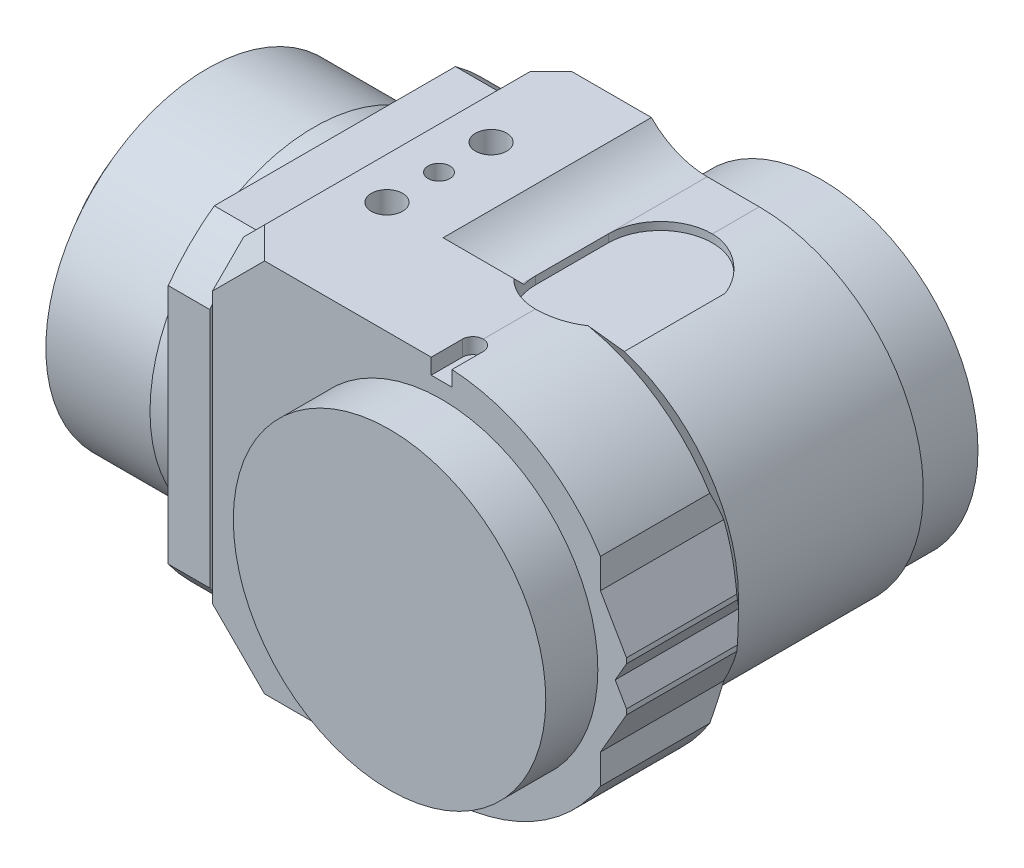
ISO-10303-21;
HEADER;
FILE_DESCRIPTION(('STEP AP214'),'2;1');
FILE_NAME('part.step','',(''),(''),'','','');
FILE_SCHEMA(('AUTOMOTIVE_DESIGN { 1 0 10303 214 1 1 1 1 }'));
ENDSEC;
DATA;
#1=APPLICATION_CONTEXT('core data for automotive mechanical design processes');
#2=APPLICATION_PROTOCOL_DEFINITION('international standard','automotive_design',2000,#1);
#3=PRODUCT_CONTEXT('',#1,'mechanical');
#4=PRODUCT('Part','Part','',(#3));
#5=PRODUCT_RELATED_PRODUCT_CATEGORY('part','',(#4));
#6=PRODUCT_DEFINITION_FORMATION('','',#4);
#7=PRODUCT_DEFINITION_CONTEXT('part definition',#1,'design');
#8=PRODUCT_DEFINITION('design','',#6,#7);
#9=PRODUCT_DEFINITION_SHAPE('','',#8);
#10=(LENGTH_UNIT() NAMED_UNIT(*) SI_UNIT(.MILLI.,.METRE.));
#11=(NAMED_UNIT(*) PLANE_ANGLE_UNIT() SI_UNIT($,.RADIAN.));
#12=(NAMED_UNIT(*) SI_UNIT($,.STERADIAN.) SOLID_ANGLE_UNIT());
#13=UNCERTAINTY_MEASURE_WITH_UNIT(LENGTH_MEASURE(1.E-05),#10,'distance_accuracy_value','');
#14=(GEOMETRIC_REPRESENTATION_CONTEXT(3) GLOBAL_UNCERTAINTY_ASSIGNED_CONTEXT((#13)) GLOBAL_UNIT_ASSIGNED_CONTEXT((#10,
#11,#12)) REPRESENTATION_CONTEXT('',''));
#15=CARTESIAN_POINT('',(0.,0.,0.));
#16=DIRECTION('',(0.,0.,1.));
#17=DIRECTION('',(1.,0.,0.));
#18=AXIS2_PLACEMENT_3D('',#15,#16,#17);
#19=CARTESIAN_POINT('',(-44.,36.,31.5));
#20=DIRECTION('',(1.,0.,0.));
#21=DIRECTION('',(0.,0.,-1.));
#22=AXIS2_PLACEMENT_3D('',#19,#20,#21);
#23=PLANE('',#22);
#24=CARTESIAN_POINT('',(-44.,0.,0.));
#25=DIRECTION('',(-1.,0.,0.));
#26=DIRECTION('',(0.,0.,1.));
#27=AXIS2_PLACEMENT_3D('',#24,#25,#26);
#28=CIRCLE('',#27,39.5);
#29=CARTESIAN_POINT('',(-44.,32.,-23.1570723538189));
#30=VERTEX_POINT('',#29);
#31=CARTESIAN_POINT('',(-44.,23.8327505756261,-31.5));
#32=VERTEX_POINT('',#31);
#33=EDGE_CURVE('E377',#30,#32,#28,.T.);
#34=ORIENTED_EDGE('',*,*,#33,.F.);
#35=DIRECTION('',(0.,0.,-1.));
#36=VECTOR('',#35,1.);
#37=CARTESIAN_POINT('',(-44.,32.,31.5));
#38=LINE('',#37,#36);
#39=CARTESIAN_POINT('',(-44.,32.,-25.5));
#40=VERTEX_POINT('',#39);
#41=EDGE_CURVE('E712',#30,#40,#38,.T.);
#42=ORIENTED_EDGE('',*,*,#41,.T.);
#43=DIRECTION('',(0.,0.707106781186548,0.707106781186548));
#44=VECTOR('',#43,1.);
#45=CARTESIAN_POINT('',(-44.,62.5,5.));
#46=LINE('',#45,#44);
#47=CARTESIAN_POINT('',(-44.,26.,-31.5));
#48=VERTEX_POINT('',#47);
#49=EDGE_CURVE('E677',#48,#40,#46,.T.);
#50=ORIENTED_EDGE('',*,*,#49,.F.);
#51=DIRECTION('',(0.,-1.,0.));
#52=VECTOR('',#51,1.);
#53=CARTESIAN_POINT('',(-44.,36.,-31.5));
#54=LINE('',#53,#52);
#55=EDGE_CURVE('E746',#48,#32,#54,.T.);
#56=ORIENTED_EDGE('',*,*,#55,.T.);
#57=EDGE_LOOP('',(#34,#42,#50,#56));
#58=FACE_BOUND('',#57,.T.);
#59=ADVANCED_FACE('F16',(#58),#23,.F.);
#60=CARTESIAN_POINT('',(-44.,0.,0.));
#61=DIRECTION('',(-1.,0.,0.));
#62=DIRECTION('',(0.,0.,1.));
#63=AXIS2_PLACEMENT_3D('',#60,#61,#62);
#64=CIRCLE('',#63,39.5);
#65=CARTESIAN_POINT('',(-44.,23.8327505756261,31.5));
#66=VERTEX_POINT('',#65);
#67=CARTESIAN_POINT('',(-44.,32.,23.1570723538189));
#68=VERTEX_POINT('',#67);
#69=EDGE_CURVE('E965',#66,#68,#64,.T.);
#70=ORIENTED_EDGE('',*,*,#69,.F.);
#71=DIRECTION('',(0.,-1.,0.));
#72=VECTOR('',#71,1.);
#73=CARTESIAN_POINT('',(-44.,36.,31.5));
#74=LINE('',#73,#72);
#75=CARTESIAN_POINT('',(-44.,26.,31.5));
#76=VERTEX_POINT('',#75);
#77=EDGE_CURVE('E752',#76,#66,#74,.T.);
#78=ORIENTED_EDGE('',*,*,#77,.F.);
#79=DIRECTION('',(0.,-0.707106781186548,0.707106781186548));
#80=VECTOR('',#79,1.);
#81=CARTESIAN_POINT('',(-44.,31.,26.5));
#82=LINE('',#81,#80);
#83=CARTESIAN_POINT('',(-44.,32.,25.5));
#84=VERTEX_POINT('',#83);
#85=EDGE_CURVE('E702',#84,#76,#82,.T.);
#86=ORIENTED_EDGE('',*,*,#85,.F.);
#87=EDGE_CURVE('E720',#84,#68,#38,.T.);
#88=ORIENTED_EDGE('',*,*,#87,.T.);
#89=EDGE_LOOP('',(#70,#78,#86,#88));
#90=FACE_BOUND('',#89,.T.);
#91=ADVANCED_FACE('F901',(#90),#23,.F.);
#92=CARTESIAN_POINT('',(-44.,0.,0.));
#93=DIRECTION('',(-1.,0.,0.));
#94=DIRECTION('',(0.,0.,1.));
#95=AXIS2_PLACEMENT_3D('',#92,#93,#94);
#96=CIRCLE('',#95,39.5);
#97=CARTESIAN_POINT('',(-44.,-32.,23.157072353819));
#98=VERTEX_POINT('',#97);
#99=CARTESIAN_POINT('',(-44.,-23.8327505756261,31.5));
#100=VERTEX_POINT('',#99);
#101=EDGE_CURVE('E922',#98,#100,#96,.T.);
#102=ORIENTED_EDGE('',*,*,#101,.F.);
#103=DIRECTION('',(0.,0.,1.));
#104=VECTOR('',#103,1.);
#105=CARTESIAN_POINT('',(-44.,-32.,31.5));
#106=LINE('',#105,#104);
#107=CARTESIAN_POINT('',(-44.,-32.,25.5));
#108=VERTEX_POINT('',#107);
#109=EDGE_CURVE('E581',#98,#108,#106,.T.);
#110=ORIENTED_EDGE('',*,*,#109,.T.);
#111=DIRECTION('',(0.,-0.707106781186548,-0.707106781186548));
#112=VECTOR('',#111,1.);
#113=CARTESIAN_POINT('',(-44.,5.,62.5));
#114=LINE('',#113,#112);
#115=CARTESIAN_POINT('',(-44.,-26.,31.5));
#116=VERTEX_POINT('',#115);
#117=EDGE_CURVE('E694',#116,#108,#114,.T.);
#118=ORIENTED_EDGE('',*,*,#117,.F.);
#119=EDGE_CURVE('E747',#100,#116,#74,.T.);
#120=ORIENTED_EDGE('',*,*,#119,.F.);
#121=EDGE_LOOP('',(#102,#110,#118,#120));
#122=FACE_BOUND('',#121,.T.);
#123=ADVANCED_FACE('F907',(#122),#23,.F.);
#124=CARTESIAN_POINT('',(-44.,0.,0.));
#125=DIRECTION('',(-1.,0.,0.));
#126=DIRECTION('',(0.,0.,1.));
#127=AXIS2_PLACEMENT_3D('',#124,#125,#126);
#128=CIRCLE('',#127,39.5);
#129=CARTESIAN_POINT('',(-44.,-23.8327505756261,-31.5));
#130=VERTEX_POINT('',#129);
#131=CARTESIAN_POINT('',(-44.,-32.,-23.157072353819));
#132=VERTEX_POINT('',#131);
#133=EDGE_CURVE('E30',#130,#132,#128,.T.);
#134=ORIENTED_EDGE('',*,*,#133,.F.);
#135=CARTESIAN_POINT('',(-44.,-26.,-31.5));
#136=VERTEX_POINT('',#135);
#137=EDGE_CURVE('E749',#130,#136,#54,.T.);
#138=ORIENTED_EDGE('',*,*,#137,.T.);
#139=DIRECTION('',(0.,0.707106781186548,-0.707106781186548));
#140=VECTOR('',#139,1.);
#141=CARTESIAN_POINT('',(-44.,-26.5,-31.));
#142=LINE('',#141,#140);
#143=CARTESIAN_POINT('',(-44.,-32.,-25.5));
#144=VERTEX_POINT('',#143);
#145=EDGE_CURVE('E688',#144,#136,#142,.T.);
#146=ORIENTED_EDGE('',*,*,#145,.F.);
#147=EDGE_CURVE('E587',#144,#132,#106,.T.);
#148=ORIENTED_EDGE('',*,*,#147,.T.);
#149=EDGE_LOOP('',(#134,#138,#146,#148));
#150=FACE_BOUND('',#149,.T.);
#151=ADVANCED_FACE('F902',(#150),#23,.F.);
#152=CARTESIAN_POINT('',(0.,0.,-29.5));
#153=DIRECTION('',(0.,0.,-1.));
#154=DIRECTION('',(-1.,0.,0.));
#155=AXIS2_PLACEMENT_3D('',#152,#153,#154);
#156=PLANE('',#155);
#157=CARTESIAN_POINT('',(-10.,46.5,-29.5));
#158=DIRECTION('',(0.,0.,-1.));
#159=DIRECTION('',(-1.,0.,0.));
#160=AXIS2_PLACEMENT_3D('',#157,#158,#159);
#161=CIRCLE('',#160,15.);
#162=CARTESIAN_POINT('',(-10.,31.5,-29.5));
#163=VERTEX_POINT('',#162);
#164=CARTESIAN_POINT('',(-20.7121426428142,36.,-29.5));
#165=VERTEX_POINT('',#164);
#166=EDGE_CURVE('E799',#163,#165,#161,.T.);
#167=ORIENTED_EDGE('',*,*,#166,.F.);
#168=DIRECTION('',(-1.,0.,0.));
#169=VECTOR('',#168,1.);
#170=CARTESIAN_POINT('',(0.,31.5,-29.5));
#171=LINE('',#170,#169);
#172=CARTESIAN_POINT('',(0.,31.5,-29.5));
#173=VERTEX_POINT('',#172);
#174=EDGE_CURVE('E801',#173,#163,#171,.T.);
#175=ORIENTED_EDGE('',*,*,#174,.F.);
#176=CARTESIAN_POINT('',(0.,0.,-29.5));
#177=DIRECTION('',(0.,0.,1.));
#178=DIRECTION('',(-1.,0.,0.));
#179=AXIS2_PLACEMENT_3D('',#176,#177,#178);
#180=CIRCLE('',#179,31.5);
#181=CARTESIAN_POINT('',(0.,-31.5,-29.5));
#182=VERTEX_POINT('',#181);
#183=EDGE_CURVE('E804',#182,#173,#180,.T.);
#184=ORIENTED_EDGE('',*,*,#183,.F.);
#185=DIRECTION('',(1.,0.,0.));
#186=VECTOR('',#185,1.);
#187=CARTESIAN_POINT('',(0.,-31.5,-29.5));
#188=LINE('',#187,#186);
#189=CARTESIAN_POINT('',(-10.,-31.5,-29.5));
#190=VERTEX_POINT('',#189);
#191=EDGE_CURVE('E807',#190,#182,#188,.T.);
#192=ORIENTED_EDGE('',*,*,#191,.F.);
#193=CARTESIAN_POINT('',(-10.,-46.5,-29.5));
#194=DIRECTION('',(0.,0.,-1.));
#195=DIRECTION('',(-1.,0.,0.));
#196=AXIS2_PLACEMENT_3D('',#193,#194,#195);
#197=CIRCLE('',#196,15.);
#198=CARTESIAN_POINT('',(-20.7121426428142,-36.,-29.5));
#199=VERTEX_POINT('',#198);
#200=EDGE_CURVE('E810',#199,#190,#197,.T.);
#201=ORIENTED_EDGE('',*,*,#200,.F.);
#202=DIRECTION('',(-1.,0.,0.));
#203=VECTOR('',#202,1.);
#204=CARTESIAN_POINT('',(-40.,-36.,-29.5));
#205=LINE('',#204,#203);
#206=CARTESIAN_POINT('',(-36.,-36.,-29.5));
#207=VERTEX_POINT('',#206);
#208=EDGE_CURVE('E766',#199,#207,#205,.T.);
#209=ORIENTED_EDGE('',*,*,#208,.T.);
#210=DIRECTION('',(0.707106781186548,-0.707106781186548,0.));
#211=VECTOR('',#210,1.);
#212=CARTESIAN_POINT('',(-45.05,-26.95,-29.5));
#213=LINE('',#212,#211);
#214=CARTESIAN_POINT('',(-40.,-32.,-29.5));
#215=VERTEX_POINT('',#214);
#216=EDGE_CURVE('E707',#215,#207,#213,.T.);
#217=ORIENTED_EDGE('',*,*,#216,.F.);
#218=DIRECTION('',(0.,1.,0.));
#219=VECTOR('',#218,1.);
#220=CARTESIAN_POINT('',(-40.,36.,-29.5));
#221=LINE('',#220,#219);
#222=CARTESIAN_POINT('',(-40.,32.,-29.5));
#223=VERTEX_POINT('',#222);
#224=EDGE_CURVE('E764',#215,#223,#221,.T.);
#225=ORIENTED_EDGE('',*,*,#224,.T.);
#226=DIRECTION('',(-0.707106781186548,-0.707106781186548,0.));
#227=VECTOR('',#226,1.);
#228=CARTESIAN_POINT('',(-34.95,37.05,-29.5));
#229=LINE('',#228,#227);
#230=CARTESIAN_POINT('',(-36.,36.,-29.5));
#231=VERTEX_POINT('',#230);
#232=EDGE_CURVE('E755',#231,#223,#229,.T.);
#233=ORIENTED_EDGE('',*,*,#232,.F.);
#234=DIRECTION('',(1.,0.,0.));
#235=VECTOR('',#234,1.);
#236=CARTESIAN_POINT('',(0.,36.,-29.5));
#237=LINE('',#236,#235);
#238=EDGE_CURVE('E759',#231,#165,#237,.T.);
#239=ORIENTED_EDGE('',*,*,#238,.T.);
#240=EDGE_LOOP('',(#167,#175,#184,#192,#201,#209,#217,#225,#233,#239));
#241=FACE_BOUND('',#240,.T.);
#242=CARTESIAN_POINT('',(0.,0.,-29.5));
#243=DIRECTION('',(0.,0.,-1.));
#244=DIRECTION('',(-1.,0.,0.));
#245=AXIS2_PLACEMENT_3D('',#242,#243,#244);
#246=CIRCLE('',#245,30.);
#247=CARTESIAN_POINT('',(-30.,0.,-29.5));
#248=VERTEX_POINT('',#247);
#249=EDGE_CURVE('E393',#248,#248,#246,.T.);
#250=ORIENTED_EDGE('',*,*,#249,.F.);
#251=EDGE_LOOP('',(#250));
#252=FACE_BOUND('',#251,.T.);
#253=ADVANCED_FACE('F909',(#241,#252),#156,.T.);
#254=CARTESIAN_POINT('',(0.,0.,31.5));
#255=DIRECTION('',(0.,0.,-1.));
#256=DIRECTION('',(-1.,0.,0.));
#257=AXIS2_PLACEMENT_3D('',#254,#255,#256);
#258=PLANE('',#257);
#259=CARTESIAN_POINT('',(0.,0.,31.5));
#260=DIRECTION('',(0.,0.,1.));
#261=DIRECTION('',(-1.,0.,0.));
#262=AXIS2_PLACEMENT_3D('',#259,#260,#261);
#263=CIRCLE('',#262,36.);
#264=CARTESIAN_POINT('',(30.5,19.1245914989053,31.5));
#265=VERTEX_POINT('',#264);
#266=CARTESIAN_POINT('',(2.,35.9444015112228,31.5));
#267=VERTEX_POINT('',#266);
#268=EDGE_CURVE('E671',#265,#267,#263,.T.);
#269=ORIENTED_EDGE('',*,*,#268,.T.);
#270=DIRECTION('',(0.,1.,0.));
#271=VECTOR('',#270,1.);
#272=CARTESIAN_POINT('',(2.,33.,31.5));
#273=LINE('',#272,#271);
#274=CARTESIAN_POINT('',(2.,33.,31.5));
#275=VERTEX_POINT('',#274);
#276=EDGE_CURVE('E643',#275,#267,#273,.T.);
#277=ORIENTED_EDGE('',*,*,#276,.F.);
#278=DIRECTION('',(1.,0.,0.));
#279=VECTOR('',#278,1.);
#280=CARTESIAN_POINT('',(-2.,33.,31.5));
#281=LINE('',#280,#279);
#282=CARTESIAN_POINT('',(-2.,33.,31.5));
#283=VERTEX_POINT('',#282);
#284=EDGE_CURVE('E634',#283,#275,#281,.T.);
#285=ORIENTED_EDGE('',*,*,#284,.F.);
#286=DIRECTION('',(0.,1.,0.));
#287=VECTOR('',#286,1.);
#288=CARTESIAN_POINT('',(-2.,33.,31.5));
#289=LINE('',#288,#287);
#290=CARTESIAN_POINT('',(-2.,36.,31.5));
#291=VERTEX_POINT('',#290);
#292=EDGE_CURVE('E645',#283,#291,#289,.T.);
#293=ORIENTED_EDGE('',*,*,#292,.T.);
#294=DIRECTION('',(-1.,0.,0.));
#295=VECTOR('',#294,1.);
#296=CARTESIAN_POINT('',(-44.,36.,31.5));
#297=LINE('',#296,#295);
#298=CARTESIAN_POINT('',(-34.,36.,31.5));
#299=VERTEX_POINT('',#298);
#300=EDGE_CURVE('E659',#291,#299,#297,.T.);
#301=ORIENTED_EDGE('',*,*,#300,.T.);
#302=DIRECTION('',(0.707106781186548,0.707106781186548,0.));
#303=VECTOR('',#302,1.);
#304=CARTESIAN_POINT('',(-35.,35.,31.5));
#305=LINE('',#304,#303);
#306=EDGE_CURVE('E705',#76,#299,#305,.T.);
#307=ORIENTED_EDGE('',*,*,#306,.F.);
#308=ORIENTED_EDGE('',*,*,#77,.T.);
#309=EDGE_CURVE('E750',#66,#100,#74,.T.);
#310=ORIENTED_EDGE('',*,*,#309,.T.);
#311=ORIENTED_EDGE('',*,*,#119,.T.);
#312=DIRECTION('',(-0.707106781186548,0.707106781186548,0.));
#313=VECTOR('',#312,1.);
#314=CARTESIAN_POINT('',(-35.,-35.,31.5));
#315=LINE('',#314,#313);
#316=CARTESIAN_POINT('',(-34.,-36.,31.5));
#317=VERTEX_POINT('',#316);
#318=EDGE_CURVE('E699',#317,#116,#315,.T.);
#319=ORIENTED_EDGE('',*,*,#318,.F.);
#320=DIRECTION('',(1.,0.,0.));
#321=VECTOR('',#320,1.);
#322=CARTESIAN_POINT('',(-44.,-36.,31.5));
#323=LINE('',#322,#321);
#324=CARTESIAN_POINT('',(0.,-36.,31.5));
#325=VERTEX_POINT('',#324);
#326=EDGE_CURVE('E1194',#317,#325,#323,.T.);
#327=ORIENTED_EDGE('',*,*,#326,.T.);
#328=CARTESIAN_POINT('',(30.5,-19.1245914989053,31.5));
#329=VERTEX_POINT('',#328);
#330=EDGE_CURVE('E666',#325,#329,#263,.T.);
#331=ORIENTED_EDGE('',*,*,#330,.T.);
#332=DIRECTION('',(0.,1.,0.));
#333=VECTOR('',#332,1.);
#334=CARTESIAN_POINT('',(30.5,0.,31.5));
#335=LINE('',#334,#333);
#336=CARTESIAN_POINT('',(30.5,-13.4102540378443,31.5));
#337=VERTEX_POINT('',#336);
#338=EDGE_CURVE('E819',#329,#337,#335,.T.);
#339=ORIENTED_EDGE('',*,*,#338,.T.);
#340=DIRECTION('',(0.5,0.866025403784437,0.));
#341=VECTOR('',#340,1.);
#342=CARTESIAN_POINT('',(28.681810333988,-16.5594509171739,31.5));
#343=LINE('',#342,#341);
#344=CARTESIAN_POINT('',(35.5,-4.75,31.5));
#345=VERTEX_POINT('',#344);
#346=EDGE_CURVE('E822',#337,#345,#343,.T.);
#347=ORIENTED_EDGE('',*,*,#346,.T.);
#348=DIRECTION('',(0.,1.,0.));
#349=VECTOR('',#348,1.);
#350=CARTESIAN_POINT('',(35.5,0.,31.5));
#351=LINE('',#350,#349);
#352=CARTESIAN_POINT('',(35.5,-3.75,31.5));
#353=VERTEX_POINT('',#352);
#354=EDGE_CURVE('E825',#345,#353,#351,.T.);
#355=ORIENTED_EDGE('',*,*,#354,.T.);
#356=DIRECTION('',(-0.5,0.866025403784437,0.));
#357=VECTOR('',#356,1.);
#358=CARTESIAN_POINT('',(25.0012023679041,14.4344509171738,31.5));
#359=LINE('',#358,#357);
#360=CARTESIAN_POINT('',(33.3349364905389,0.,31.5));
#361=VERTEX_POINT('',#360);
#362=EDGE_CURVE('E828',#353,#361,#359,.T.);
#363=ORIENTED_EDGE('',*,*,#362,.T.);
#364=DIRECTION('',(0.5,0.866025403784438,0.));
#365=VECTOR('',#364,1.);
#366=CARTESIAN_POINT('',(25.0012023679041,-14.4344509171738,31.5));
#367=LINE('',#366,#365);
#368=CARTESIAN_POINT('',(35.5,3.75,31.5));
#369=VERTEX_POINT('',#368);
#370=EDGE_CURVE('E831',#361,#369,#367,.T.);
#371=ORIENTED_EDGE('',*,*,#370,.T.);
#372=DIRECTION('',(0.,1.,0.));
#373=VECTOR('',#372,1.);
#374=CARTESIAN_POINT('',(35.5,-2.4980018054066E-13,31.5));
#375=LINE('',#374,#373);
#376=CARTESIAN_POINT('',(35.5,4.75,31.5));
#377=VERTEX_POINT('',#376);
#378=EDGE_CURVE('E834',#369,#377,#375,.T.);
#379=ORIENTED_EDGE('',*,*,#378,.T.);
#380=DIRECTION('',(-0.5,0.866025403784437,0.));
#381=VECTOR('',#380,1.);
#382=CARTESIAN_POINT('',(28.681810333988,16.5594509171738,31.5));
#383=LINE('',#382,#381);
#384=CARTESIAN_POINT('',(30.5,13.4102540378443,31.5));
#385=VERTEX_POINT('',#384);
#386=EDGE_CURVE('E813',#377,#385,#383,.T.);
#387=ORIENTED_EDGE('',*,*,#386,.T.);
#388=DIRECTION('',(0.,1.,0.));
#389=VECTOR('',#388,1.);
#390=CARTESIAN_POINT('',(30.5,0.,31.5));
#391=LINE('',#390,#389);
#392=EDGE_CURVE('E816',#385,#265,#391,.T.);
#393=ORIENTED_EDGE('',*,*,#392,.T.);
#394=EDGE_LOOP('',(#269,#277,#285,#293,#301,#307,#308,#310,#311,#319,#327,#331,#339,#347,#355,
#363,#371,#379,#387,#393));
#395=FACE_BOUND('',#394,.T.);
#396=CARTESIAN_POINT('',(0.,0.,31.5));
#397=DIRECTION('',(0.,0.,-1.));
#398=DIRECTION('',(-1.,0.,0.));
#399=AXIS2_PLACEMENT_3D('',#396,#397,#398);
#400=CIRCLE('',#399,30.);
#401=CARTESIAN_POINT('',(-30.,0.,31.5));
#402=VERTEX_POINT('',#401);
#403=EDGE_CURVE('E589',#402,#402,#400,.F.);
#404=ORIENTED_EDGE('',*,*,#403,.F.);
#405=EDGE_LOOP('',(#404));
#406=FACE_BOUND('',#405,.T.);
#407=ADVANCED_FACE('F915',(#395,#406),#258,.F.);
#408=CARTESIAN_POINT('',(0.,31.5,6.));
#409=DIRECTION('',(0.,-1.,0.));
#410=DIRECTION('',(0.,0.,-1.));
#411=AXIS2_PLACEMENT_3D('',#408,#409,#410);
#412=PLANE('',#411);
#413=DIRECTION('',(-1.,0.,0.));
#414=VECTOR('',#413,1.);
#415=CARTESIAN_POINT('',(0.,31.5,6.));
#416=LINE('',#415,#414);
#417=CARTESIAN_POINT('',(-9.68245836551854,31.5,6.));
#418=VERTEX_POINT('',#417);
#419=CARTESIAN_POINT('',(-10.,31.5,6.));
#420=VERTEX_POINT('',#419);
#421=EDGE_CURVE('E794',#418,#420,#416,.T.);
#422=ORIENTED_EDGE('',*,*,#421,.F.);
#423=CARTESIAN_POINT('',(0.,31.5,3.5));
#424=DIRECTION('',(0.,-1.,0.));
#425=DIRECTION('',(0.,0.,-1.));
#426=AXIS2_PLACEMENT_3D('',#423,#424,#425);
#427=CIRCLE('',#426,10.);
#428=CARTESIAN_POINT('',(-10.,31.5,3.5));
#429=VERTEX_POINT('',#428);
#430=EDGE_CURVE('E422',#418,#429,#427,.T.);
#431=ORIENTED_EDGE('',*,*,#430,.T.);
#432=DIRECTION('',(0.,0.,-1.));
#433=VECTOR('',#432,1.);
#434=CARTESIAN_POINT('',(-10.,31.5,6.));
#435=LINE('',#434,#433);
#436=EDGE_CURVE('E788',#420,#429,#435,.T.);
#437=ORIENTED_EDGE('',*,*,#436,.F.);
#438=EDGE_LOOP('',(#422,#431,#437));
#439=FACE_BOUND('',#438,.T.);
#440=ADVANCED_FACE('F1121',(#439),#412,.F.);
#441=CARTESIAN_POINT('',(-10.,-46.5,6.));
#442=DIRECTION('',(0.,0.,-1.));
#443=DIRECTION('',(-1.,0.,0.));
#444=AXIS2_PLACEMENT_3D('',#441,#442,#443);
#445=CYLINDRICAL_SURFACE('',#444,15.);
#446=DIRECTION('',(0.,0.,-1.));
#447=VECTOR('',#446,1.);
#448=CARTESIAN_POINT('',(-10.,-31.5,6.));
#449=LINE('',#448,#447);
#450=CARTESIAN_POINT('',(-10.,-31.5,-10.));
#451=VERTEX_POINT('',#450);
#452=CARTESIAN_POINT('',(-10.,-31.5,-10.5));
#453=VERTEX_POINT('',#452);
#454=EDGE_CURVE('E782',#451,#453,#449,.T.);
#455=ORIENTED_EDGE('',*,*,#454,.F.);
#456=CARTESIAN_POINT('',(-10.,-46.5,-10.));
#457=DIRECTION('',(0.,0.,-1.));
#458=DIRECTION('',(-1.,0.,0.));
#459=AXIS2_PLACEMENT_3D('',#456,#457,#458);
#460=CIRCLE('',#459,15.);
#461=CARTESIAN_POINT('',(-15.,-32.357864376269,-10.));
#462=VERTEX_POINT('',#461);
#463=EDGE_CURVE('E1040',#451,#462,#460,.F.);
#464=ORIENTED_EDGE('',*,*,#463,.T.);
#465=CARTESIAN_POINT('',(-10.,-31.5,-8.66025403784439));
#466=CARTESIAN_POINT('',(-10.2108021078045,-31.4999661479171,-8.78200831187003));
#467=CARTESIAN_POINT('',(-10.4261180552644,-31.5044424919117,-8.89601082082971));
#468=CARTESIAN_POINT('',(-10.8641603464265,-31.5233173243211,-9.10789846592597));
#469=CARTESIAN_POINT('',(-11.0868879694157,-31.5377175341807,-9.20578080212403));
#470=CARTESIAN_POINT('',(-11.5375925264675,-31.5773012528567,-9.38458530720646));
#471=CARTESIAN_POINT('',(-11.7655575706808,-31.6024622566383,-9.46554235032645));
#472=CARTESIAN_POINT('',(-12.2253153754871,-31.6641737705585,-9.61036895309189));
#473=CARTESIAN_POINT('',(-12.4571077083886,-31.7007230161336,-9.67424040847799));
#474=CARTESIAN_POINT('',(-12.923037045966,-31.7856522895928,-9.78486896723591));
#475=CARTESIAN_POINT('',(-13.157177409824,-31.8340526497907,-9.83159630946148));
#476=CARTESIAN_POINT('',(-13.6254906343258,-31.9427474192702,-9.90792686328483));
#477=CARTESIAN_POINT('',(-13.8596634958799,-32.0030422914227,-9.93752940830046));
#478=CARTESIAN_POINT('',(-14.3259831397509,-32.1353016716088,-9.98000361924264));
#479=CARTESIAN_POINT('',(-14.5581315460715,-32.2072556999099,-9.99289021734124));
#480=CARTESIAN_POINT('',(-15.0189354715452,-32.3624824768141,-10.0026374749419));
#481=CARTESIAN_POINT('',(-15.2475910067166,-32.4457551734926,-9.99949820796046));
#482=CARTESIAN_POINT('',(-15.7008430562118,-32.6234053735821,-9.9780009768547));
#483=CARTESIAN_POINT('',(-15.9254199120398,-32.717825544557,-9.95958279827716));
#484=CARTESIAN_POINT('',(-16.3683464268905,-32.9168074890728,-9.90844770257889));
#485=CARTESIAN_POINT('',(-16.58669598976,-33.0213694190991,-9.87573056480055));
#486=CARTESIAN_POINT('',(-17.0167489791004,-33.2401510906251,-9.7969709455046));
#487=CARTESIAN_POINT('',(-17.2284334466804,-33.3543954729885,-9.75089369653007));
#488=CARTESIAN_POINT('',(-17.6438305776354,-33.5915115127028,-9.64655570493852));
#489=CARTESIAN_POINT('',(-17.8475419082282,-33.7143846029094,-9.58829293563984));
#490=CARTESIAN_POINT('',(-18.2981192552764,-34.0008103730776,-9.44414753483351));
#491=CARTESIAN_POINT('',(-18.5424943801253,-34.166655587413,-9.35501979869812));
#492=CARTESIAN_POINT('',(-19.0171291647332,-34.5092900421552,-9.16124580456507));
#493=CARTESIAN_POINT('',(-19.2473818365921,-34.6860846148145,-9.05659195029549));
#494=CARTESIAN_POINT('',(-19.6918173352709,-35.0479157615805,-8.83448741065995));
#495=CARTESIAN_POINT('',(-19.9060987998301,-35.2328881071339,-8.71712859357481));
#496=CARTESIAN_POINT('',(-20.3200208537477,-35.6107565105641,-8.47084618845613));
#497=CARTESIAN_POINT('',(-20.5196788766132,-35.8036426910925,-8.34193679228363));
#498=CARTESIAN_POINT('',(-20.7121426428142,-36.,-8.20800989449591));
#499=B_SPLINE_CURVE_WITH_KNOTS('',3,(#465,#466,#467,#468,#469,#470,#471,#472,#473,#474,#475,
#476,#477,#478,#479,#480,#481,#482,#483,#484,#485,#486,#487,#488,#489,#490,#491,#492,#493,#494,
#495,#496,#497,#498),.UNSPECIFIED.,.F.,.F.,(4,2,2,2,2,2,2,2,2,2,2,2,2,2,2,2,4),(0.,
0.730154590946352,1.46043587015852,2.18919725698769,2.91787775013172,3.6478172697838,
4.37778520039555,5.10710060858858,5.83641267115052,6.5686126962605,7.30082402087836,
8.03495817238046,8.76921452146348,9.69367617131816,10.6185916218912,11.5372169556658,
12.454728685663),.UNSPECIFIED.);
#500=CARTESIAN_POINT('',(-20.7121426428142,-36.,-8.20800989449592));
#501=VERTEX_POINT('',#500);
#502=EDGE_CURVE('E1867',#462,#501,#499,.T.);
#503=ORIENTED_EDGE('',*,*,#502,.T.);
#504=DIRECTION('',(0.,0.,-1.));
#505=VECTOR('',#504,1.);
#506=CARTESIAN_POINT('',(-20.7121426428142,-36.,6.));
#507=LINE('',#506,#505);
#508=EDGE_CURVE('E780',#501,#199,#507,.T.);
#509=ORIENTED_EDGE('',*,*,#508,.T.);
#510=ORIENTED_EDGE('',*,*,#200,.T.);
#511=EDGE_CURVE('E779',#453,#190,#449,.T.);
#512=ORIENTED_EDGE('',*,*,#511,.F.);
#513=EDGE_LOOP('',(#455,#464,#503,#509,#510,#512));
#514=FACE_BOUND('',#513,.T.);
#515=ADVANCED_FACE('F1111',(#514),#445,.F.);
#516=CARTESIAN_POINT('',(0.,0.,31.5));
#517=DIRECTION('',(0.,0.,-1.));
#518=DIRECTION('',(-1.,0.,0.));
#519=AXIS2_PLACEMENT_3D('',#516,#517,#518);
#520=CYLINDRICAL_SURFACE('',#519,36.);
#521=CARTESIAN_POINT('',(0.,0.,10.5));
#522=DIRECTION('',(0.,0.,-1.));
#523=DIRECTION('',(-1.,0.,0.));
#524=AXIS2_PLACEMENT_3D('',#521,#522,#523);
#525=CIRCLE('',#524,36.);
#526=CARTESIAN_POINT('',(30.5,19.1245914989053,10.5));
#527=VERTEX_POINT('',#526);
#528=CARTESIAN_POINT('',(7.14142842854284,35.2845575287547,10.5));
#529=VERTEX_POINT('',#528);
#530=EDGE_CURVE('E1054',#527,#529,#525,.F.);
#531=ORIENTED_EDGE('',*,*,#530,.T.);
#532=CARTESIAN_POINT('',(0.,36.,13.5));
#533=CARTESIAN_POINT('',(-0.275221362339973,35.9999994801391,13.4999991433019));
#534=CARTESIAN_POINT('',(-0.550458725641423,35.9968362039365,13.4886285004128));
#535=CARTESIAN_POINT('',(-1.09892773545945,35.9842691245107,13.4432435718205));
#536=CARTESIAN_POINT('',(-1.37215922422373,35.9748648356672,13.4092275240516));
#537=CARTESIAN_POINT('',(-1.9147201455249,35.9500712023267,13.3188343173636));
#538=CARTESIAN_POINT('',(-2.18404817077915,35.9346797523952,13.26244929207));
#539=CARTESIAN_POINT('',(-2.7167958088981,35.898333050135,13.1277989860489));
#540=CARTESIAN_POINT('',(-2.98021527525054,35.8773776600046,13.0495331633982));
#541=CARTESIAN_POINT('',(-3.49896271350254,35.8305037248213,12.8718899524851));
#542=CARTESIAN_POINT('',(-3.75430145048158,35.8045921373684,12.7725421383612));
#543=CARTESIAN_POINT('',(-4.25557652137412,35.7484780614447,12.5534463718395));
#544=CARTESIAN_POINT('',(-4.50151282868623,35.7182755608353,12.4336983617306));
#545=CARTESIAN_POINT('',(-4.9823759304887,35.6543792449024,12.1747045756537));
#546=CARTESIAN_POINT('',(-5.21730405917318,35.6206858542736,12.0354611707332));
#547=CARTESIAN_POINT('',(-5.67480165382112,35.5506709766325,11.7383885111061));
#548=CARTESIAN_POINT('',(-5.8973666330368,35.5143485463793,11.5805525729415));
#549=CARTESIAN_POINT('',(-6.3334541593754,35.4392070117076,11.2437028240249));
#550=CARTESIAN_POINT('',(-6.54666862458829,35.4003504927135,11.0642984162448));
#551=CARTESIAN_POINT('',(-6.95741523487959,35.3219212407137,10.6883189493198));
#552=CARTESIAN_POINT('',(-7.15494017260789,35.2823481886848,10.4917360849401));
#553=CARTESIAN_POINT('',(-7.53296379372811,35.2035757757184,10.0827059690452));
#554=CARTESIAN_POINT('',(-7.71346006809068,35.1643764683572,9.87025648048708));
#555=CARTESIAN_POINT('',(-8.05612888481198,35.0874567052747,9.43096558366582));
#556=CARTESIAN_POINT('',(-8.21830962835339,35.0497355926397,9.20413068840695));
#557=CARTESIAN_POINT('',(-8.52628037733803,34.9761076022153,8.73290430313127));
#558=CARTESIAN_POINT('',(-8.67169289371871,34.9402498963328,8.48825817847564));
#559=CARTESIAN_POINT('',(-8.94127159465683,34.8722381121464,7.98715642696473));
#560=CARTESIAN_POINT('',(-9.06544612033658,34.8400825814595,7.73070548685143));
#561=CARTESIAN_POINT('',(-9.2916315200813,34.7804438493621,7.2076633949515));
#562=CARTESIAN_POINT('',(-9.39364134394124,34.7529608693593,6.94107176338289));
#563=CARTESIAN_POINT('',(-9.57461847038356,34.7035371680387,6.39967895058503));
#564=CARTESIAN_POINT('',(-9.65358646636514,34.6815962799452,6.12487801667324));
#565=CARTESIAN_POINT('',(-9.78613764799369,34.6444242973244,5.57588518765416));
#566=CARTESIAN_POINT('',(-9.84029205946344,34.6290428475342,5.30184135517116));
#567=CARTESIAN_POINT('',(-9.92550820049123,34.604714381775,4.74990242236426));
#568=CARTESIAN_POINT('',(-9.95657027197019,34.595767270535,4.47200737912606));
#569=CARTESIAN_POINT('',(-9.99531131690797,34.584594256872,3.91450661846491));
#570=CARTESIAN_POINT('',(-10.0029944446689,34.5823671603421,3.63490121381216));
#571=CARTESIAN_POINT('',(-9.99491686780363,34.5847026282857,3.07606048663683));
#572=CARTESIAN_POINT('',(-9.97915658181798,34.589265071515,2.79682515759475));
#573=CARTESIAN_POINT('',(-9.92517917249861,34.604791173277,2.24933492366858));
#574=CARTESIAN_POINT('',(-9.88766204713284,34.6155552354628,1.98100497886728));
#575=CARTESIAN_POINT('',(-9.79105944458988,34.643003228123,1.44857201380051));
#576=CARTESIAN_POINT('',(-9.73197447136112,34.6596870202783,1.18446889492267));
#577=CARTESIAN_POINT('',(-9.59273653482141,34.6984815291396,0.662323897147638));
#578=CARTESIAN_POINT('',(-9.51258610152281,34.7205915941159,0.404281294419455));
#579=CARTESIAN_POINT('',(-9.33181746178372,34.7696124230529,-0.104165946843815));
#580=CARTESIAN_POINT('',(-9.23119154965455,34.7965249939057,-0.354567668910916));
#581=CARTESIAN_POINT('',(-9.008936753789,34.8547328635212,-0.848951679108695));
#582=CARTESIAN_POINT('',(-8.88707305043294,34.8860763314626,-1.09282269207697));
#583=CARTESIAN_POINT('',(-8.62406244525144,34.9520231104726,-1.56948208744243));
#584=CARTESIAN_POINT('',(-8.48291457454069,34.9866265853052,-1.80226991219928));
#585=CARTESIAN_POINT('',(-8.18228300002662,35.0581533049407,-2.25536047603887));
#586=CARTESIAN_POINT('',(-8.02279647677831,35.0950769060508,-2.47566128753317));
#587=CARTESIAN_POINT('',(-7.68654104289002,35.1702539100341,-2.90241266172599));
#588=CARTESIAN_POINT('',(-7.50977174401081,35.2085073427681,-3.1088629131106));
#589=CARTESIAN_POINT('',(-7.13347197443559,35.2867085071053,-3.51374720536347));
#590=CARTESIAN_POINT('',(-6.93335545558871,35.3266680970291,-3.71163471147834));
#591=CARTESIAN_POINT('',(-6.51708240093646,35.4058260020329,-4.08990985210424));
#592=CARTESIAN_POINT('',(-6.30092609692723,35.4450243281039,-4.27029773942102));
#593=CARTESIAN_POINT('',(-5.8539059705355,35.5215879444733,-4.61239905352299));
#594=CARTESIAN_POINT('',(-5.62303823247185,35.5589527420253,-4.77410747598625));
#595=CARTESIAN_POINT('',(-5.1482460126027,35.6307897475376,-5.07758192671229));
#596=CARTESIAN_POINT('',(-4.90432667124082,35.6652630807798,-5.21935572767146));
#597=CARTESIAN_POINT('',(-4.40365305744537,35.7305457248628,-5.48266437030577));
#598=CARTESIAN_POINT('',(-4.14683784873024,35.7613347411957,-5.60408846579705));
#599=CARTESIAN_POINT('',(-3.6233511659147,35.8181606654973,-5.82480631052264));
#600=CARTESIAN_POINT('',(-3.35667961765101,35.8441975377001,-5.92409989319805));
#601=CARTESIAN_POINT('',(-2.81545503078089,35.8907643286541,-6.09969452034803));
#602=CARTESIAN_POINT('',(-2.54090352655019,35.9112953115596,-6.17600000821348));
#603=CARTESIAN_POINT('',(-1.98592144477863,35.946257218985,-6.30496135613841));
#604=CARTESIAN_POINT('',(-1.70549104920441,35.9606883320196,-6.35761794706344));
#605=CARTESIAN_POINT('',(-1.14970581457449,35.9826777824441,-6.43753119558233));
#606=CARTESIAN_POINT('',(-0.87446515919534,35.9904362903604,-6.46552828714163));
#607=CARTESIAN_POINT('',(-0.322507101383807,35.999613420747,-6.4986210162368));
#608=CARTESIAN_POINT('',(-0.0457897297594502,36.0010321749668,-6.50371712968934));
#609=CARTESIAN_POINT('',(0.507044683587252,35.9974903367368,-6.49096325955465));
#610=CARTESIAN_POINT('',(0.783161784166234,35.9925304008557,-6.47311563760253));
#611=CARTESIAN_POINT('',(1.33278623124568,35.976370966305,-6.4146384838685));
#612=CARTESIAN_POINT('',(1.60629359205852,35.9651715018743,-6.37400907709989));
#613=CARTESIAN_POINT('',(2.14352186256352,35.9371157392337,-6.27131890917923));
#614=CARTESIAN_POINT('',(2.40732991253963,35.9203715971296,-6.20968240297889));
#615=CARTESIAN_POINT('',(2.92881328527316,35.8816170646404,-6.06531632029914));
#616=CARTESIAN_POINT('',(3.18648636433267,35.8596047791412,-5.98257915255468));
#617=CARTESIAN_POINT('',(3.69386135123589,35.8108969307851,-5.79668641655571));
#618=CARTESIAN_POINT('',(3.943564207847,35.7842019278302,-5.6935332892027));
#619=CARTESIAN_POINT('',(4.43344219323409,35.726816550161,-5.46757250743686));
#620=CARTESIAN_POINT('',(4.67361688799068,35.6961259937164,-5.34476395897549));
#621=CARTESIAN_POINT('',(5.14781609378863,35.630863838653,-5.0776206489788));
#622=CARTESIAN_POINT('',(5.38160938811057,35.5962248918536,-4.93289190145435));
#623=CARTESIAN_POINT('',(5.83624645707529,35.5245154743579,-4.62487697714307));
#624=CARTESIAN_POINT('',(6.0570897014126,35.4874449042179,-4.46159004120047));
#625=CARTESIAN_POINT('',(6.48449323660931,35.4118406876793,-4.11752089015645));
#626=CARTESIAN_POINT('',(6.69105104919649,35.373306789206,-3.93673565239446));
#627=CARTESIAN_POINT('',(7.08857195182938,35.2957952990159,-3.55884953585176));
#628=CARTESIAN_POINT('',(7.27953480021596,35.2568177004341,-3.36174840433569));
#629=CARTESIAN_POINT('',(7.65034975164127,35.1782487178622,-2.94609212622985));
#630=CARTESIAN_POINT('',(7.82967236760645,35.1386758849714,-2.72706070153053));
#631=CARTESIAN_POINT('',(8.16916727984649,35.0613036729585,-2.27448627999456));
#632=CARTESIAN_POINT('',(8.32934795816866,35.0235035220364,-2.04094970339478));
#633=CARTESIAN_POINT('',(8.62956876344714,34.9507427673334,-1.56070788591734));
#634=CARTESIAN_POINT('',(8.76960053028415,34.9157833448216,-1.31399723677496));
#635=CARTESIAN_POINT('',(9.02832959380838,34.8497789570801,-0.809252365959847));
#636=CARTESIAN_POINT('',(9.14703559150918,34.8187323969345,-0.551222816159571));
#637=CARTESIAN_POINT('',(9.36164398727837,34.7616440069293,-0.0269552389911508));
#638=CARTESIAN_POINT('',(9.45766629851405,34.7355760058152,0.239230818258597));
#639=CARTESIAN_POINT('',(9.62691626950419,34.6890500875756,0.779238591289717));
#640=CARTESIAN_POINT('',(9.70014394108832,34.6685921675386,1.05306030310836));
#641=CARTESIAN_POINT('',(9.823134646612,34.6339445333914,1.60624929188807));
#642=CARTESIAN_POINT('',(9.8729032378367,34.6197533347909,1.8856152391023));
#643=CARTESIAN_POINT('',(9.94853550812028,34.5980952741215,2.44782029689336));
#644=CARTESIAN_POINT('',(9.97439993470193,34.5906282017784,2.73065929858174));
#645=CARTESIAN_POINT('',(10.0014871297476,34.5828055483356,3.2874863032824));
#646=CARTESIAN_POINT('',(10.0035561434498,34.5822057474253,3.56143005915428));
#647=CARTESIAN_POINT('',(9.98522066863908,34.5875043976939,4.10849647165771));
#648=CARTESIAN_POINT('',(9.96481674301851,34.5934026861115,4.38161914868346));
#649=CARTESIAN_POINT('',(9.90171964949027,34.6115157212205,4.9250519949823));
#650=CARTESIAN_POINT('',(9.85902728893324,34.62373023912,5.19536226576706));
#651=CARTESIAN_POINT('',(9.75172680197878,34.6541040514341,5.73125510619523));
#652=CARTESIAN_POINT('',(9.68711856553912,34.6722633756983,5.99683765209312));
#653=CARTESIAN_POINT('',(9.53723414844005,34.7137889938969,6.51898224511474));
#654=CARTESIAN_POINT('',(9.45215644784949,34.7371051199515,6.77560533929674));
#655=CARTESIAN_POINT('',(9.26166196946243,34.7883794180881,7.28081019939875));
#656=CARTESIAN_POINT('',(9.15623788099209,34.8163392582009,7.52938903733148));
#657=CARTESIAN_POINT('',(8.92586227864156,34.87611122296,8.01681794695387));
#658=CARTESIAN_POINT('',(8.80091211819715,34.9079230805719,8.25566869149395));
#659=CARTESIAN_POINT('',(8.5323492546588,34.9745357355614,8.72220934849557));
#660=CARTESIAN_POINT('',(8.38873553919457,35.0093366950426,8.94989865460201));
#661=CARTESIAN_POINT('',(8.07895984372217,35.0821394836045,9.39977452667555));
#662=CARTESIAN_POINT('',(7.91222719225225,35.1202078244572,9.62155754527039));
#663=CARTESIAN_POINT('',(7.56102788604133,35.1974882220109,10.050394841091));
#664=CARTESIAN_POINT('',(7.37656089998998,35.2367003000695,10.2574488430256));
#665=CARTESIAN_POINT('',(6.99103573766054,35.3152108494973,10.6555726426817));
#666=CARTESIAN_POINT('',(6.78997345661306,35.3545093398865,10.8466384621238));
#667=CARTESIAN_POINT('',(6.37257291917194,35.4321233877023,11.2114946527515));
#668=CARTESIAN_POINT('',(6.15623496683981,35.470438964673,11.3852853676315));
#669=CARTESIAN_POINT('',(5.70425609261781,35.5459590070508,11.7184035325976));
#670=CARTESIAN_POINT('',(5.46827588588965,35.5831145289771,11.8772821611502));
#671=CARTESIAN_POINT('',(4.9833748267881,35.6542562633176,12.1744918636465));
#672=CARTESIAN_POINT('',(4.73445874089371,35.6882436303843,12.3128304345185));
#673=CARTESIAN_POINT('',(4.22538678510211,35.7520892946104,12.5679181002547));
#674=CARTESIAN_POINT('',(3.96523444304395,35.7819488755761,12.6846739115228));
#675=CARTESIAN_POINT('',(3.43546897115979,35.8366910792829,12.8956810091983));
#676=CARTESIAN_POINT('',(3.16585700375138,35.8615743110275,12.9899350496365));
#677=CARTESIAN_POINT('',(2.65889409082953,35.9024407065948,13.1431250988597));
#678=CARTESIAN_POINT('',(2.42254876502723,35.9191917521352,13.205203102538));
#679=CARTESIAN_POINT('',(1.94560632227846,35.9481806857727,13.3119488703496));
#680=CARTESIAN_POINT('',(1.70500805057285,35.960417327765,13.3566118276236));
#681=CARTESIAN_POINT('',(1.22101454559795,35.9801024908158,13.4281902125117));
#682=CARTESIAN_POINT('',(0.977619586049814,35.987551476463,13.4551073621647));
#683=CARTESIAN_POINT('',(0.489487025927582,35.9974997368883,13.4910100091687));
#684=CARTESIAN_POINT('',(0.244749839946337,36.0000004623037,13.5000007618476));
#685=CARTESIAN_POINT('',(0.,36.,13.5));
#686=B_SPLINE_CURVE_WITH_KNOTS('',3,(#532,#533,#534,#535,#536,#537,#538,#539,#540,#541,#542,
#543,#544,#545,#546,#547,#548,#549,#550,#551,#552,#553,#554,#555,#556,#557,#558,#559,#560,#561,
#562,#563,#564,#565,#566,#567,#568,#569,#570,#571,#572,#573,#574,#575,#576,#577,#578,#579,#580,
#581,#582,#583,#584,#585,#586,#587,#588,#589,#590,#591,#592,#593,#594,#595,#596,#597,#598,#599,
#600,#601,#602,#603,#604,#605,#606,#607,#608,#609,#610,#611,#612,#613,#614,#615,#616,#617,#618,
#619,#620,#621,#622,#623,#624,#625,#626,#627,#628,#629,#630,#631,#632,#633,#634,#635,#636,#637,
#638,#639,#640,#641,#642,#643,#644,#645,#646,#647,#648,#649,#650,#651,#652,#653,#654,#655,#656,
#657,#658,#659,#660,#661,#662,#663,#664,#665,#666,#667,#668,#669,#670,#671,#672,#673,#674,#675,
#676,#677,#678,#679,#680,#681,#682,#683,#684,#685),.UNSPECIFIED.,.T.,.F.,(4,2,2,2,2,2,2,2,2,2,2,
2,2,2,2,2,2,2,2,2,2,2,2,2,2,2,2,2,2,2,2,2,2,2,2,2,2,2,2,2,2,2,2,2,2,2,2,2,2,2,2,2,2,2,2,2,2,2,2,
2,2,2,2,2,2,2,2,2,2,2,2,2,2,2,2,2,4),(0.,0.825439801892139,1.65094383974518,2.47673843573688,
3.30255348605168,4.12721763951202,4.95188412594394,5.77645040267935,6.6013139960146,
7.44438702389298,8.28784512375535,9.13142236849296,9.97462037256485,10.8341195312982,
11.6932803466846,12.5524818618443,13.4116575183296,14.2499151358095,15.0881603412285,
15.9262565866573,16.7643378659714,17.5768432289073,18.3893296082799,19.2017184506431,
20.0144135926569,20.8367419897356,21.6591117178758,22.4816080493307,23.3041228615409,
24.1559014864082,25.0076678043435,25.8596617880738,26.7113226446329,27.5674776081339,
28.42363901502,29.2796348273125,30.1356041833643,30.9648977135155,31.794174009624,
32.6233649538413,33.4525513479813,34.2658968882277,35.079535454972,35.8930768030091,
36.7066551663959,37.5371248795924,38.3676285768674,39.1982759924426,40.0289362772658,
40.8854026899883,41.7414926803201,42.5979368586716,43.4540308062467,44.3054924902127,
45.1569537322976,46.0082131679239,46.8594459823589,47.6803083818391,48.501150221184,
49.3219623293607,50.1427785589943,50.9559356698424,51.7693855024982,52.5827789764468,
53.3962165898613,54.2354527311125,55.0747045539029,55.9141645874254,56.753607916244,
57.6132567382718,58.4725910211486,59.3316574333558,60.1906186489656,60.9247527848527,
61.6590894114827,62.393354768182,63.1274048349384),.UNSPECIFIED.);
#687=CARTESIAN_POINT('',(0.,36.,13.5));
#688=VERTEX_POINT('',#687);
#689=EDGE_CURVE('E434',#529,#688,#686,.T.);
#690=ORIENTED_EDGE('',*,*,#689,.T.);
#691=DIRECTION('',(0.,0.,-1.));
#692=VECTOR('',#691,1.);
#693=CARTESIAN_POINT('',(0.,36.,31.5));
#694=LINE('',#693,#692);
#695=CARTESIAN_POINT('',(0.,36.,23.5));
#696=VERTEX_POINT('',#695);
#697=EDGE_CURVE('E665',#696,#688,#694,.T.);
#698=ORIENTED_EDGE('',*,*,#697,.F.);
#699=CARTESIAN_POINT('',(0.,36.,23.5));
#700=CARTESIAN_POINT('',(0.0562234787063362,36.0000007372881,23.5000003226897));
#701=CARTESIAN_POINT('',(0.112419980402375,35.9998681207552,23.5023722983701));
#702=CARTESIAN_POINT('',(0.224410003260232,35.9993439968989,23.5118347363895));
#703=CARTESIAN_POINT('',(0.280203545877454,35.9989525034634,23.5189249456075));
#704=CARTESIAN_POINT('',(0.446275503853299,35.9974031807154,23.5472037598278));
#705=CARTESIAN_POINT('',(0.555440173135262,35.995870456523,23.5754007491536));
#706=CARTESIAN_POINT('',(0.767474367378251,35.9919750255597,23.6496956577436));
#707=CARTESIAN_POINT('',(0.870341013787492,35.9896119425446,23.6958016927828));
#708=CARTESIAN_POINT('',(1.06687419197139,35.9843222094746,23.8045987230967));
#709=CARTESIAN_POINT('',(1.16054212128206,35.9813956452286,23.8672871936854));
#710=CARTESIAN_POINT('',(1.33611647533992,35.9753045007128,24.0075414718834));
#711=CARTESIAN_POINT('',(1.41801165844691,35.9721396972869,24.0851213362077));
#712=CARTESIAN_POINT('',(1.567639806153,35.9659300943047,24.2529460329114));
#713=CARTESIAN_POINT('',(1.63537000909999,35.962885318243,24.343193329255));
#714=CARTESIAN_POINT('',(1.75477578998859,35.9572572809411,24.5338579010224));
#715=CARTESIAN_POINT('',(1.80643769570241,35.9546744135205,24.6342837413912));
#716=CARTESIAN_POINT('',(1.89213616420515,35.9502666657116,24.8423806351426));
#717=CARTESIAN_POINT('',(1.92618320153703,35.9484413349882,24.9500473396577));
#718=CARTESIAN_POINT('',(1.96724462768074,35.9462127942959,25.1319746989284));
#719=CARTESIAN_POINT('',(1.97951995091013,35.9455368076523,25.2050879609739));
#720=CARTESIAN_POINT('',(1.99589683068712,35.9446298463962,25.3521238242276));
#721=CARTESIAN_POINT('',(2.0000097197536,35.9443982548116,25.4260451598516));
#722=CARTESIAN_POINT('',(2.,35.9444015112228,25.5));
#723=B_SPLINE_CURVE_WITH_KNOTS('',3,(#699,#700,#701,#702,#703,#704,#705,#706,#707,#708,#709,
#710,#711,#712,#713,#714,#715,#716,#717,#718,#719,#720,#721,#722),.UNSPECIFIED.,.F.,.F.,(4,2,2,
2,2,2,2,2,2,2,2,4),(0.,0.168566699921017,0.337124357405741,0.673662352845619,1.01035303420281,
1.34699248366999,1.68395128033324,2.0209757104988,2.35828612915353,2.69539573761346,
2.91738892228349,3.13907368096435),.UNSPECIFIED.);
#724=CARTESIAN_POINT('',(2.,35.9444015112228,25.5));
#725=VERTEX_POINT('',#724);
#726=EDGE_CURVE('E517',#696,#725,#723,.T.);
#727=ORIENTED_EDGE('',*,*,#726,.T.);
#728=DIRECTION('',(0.,0.,-1.));
#729=VECTOR('',#728,1.);
#730=CARTESIAN_POINT('',(2.,35.9444015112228,31.5));
#731=LINE('',#730,#729);
#732=EDGE_CURVE('E526',#725,#267,#731,.F.);
#733=ORIENTED_EDGE('',*,*,#732,.T.);
#734=ORIENTED_EDGE('',*,*,#268,.F.);
#735=DIRECTION('',(0.,0.,1.));
#736=VECTOR('',#735,1.);
#737=CARTESIAN_POINT('',(30.5,19.1245914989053,-55.));
#738=LINE('',#737,#736);
#739=EDGE_CURVE('E860',#527,#265,#738,.T.);
#740=ORIENTED_EDGE('',*,*,#739,.F.);
#741=EDGE_LOOP('',(#531,#690,#698,#727,#733,#734,#740));
#742=FACE_BOUND('',#741,.T.);
#743=ADVANCED_FACE('F510',(#742),#520,.T.);
#744=DIRECTION('',(0.,0.,-1.));
#745=VECTOR('',#744,1.);
#746=CARTESIAN_POINT('',(0.,-36.,31.5));
#747=LINE('',#746,#745);
#748=CARTESIAN_POINT('',(0.,-36.,13.5));
#749=VERTEX_POINT('',#748);
#750=EDGE_CURVE('E668',#325,#749,#747,.T.);
#751=ORIENTED_EDGE('',*,*,#750,.T.);
#752=CARTESIAN_POINT('',(0.,-36.,13.5));
#753=CARTESIAN_POINT('',(0.275491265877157,-36.0000309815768,13.500035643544));
#754=CARTESIAN_POINT('',(0.550970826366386,-35.9968387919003,13.4886172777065));
#755=CARTESIAN_POINT('',(1.09987150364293,-35.9842331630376,13.4431342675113));
#756=CARTESIAN_POINT('',(1.37329291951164,-35.9748206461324,13.4090729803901));
#757=CARTESIAN_POINT('',(1.91581800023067,-35.9500133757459,13.3186169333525));
#758=CARTESIAN_POINT('',(2.18492620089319,-35.9346254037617,13.2622474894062));
#759=CARTESIAN_POINT('',(2.7172323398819,-35.8982977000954,13.1276684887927));
#760=CARTESIAN_POINT('',(2.98043037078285,-35.8773580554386,13.049459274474));
#761=CARTESIAN_POINT('',(3.4991105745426,-35.8304905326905,12.8718395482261));
#762=CARTESIAN_POINT('',(3.75459271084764,-35.8045626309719,12.772428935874));
#763=CARTESIAN_POINT('',(4.25614894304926,-35.7484108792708,12.5531820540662));
#764=CARTESIAN_POINT('',(4.50222281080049,-35.7181869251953,12.4333452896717));
#765=CARTESIAN_POINT('',(4.98315064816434,-35.6542705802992,12.1742579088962));
#766=CARTESIAN_POINT('',(5.21801477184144,-35.620581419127,12.0350253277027));
#767=CARTESIAN_POINT('',(5.67522796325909,-35.5506013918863,11.7380859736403));
#768=CARTESIAN_POINT('',(5.89758175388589,-35.5143115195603,11.580386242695));
#769=CARTESIAN_POINT('',(6.2948984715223,-35.4458504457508,11.2734847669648));
#770=CARTESIAN_POINT('',(6.47184625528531,-35.4139188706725,11.1267894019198));
#771=CARTESIAN_POINT('',(6.8148706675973,-35.349512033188,10.8218946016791));
#772=CARTESIAN_POINT('',(6.98096563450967,-35.3170378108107,10.6637155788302));
#773=CARTESIAN_POINT('',(7.14142842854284,-35.2845575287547,10.5));
#774=B_SPLINE_CURVE_WITH_KNOTS('',3,(#752,#753,#754,#755,#756,#757,#758,#759,#760,#761,#762,
#763,#764,#765,#766,#767,#768,#769,#770,#771,#772,#773),.UNSPECIFIED.,.F.,.F.,(4,2,2,2,2,2,2,2,
2,2,4),(0.,0.826200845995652,1.65227921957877,2.47742281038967,3.30255346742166,
4.12768803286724,4.95284259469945,5.77723494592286,6.60131395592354,7.29695240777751,
7.99138327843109),.UNSPECIFIED.);
#775=CARTESIAN_POINT('',(7.14142842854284,-35.2845575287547,10.5));
#776=VERTEX_POINT('',#775);
#777=EDGE_CURVE('E494',#749,#776,#774,.T.);
#778=ORIENTED_EDGE('',*,*,#777,.T.);
#779=CARTESIAN_POINT('',(30.5,-19.1245914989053,10.5));
#780=VERTEX_POINT('',#779);
#781=EDGE_CURVE('E1070',#776,#780,#525,.F.);
#782=ORIENTED_EDGE('',*,*,#781,.T.);
#783=DIRECTION('',(0.,0.,1.));
#784=VECTOR('',#783,1.);
#785=CARTESIAN_POINT('',(30.5,-19.1245914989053,-55.));
#786=LINE('',#785,#784);
#787=EDGE_CURVE('E857',#780,#329,#786,.T.);
#788=ORIENTED_EDGE('',*,*,#787,.T.);
#789=ORIENTED_EDGE('',*,*,#330,.F.);
#790=EDGE_LOOP('',(#751,#778,#782,#788,#789));
#791=FACE_BOUND('',#790,.T.);
#792=ADVANCED_FACE('F505',(#791),#520,.T.);
#793=CARTESIAN_POINT('',(-44.,-36.,31.5));
#794=DIRECTION('',(0.,1.,0.));
#795=DIRECTION('',(0.,0.,1.));
#796=AXIS2_PLACEMENT_3D('',#793,#794,#795);
#797=PLANE('',#796);
#798=ORIENTED_EDGE('',*,*,#508,.F.);
#799=CARTESIAN_POINT('',(-15.,-36.,0.));
#800=DIRECTION('',(0.,-1.,0.));
#801=DIRECTION('',(0.,0.,-1.));
#802=AXIS2_PLACEMENT_3D('',#799,#800,#801);
#803=CIRCLE('',#802,10.);
#804=CARTESIAN_POINT('',(-20.7121426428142,-36.,8.20800989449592));
#805=VERTEX_POINT('',#804);
#806=EDGE_CURVE('E1000',#805,#501,#803,.T.);
#807=ORIENTED_EDGE('',*,*,#806,.F.);
#808=CARTESIAN_POINT('',(-20.7121426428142,-36.,10.5));
#809=VERTEX_POINT('',#808);
#810=EDGE_CURVE('E776',#809,#805,#507,.T.);
#811=ORIENTED_EDGE('',*,*,#810,.F.);
#812=DIRECTION('',(1.,0.,0.));
#813=VECTOR('',#812,1.);
#814=CARTESIAN_POINT('',(0.,-36.,10.5));
#815=LINE('',#814,#813);
#816=CARTESIAN_POINT('',(-7.14142842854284,-36.,10.5));
#817=VERTEX_POINT('',#816);
#818=EDGE_CURVE('E1064',#809,#817,#815,.T.);
#819=ORIENTED_EDGE('',*,*,#818,.T.);
#820=CARTESIAN_POINT('',(0.,-36.,3.5));
#821=DIRECTION('',(0.,-1.,0.));
#822=DIRECTION('',(0.,0.,-1.));
#823=AXIS2_PLACEMENT_3D('',#820,#821,#822);
#824=CIRCLE('',#823,10.);
#825=EDGE_CURVE('E995',#749,#817,#824,.T.);
#826=ORIENTED_EDGE('',*,*,#825,.F.);
#827=ORIENTED_EDGE('',*,*,#750,.F.);
#828=ORIENTED_EDGE('',*,*,#326,.F.);
#829=DIRECTION('',(0.707106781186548,0.,0.707106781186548));
#830=VECTOR('',#829,1.);
#831=CARTESIAN_POINT('',(-39.,-36.,26.5));
#832=LINE('',#831,#830);
#833=CARTESIAN_POINT('',(-40.,-36.,25.5));
#834=VERTEX_POINT('',#833);
#835=EDGE_CURVE('E697',#834,#317,#832,.T.);
#836=ORIENTED_EDGE('',*,*,#835,.F.);
#837=DIRECTION('',(0.,0.,-1.));
#838=VECTOR('',#837,1.);
#839=CARTESIAN_POINT('',(-40.,-36.,31.5));
#840=LINE('',#839,#838);
#841=CARTESIAN_POINT('',(-40.,-36.,-25.5));
#842=VERTEX_POINT('',#841);
#843=EDGE_CURVE('E571',#834,#842,#840,.T.);
#844=ORIENTED_EDGE('',*,*,#843,.T.);
#845=DIRECTION('',(-0.707106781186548,0.,0.707106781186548));
#846=VECTOR('',#845,1.);
#847=CARTESIAN_POINT('',(-70.5,-36.,5.));
#848=LINE('',#847,#846);
#849=EDGE_CURVE('E691',#207,#842,#848,.T.);
#850=ORIENTED_EDGE('',*,*,#849,.F.);
#851=ORIENTED_EDGE('',*,*,#208,.F.);
#852=EDGE_LOOP('',(#798,#807,#811,#819,#826,#827,#828,#836,#844,#850,#851));
#853=FACE_BOUND('',#852,.T.);
#854=ADVANCED_FACE('F509',(#853),#797,.F.);
#855=CARTESIAN_POINT('',(-44.,36.,31.5));
#856=DIRECTION('',(0.,-1.,0.));
#857=DIRECTION('',(0.,0.,-1.));
#858=AXIS2_PLACEMENT_3D('',#855,#856,#857);
#859=PLANE('',#858);
#860=CARTESIAN_POINT('',(-32.,36.,-10.));
#861=DIRECTION('',(0.,1.,0.));
#862=DIRECTION('',(0.,0.,1.));
#863=AXIS2_PLACEMENT_3D('',#860,#861,#862);
#864=CIRCLE('',#863,3.);
#865=CARTESIAN_POINT('',(-32.,36.,-7.));
#866=VERTEX_POINT('',#865);
#867=EDGE_CURVE('E868',#866,#866,#864,.T.);
#868=ORIENTED_EDGE('',*,*,#867,.F.);
#869=EDGE_LOOP('',(#868));
#870=FACE_BOUND('',#869,.T.);
#871=CARTESIAN_POINT('',(-32.,36.,10.));
#872=DIRECTION('',(0.,1.,0.));
#873=DIRECTION('',(0.,0.,1.));
#874=AXIS2_PLACEMENT_3D('',#871,#872,#873);
#875=CIRCLE('',#874,3.);
#876=CARTESIAN_POINT('',(-32.,36.,13.));
#877=VERTEX_POINT('',#876);
#878=EDGE_CURVE('E842',#877,#877,#875,.T.);
#879=ORIENTED_EDGE('',*,*,#878,.F.);
#880=EDGE_LOOP('',(#879));
#881=FACE_BOUND('',#880,.T.);
#882=CARTESIAN_POINT('',(-32.,36.,0.));
#883=DIRECTION('',(0.,1.,0.));
#884=DIRECTION('',(0.,0.,1.));
#885=AXIS2_PLACEMENT_3D('',#882,#883,#884);
#886=CIRCLE('',#885,2.1);
#887=CARTESIAN_POINT('',(-32.,36.,2.1));
#888=VERTEX_POINT('',#887);
#889=EDGE_CURVE('E769',#888,#888,#886,.T.);
#890=ORIENTED_EDGE('',*,*,#889,.F.);
#891=EDGE_LOOP('',(#890));
#892=FACE_BOUND('',#891,.T.);
#893=ORIENTED_EDGE('',*,*,#697,.T.);
#894=CARTESIAN_POINT('',(0.,36.,3.5));
#895=DIRECTION('',(0.,1.,0.));
#896=DIRECTION('',(0.,0.,1.));
#897=AXIS2_PLACEMENT_3D('',#894,#895,#896);
#898=CIRCLE('',#897,10.);
#899=CARTESIAN_POINT('',(-7.14142842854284,36.,10.5));
#900=VERTEX_POINT('',#899);
#901=EDGE_CURVE('E408',#900,#688,#898,.T.);
#902=ORIENTED_EDGE('',*,*,#901,.F.);
#903=DIRECTION('',(-1.,0.,0.));
#904=VECTOR('',#903,1.);
#905=CARTESIAN_POINT('',(-20.7121426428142,36.,10.5));
#906=LINE('',#905,#904);
#907=CARTESIAN_POINT('',(-20.7121426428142,36.,10.5));
#908=VERTEX_POINT('',#907);
#909=EDGE_CURVE('E1056',#900,#908,#906,.T.);
#910=ORIENTED_EDGE('',*,*,#909,.T.);
#911=DIRECTION('',(0.,0.,-1.));
#912=VECTOR('',#911,1.);
#913=CARTESIAN_POINT('',(-20.7121426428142,36.,6.));
#914=LINE('',#913,#912);
#915=EDGE_CURVE('E775',#908,#165,#914,.T.);
#916=ORIENTED_EDGE('',*,*,#915,.T.);
#917=ORIENTED_EDGE('',*,*,#238,.F.);
#918=DIRECTION('',(0.707106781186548,0.,-0.707106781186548));
#919=VECTOR('',#918,1.);
#920=CARTESIAN_POINT('',(-70.5,36.,5.));
#921=LINE('',#920,#919);
#922=CARTESIAN_POINT('',(-40.,36.,-25.5));
#923=VERTEX_POINT('',#922);
#924=EDGE_CURVE('E680',#923,#231,#921,.T.);
#925=ORIENTED_EDGE('',*,*,#924,.F.);
#926=DIRECTION('',(0.,0.,1.));
#927=VECTOR('',#926,1.);
#928=CARTESIAN_POINT('',(-40.,36.,31.5));
#929=LINE('',#928,#927);
#930=CARTESIAN_POINT('',(-40.,36.,25.5));
#931=VERTEX_POINT('',#930);
#932=EDGE_CURVE('E726',#923,#931,#929,.T.);
#933=ORIENTED_EDGE('',*,*,#932,.T.);
#934=DIRECTION('',(-0.707106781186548,0.,-0.707106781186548));
#935=VECTOR('',#934,1.);
#936=CARTESIAN_POINT('',(-39.,36.,26.5));
#937=LINE('',#936,#935);
#938=EDGE_CURVE('E661',#299,#931,#937,.T.);
#939=ORIENTED_EDGE('',*,*,#938,.F.);
#940=ORIENTED_EDGE('',*,*,#300,.F.);
#941=DIRECTION('',(0.,0.,1.));
#942=VECTOR('',#941,1.);
#943=CARTESIAN_POINT('',(-2.,36.,25.5));
#944=LINE('',#943,#942);
#945=CARTESIAN_POINT('',(-2.,36.,25.5));
#946=VERTEX_POINT('',#945);
#947=EDGE_CURVE('E627',#946,#291,#944,.T.);
#948=ORIENTED_EDGE('',*,*,#947,.F.);
#949=CARTESIAN_POINT('',(0.,36.,25.5));
#950=DIRECTION('',(0.,1.,0.));
#951=DIRECTION('',(0.,0.,1.));
#952=AXIS2_PLACEMENT_3D('',#949,#950,#951);
#953=CIRCLE('',#952,2.);
#954=EDGE_CURVE('E623',#696,#946,#953,.T.);
#955=ORIENTED_EDGE('',*,*,#954,.F.);
#956=EDGE_LOOP('',(#893,#902,#910,#916,#917,#925,#933,#939,#940,#948,#955));
#957=FACE_BOUND('',#956,.T.);
#958=ADVANCED_FACE('F512',(#870,#881,#892,#957),#859,.F.);
#959=CARTESIAN_POINT('',(0.,0.,-31.5));
#960=DIRECTION('',(0.,0.,-1.));
#961=DIRECTION('',(-1.,0.,0.));
#962=AXIS2_PLACEMENT_3D('',#959,#960,#961);
#963=PLANE('',#962);
#964=DIRECTION('',(0.,1.,0.));
#965=VECTOR('',#964,1.);
#966=CARTESIAN_POINT('',(-40.,36.,-31.5));
#967=LINE('',#966,#965);
#968=CARTESIAN_POINT('',(-40.,-30.,-31.5));
#969=VERTEX_POINT('',#968);
#970=CARTESIAN_POINT('',(-40.,30.,-31.5));
#971=VERTEX_POINT('',#970);
#972=EDGE_CURVE('E744',#969,#971,#967,.T.);
#973=ORIENTED_EDGE('',*,*,#972,.F.);
#974=DIRECTION('',(-0.707106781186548,0.707106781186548,0.));
#975=VECTOR('',#974,1.);
#976=CARTESIAN_POINT('',(-35.,-35.,-31.5));
#977=LINE('',#976,#975);
#978=EDGE_CURVE('E685',#969,#136,#977,.T.);
#979=ORIENTED_EDGE('',*,*,#978,.T.);
#980=ORIENTED_EDGE('',*,*,#137,.F.);
#981=EDGE_CURVE('E37',#32,#130,#54,.T.);
#982=ORIENTED_EDGE('',*,*,#981,.F.);
#983=ORIENTED_EDGE('',*,*,#55,.F.);
#984=DIRECTION('',(0.707106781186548,0.707106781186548,0.));
#985=VECTOR('',#984,1.);
#986=CARTESIAN_POINT('',(-35.,35.,-31.5));
#987=LINE('',#986,#985);
#988=EDGE_CURVE('E682',#48,#971,#987,.T.);
#989=ORIENTED_EDGE('',*,*,#988,.T.);
#990=EDGE_LOOP('',(#973,#979,#980,#982,#983,#989));
#991=FACE_BOUND('',#990,.T.);
#992=ADVANCED_FACE('F743',(#991),#963,.T.);
#993=CARTESIAN_POINT('',(-33.9333333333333,36.0333333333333,-31.5333333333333));
#994=DIRECTION('',(-0.577350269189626,0.577350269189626,-0.577350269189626));
#995=DIRECTION('',(-0.707106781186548,0.,0.707106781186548));
#996=AXIS2_PLACEMENT_3D('',#993,#994,#995);
#997=PLANE('',#996);
#998=ORIENTED_EDGE('',*,*,#49,.T.);
#999=DIRECTION('',(-0.707106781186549,-0.707106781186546,0.));
#1000=VECTOR('',#999,1.);
#1001=CARTESIAN_POINT('',(-36.95,39.05,-25.5));
#1002=LINE('',#1001,#1000);
#1003=EDGE_CURVE('E715',#40,#923,#1002,.F.);
#1004=ORIENTED_EDGE('',*,*,#1003,.T.);
#1005=ORIENTED_EDGE('',*,*,#924,.T.);
#1006=ORIENTED_EDGE('',*,*,#232,.T.);
#1007=DIRECTION('',(0.,0.707106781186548,0.707106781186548));
#1008=VECTOR('',#1007,1.);
#1009=CARTESIAN_POINT('',(-40.,33.,-28.5));
#1010=LINE('',#1009,#1008);
#1011=EDGE_CURVE('E741',#971,#223,#1010,.T.);
#1012=ORIENTED_EDGE('',*,*,#1011,.F.);
#1013=ORIENTED_EDGE('',*,*,#988,.F.);
#1014=EDGE_LOOP('',(#998,#1004,#1005,#1006,#1012,#1013));
#1015=FACE_BOUND('',#1014,.T.);
#1016=ADVANCED_FACE('F738',(#1015),#997,.T.);
#1017=CARTESIAN_POINT('',(-44.0333333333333,-25.9333333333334,-31.5333333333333));
#1018=DIRECTION('',(-0.577350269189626,-0.577350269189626,-0.577350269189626));
#1019=DIRECTION('',(-0.707106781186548,0.,0.707106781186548));
#1020=AXIS2_PLACEMENT_3D('',#1017,#1018,#1019);
#1021=PLANE('',#1020);
#1022=ORIENTED_EDGE('',*,*,#849,.T.);
#1023=DIRECTION('',(0.707106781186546,-0.707106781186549,0.));
#1024=VECTOR('',#1023,1.);
#1025=CARTESIAN_POINT('',(-47.05,-28.95,-25.5));
#1026=LINE('',#1025,#1024);
#1027=EDGE_CURVE('E580',#842,#144,#1026,.F.);
#1028=ORIENTED_EDGE('',*,*,#1027,.T.);
#1029=ORIENTED_EDGE('',*,*,#145,.T.);
#1030=ORIENTED_EDGE('',*,*,#978,.F.);
#1031=DIRECTION('',(0.,0.707106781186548,-0.707106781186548));
#1032=VECTOR('',#1031,1.);
#1033=CARTESIAN_POINT('',(-40.,-27.95,-33.55));
#1034=LINE('',#1033,#1032);
#1035=EDGE_CURVE('E710',#215,#969,#1034,.T.);
#1036=ORIENTED_EDGE('',*,*,#1035,.F.);
#1037=ORIENTED_EDGE('',*,*,#216,.T.);
#1038=EDGE_LOOP('',(#1022,#1028,#1029,#1030,#1036,#1037));
#1039=FACE_BOUND('',#1038,.T.);
#1040=ADVANCED_FACE('F1665',(#1039),#1021,.T.);
#1041=CARTESIAN_POINT('',(-33.9333333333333,-36.0333333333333,31.5333333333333));
#1042=DIRECTION('',(-0.577350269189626,-0.577350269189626,0.577350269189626));
#1043=DIRECTION('',(0.707106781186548,0.,0.707106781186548));
#1044=AXIS2_PLACEMENT_3D('',#1041,#1042,#1043);
#1045=PLANE('',#1044);
#1046=ORIENTED_EDGE('',*,*,#117,.T.);
#1047=DIRECTION('',(-0.707106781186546,0.707106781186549,0.));
#1048=VECTOR('',#1047,1.);
#1049=CARTESIAN_POINT('',(-36.95,-39.05,25.5));
#1050=LINE('',#1049,#1048);
#1051=EDGE_CURVE('E473',#108,#834,#1050,.F.);
#1052=ORIENTED_EDGE('',*,*,#1051,.T.);
#1053=ORIENTED_EDGE('',*,*,#835,.T.);
#1054=ORIENTED_EDGE('',*,*,#318,.T.);
#1055=EDGE_LOOP('',(#1046,#1052,#1053,#1054));
#1056=FACE_BOUND('',#1055,.T.);
#1057=ADVANCED_FACE('F1660',(#1056),#1045,.T.);
#1058=CARTESIAN_POINT('',(-33.9333333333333,36.0333333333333,31.5333333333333));
#1059=DIRECTION('',(-0.577350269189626,0.577350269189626,0.577350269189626));
#1060=DIRECTION('',(0.707106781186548,0.,0.707106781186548));
#1061=AXIS2_PLACEMENT_3D('',#1058,#1059,#1060);
#1062=PLANE('',#1061);
#1063=ORIENTED_EDGE('',*,*,#938,.T.);
#1064=DIRECTION('',(0.707106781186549,0.707106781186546,0.));
#1065=VECTOR('',#1064,1.);
#1066=CARTESIAN_POINT('',(-36.95,39.05,25.5));
#1067=LINE('',#1066,#1065);
#1068=EDGE_CURVE('E1065',#931,#84,#1067,.F.);
#1069=ORIENTED_EDGE('',*,*,#1068,.T.);
#1070=ORIENTED_EDGE('',*,*,#85,.T.);
#1071=ORIENTED_EDGE('',*,*,#306,.T.);
#1072=EDGE_LOOP('',(#1063,#1069,#1070,#1071));
#1073=FACE_BOUND('',#1072,.T.);
#1074=ADVANCED_FACE('F896',(#1073),#1062,.T.);
#1075=CARTESIAN_POINT('',(-40.,36.,-29.5));
#1076=DIRECTION('',(-1.,0.,0.));
#1077=DIRECTION('',(0.,0.,1.));
#1078=AXIS2_PLACEMENT_3D('',#1075,#1076,#1077);
#1079=PLANE('',#1078);
#1080=ORIENTED_EDGE('',*,*,#1011,.T.);
#1081=ORIENTED_EDGE('',*,*,#224,.F.);
#1082=ORIENTED_EDGE('',*,*,#1035,.T.);
#1083=ORIENTED_EDGE('',*,*,#972,.T.);
#1084=EDGE_LOOP('',(#1080,#1081,#1082,#1083));
#1085=FACE_BOUND('',#1084,.T.);
#1086=ADVANCED_FACE('F885',(#1085),#1079,.F.);
#1087=CARTESIAN_POINT('',(-32.,36.,0.));
#1088=DIRECTION('',(0.,1.,0.));
#1089=DIRECTION('',(0.,0.,1.));
#1090=AXIS2_PLACEMENT_3D('',#1087,#1088,#1089);
#1091=CYLINDRICAL_SURFACE('',#1090,2.1);
#1092=CARTESIAN_POINT('',(-32.,25.,0.));
#1093=DIRECTION('',(0.,1.,0.));
#1094=DIRECTION('',(0.,0.,1.));
#1095=AXIS2_PLACEMENT_3D('',#1092,#1093,#1094);
#1096=CIRCLE('',#1095,2.1);
#1097=CARTESIAN_POINT('',(-32.,25.,2.1));
#1098=VERTEX_POINT('',#1097);
#1099=EDGE_CURVE('E772',#1098,#1098,#1096,.T.);
#1100=ORIENTED_EDGE('',*,*,#1099,.F.);
#1101=EDGE_LOOP('',(#1100));
#1102=FACE_BOUND('',#1101,.T.);
#1103=ORIENTED_EDGE('',*,*,#889,.T.);
#1104=EDGE_LOOP('',(#1103));
#1105=FACE_BOUND('',#1104,.T.);
#1106=ADVANCED_FACE('F882',(#1102,#1105),#1091,.F.);
#1107=CARTESIAN_POINT('',(-32.,25.,0.));
#1108=DIRECTION('',(0.,1.,0.));
#1109=DIRECTION('',(0.,0.,1.));
#1110=AXIS2_PLACEMENT_3D('',#1107,#1108,#1109);
#1111=CONICAL_SURFACE('',#1110,2.1,1.02974425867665);
#1112=CARTESIAN_POINT('',(-32.,23.7381927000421,0.));
#1113=VERTEX_POINT('',#1112);
#1114=VERTEX_LOOP('',#1113);
#1115=FACE_BOUND('',#1114,.T.);
#1116=ORIENTED_EDGE('',*,*,#1099,.T.);
#1117=EDGE_LOOP('',(#1116));
#1118=FACE_BOUND('',#1117,.T.);
#1119=ADVANCED_FACE('F884',(#1115,#1118),#1111,.F.);
#1120=CARTESIAN_POINT('',(-44.,32.,31.5));
#1121=DIRECTION('',(0.707106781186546,-0.707106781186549,0.));
#1122=DIRECTION('',(0.707106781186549,0.707106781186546,0.));
#1123=AXIS2_PLACEMENT_3D('',#1120,#1121,#1122);
#1124=PLANE('',#1123);
#1125=ORIENTED_EDGE('',*,*,#1068,.F.);
#1126=ORIENTED_EDGE('',*,*,#932,.F.);
#1127=ORIENTED_EDGE('',*,*,#1003,.F.);
#1128=ORIENTED_EDGE('',*,*,#41,.F.);
#1129=DIRECTION('',(0.,0.,-1.));
#1130=VECTOR('',#1129,1.);
#1131=CARTESIAN_POINT('',(-44.,32.,-23.1570723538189));
#1132=LINE('',#1131,#1130);
#1133=EDGE_CURVE('E1131',#68,#30,#1132,.T.);
#1134=ORIENTED_EDGE('',*,*,#1133,.F.);
#1135=ORIENTED_EDGE('',*,*,#87,.F.);
#1136=EDGE_LOOP('',(#1125,#1126,#1127,#1128,#1134,#1135));
#1137=FACE_BOUND('',#1136,.T.);
#1138=ADVANCED_FACE('F735',(#1137),#1124,.F.);
#1139=CARTESIAN_POINT('',(-10.,46.5,6.));
#1140=DIRECTION('',(0.,0.,-1.));
#1141=DIRECTION('',(-1.,0.,0.));
#1142=AXIS2_PLACEMENT_3D('',#1139,#1140,#1141);
#1143=CYLINDRICAL_SURFACE('',#1142,15.);
#1144=ORIENTED_EDGE('',*,*,#166,.T.);
#1145=ORIENTED_EDGE('',*,*,#915,.F.);
#1146=CARTESIAN_POINT('',(-10.,46.5,21.));
#1147=DIRECTION('',(0.,0.707106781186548,-0.707106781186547));
#1148=DIRECTION('',(0.,-0.707106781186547,-0.707106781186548));
#1149=AXIS2_PLACEMENT_3D('',#1146,#1147,#1148);
#1150=ELLIPSE('',#1149,21.2132034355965,15.);
#1151=EDGE_CURVE('E1063',#908,#420,#1150,.F.);
#1152=ORIENTED_EDGE('',*,*,#1151,.T.);
#1153=ORIENTED_EDGE('',*,*,#436,.T.);
#1154=CARTESIAN_POINT('',(-10.,31.5,-10.5));
#1155=VERTEX_POINT('',#1154);
#1156=EDGE_CURVE('E791',#429,#1155,#435,.T.);
#1157=ORIENTED_EDGE('',*,*,#1156,.T.);
#1158=EDGE_CURVE('E787',#1155,#163,#435,.T.);
#1159=ORIENTED_EDGE('',*,*,#1158,.T.);
#1160=EDGE_LOOP('',(#1144,#1145,#1152,#1153,#1157,#1159));
#1161=FACE_BOUND('',#1160,.T.);
#1162=ADVANCED_FACE('F1112',(#1161),#1143,.F.);
#1163=ORIENTED_EDGE('',*,*,#1158,.F.);
#1164=CARTESIAN_POINT('',(0.,31.5,-10.5));
#1165=DIRECTION('',(0.,-1.,0.));
#1166=DIRECTION('',(0.,0.,-1.));
#1167=AXIS2_PLACEMENT_3D('',#1164,#1165,#1166);
#1168=CIRCLE('',#1167,10.);
#1169=CARTESIAN_POINT('',(0.,31.5,-20.5000000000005));
#1170=VERTEX_POINT('',#1169);
#1171=EDGE_CURVE('E993',#1155,#1170,#1168,.T.);
#1172=ORIENTED_EDGE('',*,*,#1171,.T.);
#1173=DIRECTION('',(0.,0.,-1.));
#1174=VECTOR('',#1173,1.);
#1175=CARTESIAN_POINT('',(0.,31.5,6.));
#1176=LINE('',#1175,#1174);
#1177=EDGE_CURVE('E785',#1170,#173,#1176,.T.);
#1178=ORIENTED_EDGE('',*,*,#1177,.T.);
#1179=ORIENTED_EDGE('',*,*,#174,.T.);
#1180=EDGE_LOOP('',(#1163,#1172,#1178,#1179));
#1181=FACE_BOUND('',#1180,.T.);
#1182=ADVANCED_FACE('F611',(#1181),#412,.F.);
#1183=CARTESIAN_POINT('',(0.,0.,6.));
#1184=DIRECTION('',(0.,0.,-1.));
#1185=DIRECTION('',(-1.,0.,0.));
#1186=AXIS2_PLACEMENT_3D('',#1183,#1184,#1185);
#1187=CYLINDRICAL_SURFACE('',#1186,31.5);
#1188=ORIENTED_EDGE('',*,*,#1177,.F.);
#1189=CARTESIAN_POINT('',(-9.60468635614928,30.,-13.283882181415));
#1190=CARTESIAN_POINT('',(-9.52608747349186,30.0251447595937,-13.5551624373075));
#1191=CARTESIAN_POINT('',(-9.43603487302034,30.0536543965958,-13.822771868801));
#1192=CARTESIAN_POINT('',(-9.23396147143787,30.1163650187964,-14.3487856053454));
#1193=CARTESIAN_POINT('',(-9.1219473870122,30.1505642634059,-14.6071926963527));
#1194=CARTESIAN_POINT('',(-8.87702606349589,30.2235771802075,-15.1127244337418));
#1195=CARTESIAN_POINT('',(-8.7441506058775,30.2623838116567,-15.3598655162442));
#1196=CARTESIAN_POINT('',(-8.45840154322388,30.3434921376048,-15.8417127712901));
#1197=CARTESIAN_POINT('',(-8.30552670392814,30.3857940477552,-16.0764181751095));
#1198=CARTESIAN_POINT('',(-7.98100726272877,30.4726384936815,-16.5317173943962));
#1199=CARTESIAN_POINT('',(-7.80937873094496,30.51717909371,-16.7523230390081));
#1200=CARTESIAN_POINT('',(-7.44832458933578,30.60730445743,-17.1783571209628));
#1201=CARTESIAN_POINT('',(-7.25889287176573,30.6528895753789,-17.38378030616));
#1202=CARTESIAN_POINT('',(-6.86346552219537,30.7438448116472,-17.7781049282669));
#1203=CARTESIAN_POINT('',(-6.65746835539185,30.7892149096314,-17.9670048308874));
#1204=CARTESIAN_POINT('',(-6.23019864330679,30.878507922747,-18.327047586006));
#1205=CARTESIAN_POINT('',(-6.0089257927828,30.922430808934,-18.4981900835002));
#1206=CARTESIAN_POINT('',(-5.54810937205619,31.0084577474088,-18.8246456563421));
#1207=CARTESIAN_POINT('',(-5.30829742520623,31.050510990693,-18.9795936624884));
#1208=CARTESIAN_POINT('',(-4.81589794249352,31.1306812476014,-19.2686140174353));
#1209=CARTESIAN_POINT('',(-4.56331521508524,31.168799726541,-19.4026941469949));
#1210=CARTESIAN_POINT('',(-4.04699622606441,31.240034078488,-19.6489688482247));
#1211=CARTESIAN_POINT('',(-3.78325946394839,31.2731497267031,-19.7611624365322));
#1212=CARTESIAN_POINT('',(-3.2465264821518,31.3334162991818,-19.9626755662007));
#1213=CARTESIAN_POINT('',(-2.97353058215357,31.3605674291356,-20.0519958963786));
#1214=CARTESIAN_POINT('',(-2.4280580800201,31.4074411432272,-20.2047666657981));
#1215=CARTESIAN_POINT('',(-2.15578058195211,31.4273502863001,-20.268870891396));
#1216=CARTESIAN_POINT('',(-1.6064031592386,31.4602158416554,-20.3740915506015));
#1217=CARTESIAN_POINT('',(-1.32930331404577,31.4731723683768,-20.4152083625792));
#1218=CARTESIAN_POINT('',(-0.772454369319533,31.4917592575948,-20.4740504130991));
#1219=CARTESIAN_POINT('',(-0.492705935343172,31.4973914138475,-20.4917813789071));
#1220=CARTESIAN_POINT('',(0.0673394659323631,31.5011725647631,-20.5036946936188));
#1221=CARTESIAN_POINT('',(0.347636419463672,31.4993217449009,-20.4978776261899));
#1222=CARTESIAN_POINT('',(0.895910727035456,31.4884048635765,-20.4634275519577));
#1223=CARTESIAN_POINT('',(1.16394948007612,31.4796172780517,-20.4356750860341));
#1224=CARTESIAN_POINT('',(1.69661325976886,31.4554062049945,-20.3586973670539));
#1225=CARTESIAN_POINT('',(1.96123838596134,31.4399829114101,-20.3094727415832));
#1226=CARTESIAN_POINT('',(2.48524937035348,31.4029064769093,-20.1899822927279));
#1227=CARTESIAN_POINT('',(2.74463511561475,31.3812532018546,-20.1197160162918));
#1228=CARTESIAN_POINT('',(3.25642936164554,31.3322798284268,-19.9587332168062));
#1229=CARTESIAN_POINT('',(3.50883774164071,31.3049596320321,-19.8680163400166));
#1230=CARTESIAN_POINT('',(4.0069108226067,31.2451285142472,-19.6661015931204));
#1231=CARTESIAN_POINT('',(4.25251093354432,31.2125802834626,-19.5547555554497));
#1232=CARTESIAN_POINT('',(4.73353219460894,31.1432616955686,-19.3128416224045));
#1233=CARTESIAN_POINT('',(4.96894982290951,31.1064898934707,-19.1822671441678));
#1234=CARTESIAN_POINT('',(5.42814380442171,31.0296545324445,-18.902827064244));
#1235=CARTESIAN_POINT('',(5.65191846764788,30.989590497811,-18.7539588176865));
#1236=CARTESIAN_POINT('',(6.0864992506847,30.9071747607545,-18.4389269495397));
#1237=CARTESIAN_POINT('',(6.29730489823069,30.8648229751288,-18.2727626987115));
#1238=CARTESIAN_POINT('',(6.7135271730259,30.7770323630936,-17.9166540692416));
#1239=CARTESIAN_POINT('',(6.91832010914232,30.7315391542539,-17.7259935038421));
#1240=CARTESIAN_POINT('',(7.31114469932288,30.6404604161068,-17.3282703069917));
#1241=CARTESIAN_POINT('',(7.49918137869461,30.5948749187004,-17.1212126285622));
#1242=CARTESIAN_POINT('',(7.85730584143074,30.5048656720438,-16.6919954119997));
#1243=CARTESIAN_POINT('',(8.02740038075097,30.4604414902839,-16.4698416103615));
#1244=CARTESIAN_POINT('',(8.34852361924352,30.3739986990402,-16.0118443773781));
#1245=CARTESIAN_POINT('',(8.49955617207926,30.3319796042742,-15.7760037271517));
#1246=CARTESIAN_POINT('',(8.84585451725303,30.2332022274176,-15.1815490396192));
#1247=CARTESIAN_POINT('',(9.02993244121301,30.178448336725,-14.8159438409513));
#1248=CARTESIAN_POINT('',(9.27164544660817,30.1047116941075,-14.2521328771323));
#1249=CARTESIAN_POINT('',(9.34647893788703,30.0815330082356,-14.0616408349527));
#1250=CARTESIAN_POINT('',(9.48443913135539,30.0383183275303,-13.676053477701));
#1251=CARTESIAN_POINT('',(9.54756243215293,30.0182832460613,-13.4809568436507));
#1252=CARTESIAN_POINT('',(9.60468635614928,30.,-13.283882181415));
#1253=B_SPLINE_CURVE_WITH_KNOTS('',3,(#1189,#1190,#1191,#1192,#1193,#1194,#1195,#1196,#1197,
#1198,#1199,#1200,#1201,#1202,#1203,#1204,#1205,#1206,#1207,#1208,#1209,#1210,#1211,#1212,#1213,
#1214,#1215,#1216,#1217,#1218,#1219,#1220,#1221,#1222,#1223,#1224,#1225,#1226,#1227,#1228,#1229,
#1230,#1231,#1232,#1233,#1234,#1235,#1236,#1237,#1238,#1239,#1240,#1241,#1242,#1243,#1244,#1245,
#1246,#1247,#1248,#1249,#1250,#1251,#1252),.UNSPECIFIED.,.F.,.F.,(4,2,2,2,2,2,2,2,2,2,2,2,2,2,2,
2,2,2,2,2,2,2,2,2,2,2,2,2,2,2,2,4),(0.,0.850335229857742,1.70041079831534,2.54920365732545,
3.39804892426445,4.24617243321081,5.09458797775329,5.94308221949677,6.79159342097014,
7.65632229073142,8.52072796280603,9.3851724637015,10.2495871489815,11.0898207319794,
11.9300404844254,12.7700544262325,13.610047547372,14.4179354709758,15.2257997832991,
16.0336814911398,16.8415771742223,17.6555178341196,18.4697377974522,19.2840756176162,
20.0984430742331,20.947903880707,21.7971090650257,22.6459933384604,23.4947057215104,
24.7300051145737,25.3475791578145,25.9653323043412),.UNSPECIFIED.);
#1254=CARTESIAN_POINT('',(9.60468635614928,30.,-13.283882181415));
#1255=VERTEX_POINT('',#1254);
#1256=EDGE_CURVE('E592',#1170,#1255,#1253,.T.);
#1257=ORIENTED_EDGE('',*,*,#1256,.T.);
#1258=DIRECTION('',(0.,0.,-1.));
#1259=VECTOR('',#1258,1.);
#1260=CARTESIAN_POINT('',(9.60468635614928,30.,6.));
#1261=LINE('',#1260,#1259);
#1262=CARTESIAN_POINT('',(9.60468635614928,30.,6.));
#1263=VERTEX_POINT('',#1262);
#1264=EDGE_CURVE('E990',#1263,#1255,#1261,.T.);
#1265=ORIENTED_EDGE('',*,*,#1264,.F.);
#1266=CARTESIAN_POINT('',(0.,0.,6.));
#1267=DIRECTION('',(0.,0.,1.));
#1268=DIRECTION('',(-1.,0.,0.));
#1269=AXIS2_PLACEMENT_3D('',#1266,#1267,#1268);
#1270=CIRCLE('',#1269,31.5);
#1271=CARTESIAN_POINT('',(9.60468635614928,-30.,6.));
#1272=VERTEX_POINT('',#1271);
#1273=EDGE_CURVE('E796',#1272,#1263,#1270,.T.);
#1274=ORIENTED_EDGE('',*,*,#1273,.F.);
#1275=DIRECTION('',(0.,0.,-1.));
#1276=VECTOR('',#1275,1.);
#1277=CARTESIAN_POINT('',(9.60468635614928,-30.,6.));
#1278=LINE('',#1277,#1276);
#1279=CARTESIAN_POINT('',(9.60468635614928,-30.,-13.283882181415));
#1280=VERTEX_POINT('',#1279);
#1281=EDGE_CURVE('E502',#1280,#1272,#1278,.F.);
#1282=ORIENTED_EDGE('',*,*,#1281,.F.);
#1283=CARTESIAN_POINT('',(0.,-31.5,-20.5));
#1284=CARTESIAN_POINT('',(-0.273543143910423,-31.4999998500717,-20.4999997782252));
#1285=CARTESIAN_POINT('',(-0.547090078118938,-31.4964285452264,-20.4887669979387));
#1286=CARTESIAN_POINT('',(-1.0921622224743,-31.4822412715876,-20.443941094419));
#1287=CARTESIAN_POINT('',(-1.36368739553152,-31.4716251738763,-20.4103475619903));
#1288=CARTESIAN_POINT('',(-1.90277713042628,-31.4436369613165,-20.3211047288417));
#1289=CARTESIAN_POINT('',(-2.17034103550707,-31.4262637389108,-20.2654518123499));
#1290=CARTESIAN_POINT('',(-2.6995633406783,-31.3852322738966,-20.132590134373));
#1291=CARTESIAN_POINT('',(-2.96122174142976,-31.3615740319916,-20.0553813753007));
#1292=CARTESIAN_POINT('',(-3.47638157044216,-31.308652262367,-19.8802269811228));
#1293=CARTESIAN_POINT('',(-3.72989682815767,-31.2793988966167,-19.7823189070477));
#1294=CARTESIAN_POINT('',(-4.22770399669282,-31.2160136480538,-19.5664300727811));
#1295=CARTESIAN_POINT('',(-4.47199245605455,-31.1818799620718,-19.4484418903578));
#1296=CARTESIAN_POINT('',(-4.94970568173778,-31.1096251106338,-19.1933155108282));
#1297=CARTESIAN_POINT('',(-5.1831313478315,-31.0715042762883,-19.0561789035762));
#1298=CARTESIAN_POINT('',(-5.63775476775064,-30.9922405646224,-18.7637028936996));
#1299=CARTESIAN_POINT('',(-5.85895182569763,-30.9510975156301,-18.6083624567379));
#1300=CARTESIAN_POINT('',(-6.29395923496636,-30.8656218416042,-18.2758061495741));
#1301=CARTESIAN_POINT('',(-6.5073770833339,-30.821231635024,-18.0980915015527));
#1302=CARTESIAN_POINT('',(-6.91859989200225,-30.7315355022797,-17.7256442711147));
#1303=CARTESIAN_POINT('',(-7.11640461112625,-30.6862295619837,-17.530911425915));
#1304=CARTESIAN_POINT('',(-7.49522065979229,-30.5959081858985,-17.1256037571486));
#1305=CARTESIAN_POINT('',(-7.67622857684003,-30.5508928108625,-16.9150257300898));
#1306=CARTESIAN_POINT('',(-8.02024623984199,-30.462389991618,-16.479355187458));
#1307=CARTESIAN_POINT('',(-8.18325645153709,-30.4189025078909,-16.2542630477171));
#1308=CARTESIAN_POINT('',(-8.49417224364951,-30.3335738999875,-15.7849137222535));
#1309=CARTESIAN_POINT('',(-8.64157644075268,-30.2918047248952,-15.5403108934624));
#1310=CARTESIAN_POINT('',(-8.91511698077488,-30.21243079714,-15.0389644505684));
#1311=CARTESIAN_POINT('',(-9.04126166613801,-30.174824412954,-14.7822256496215));
#1312=CARTESIAN_POINT('',(-9.27131584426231,-30.1049359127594,-14.2582659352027));
#1313=CARTESIAN_POINT('',(-9.37522546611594,-30.0726537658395,-13.9910450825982));
#1314=CARTESIAN_POINT('',(-9.55987874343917,-30.0144648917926,-13.4480409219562));
#1315=CARTESIAN_POINT('',(-9.64062333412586,-29.9885579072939,-13.1722579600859));
#1316=CARTESIAN_POINT('',(-9.77604518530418,-29.944679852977,-12.622850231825));
#1317=CARTESIAN_POINT('',(-9.83145190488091,-29.9264879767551,-12.3494228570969));
#1318=CARTESIAN_POINT('',(-9.91925765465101,-29.8974994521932,-11.7985085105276));
#1319=CARTESIAN_POINT('',(-9.95165712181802,-29.8867026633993,-11.5210216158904));
#1320=CARTESIAN_POINT('',(-9.9931208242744,-29.8728642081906,-10.9641829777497));
#1321=CARTESIAN_POINT('',(-10.0021906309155,-29.8698206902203,-10.6848316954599));
#1322=CARTESIAN_POINT('',(-9.99691831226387,-29.8715857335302,-10.1263787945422));
#1323=CARTESIAN_POINT('',(-9.98257676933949,-29.8763940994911,-9.84727716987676));
#1324=CARTESIAN_POINT('',(-9.93169667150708,-29.8933450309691,-9.302900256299));
#1325=CARTESIAN_POINT('',(-9.89609254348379,-29.9051787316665,-9.03752735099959));
#1326=CARTESIAN_POINT('',(-9.80381719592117,-29.9355561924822,-8.51087066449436));
#1327=CARTESIAN_POINT('',(-9.74714663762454,-29.9540997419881,-8.24958675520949));
#1328=CARTESIAN_POINT('',(-9.61323982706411,-29.9973425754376,-7.73290032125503));
#1329=CARTESIAN_POINT('',(-9.53600567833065,-30.0220412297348,-7.47749719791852));
#1330=CARTESIAN_POINT('',(-9.36157274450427,-30.0768899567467,-6.97410377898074));
#1331=CARTESIAN_POINT('',(-9.26436639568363,-30.1070420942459,-6.7261163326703));
#1332=CARTESIAN_POINT('',(-9.04919477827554,-30.1724194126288,-6.23563185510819));
#1333=CARTESIAN_POINT('',(-8.93094744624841,-30.2077121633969,-5.99326763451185));
#1334=CARTESIAN_POINT('',(-8.67551288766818,-30.2820601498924,-5.51923772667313));
#1335=CARTESIAN_POINT('',(-8.53831917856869,-30.3211166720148,-5.2875757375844));
#1336=CARTESIAN_POINT('',(-8.24594750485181,-30.4019299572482,-4.83637755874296));
#1337=CARTESIAN_POINT('',(-8.09076862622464,-30.4436868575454,-4.61684198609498));
#1338=CARTESIAN_POINT('',(-7.76341540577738,-30.5288057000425,-4.19115864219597));
#1339=CARTESIAN_POINT('',(-7.59124052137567,-30.5721676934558,-3.98501129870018));
#1340=CARTESIAN_POINT('',(-7.2224033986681,-30.6614507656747,-3.5778716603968));
#1341=CARTESIAN_POINT('',(-7.02496819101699,-30.7073958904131,-3.37758417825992));
#1342=CARTESIAN_POINT('',(-6.61391335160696,-30.7985461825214,-2.99432947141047));
#1343=CARTESIAN_POINT('',(-6.40029890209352,-30.8437515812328,-2.81135674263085));
#1344=CARTESIAN_POINT('',(-5.95806080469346,-30.9322222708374,-2.46379205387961));
#1345=CARTESIAN_POINT('',(-5.72943032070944,-30.9754866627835,-2.29920855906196));
#1346=CARTESIAN_POINT('',(-5.25878424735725,-31.0588517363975,-1.98974298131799));
#1347=CARTESIAN_POINT('',(-5.01677398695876,-31.0989536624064,-1.84485313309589));
#1348=CARTESIAN_POINT('',(-4.51873771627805,-31.1752305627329,-1.57464567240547));
#1349=CARTESIAN_POINT('',(-4.26260988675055,-31.21136918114,-1.44950527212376));
#1350=CARTESIAN_POINT('',(-3.740003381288,-31.2782954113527,-1.2213326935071));
#1351=CARTESIAN_POINT('',(-3.47352459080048,-31.3090829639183,-1.11830075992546));
#1352=CARTESIAN_POINT('',(-2.93220517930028,-31.3644092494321,-0.935284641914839));
#1353=CARTESIAN_POINT('',(-2.65736670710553,-31.3889495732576,-0.855294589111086));
#1354=CARTESIAN_POINT('',(-2.10134007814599,-31.4310688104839,-0.71908547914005));
#1355=CARTESIAN_POINT('',(-1.82015218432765,-31.4486480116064,-0.662865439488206));
#1356=CARTESIAN_POINT('',(-1.2648962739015,-31.4757717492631,-0.576501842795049));
#1357=CARTESIAN_POINT('',(-0.99098960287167,-31.4856079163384,-0.545410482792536));
#1358=CARTESIAN_POINT('',(-0.441383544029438,-31.4981067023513,-0.505947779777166));
#1359=CARTESIAN_POINT('',(-0.165684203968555,-31.5007695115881,-0.497575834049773));
#1360=CARTESIAN_POINT('',(0.385399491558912,-31.4988473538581,-0.503631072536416));
#1361=CARTESIAN_POINT('',(0.660783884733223,-31.4942633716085,-0.518055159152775));
#1362=CARTESIAN_POINT('',(1.20921064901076,-31.4779775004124,-0.56955873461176));
#1363=CARTESIAN_POINT('',(1.48225304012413,-31.4662756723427,-0.606638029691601));
#1364=CARTESIAN_POINT('',(2.01692116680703,-31.4364733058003,-0.701845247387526));
#1365=CARTESIAN_POINT('',(2.27865904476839,-31.4185473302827,-0.759399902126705));
#1366=CARTESIAN_POINT('',(2.7963193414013,-31.3767120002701,-0.895197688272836));
#1367=CARTESIAN_POINT('',(3.05223964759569,-31.3528005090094,-0.973448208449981));
#1368=CARTESIAN_POINT('',(3.55641985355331,-31.2996185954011,-1.14996259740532));
#1369=CARTESIAN_POINT('',(3.80468190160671,-31.2703496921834,-1.24822079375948));
#1370=CARTESIAN_POINT('',(4.29216046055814,-31.207175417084,-1.46404714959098));
#1371=CARTESIAN_POINT('',(4.53137345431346,-31.173268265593,-1.58162272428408));
#1372=CARTESIAN_POINT('',(5.00494101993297,-31.1007932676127,-1.83831048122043));
#1373=CARTESIAN_POINT('',(5.23903406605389,-31.0621317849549,-1.97787869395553));
#1374=CARTESIAN_POINT('',(5.69480134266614,-30.9818142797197,-2.27544273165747));
#1375=CARTESIAN_POINT('',(5.91646994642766,-30.9401569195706,-2.43344680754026));
#1376=CARTESIAN_POINT('',(6.34597569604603,-30.8549272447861,-2.76679285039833));
#1377=CARTESIAN_POINT('',(6.55381251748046,-30.8113548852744,-2.94213522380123));
#1378=CARTESIAN_POINT('',(6.95443702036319,-30.7234092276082,-3.30906162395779));
#1379=CARTESIAN_POINT('',(7.14722435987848,-30.6790359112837,-3.50064601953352));
#1380=CARTESIAN_POINT('',(7.52422797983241,-30.5888067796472,-3.90712784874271));
#1381=CARTESIAN_POINT('',(7.70776320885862,-30.5429652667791,-4.12266078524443));
#1382=CARTESIAN_POINT('',(8.05599412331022,-30.4529686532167,-4.56864493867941));
#1383=CARTESIAN_POINT('',(8.22069659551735,-30.408812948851,-4.79909073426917));
#1384=CARTESIAN_POINT('',(8.53024900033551,-30.3234340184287,-5.27361217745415));
#1385=CARTESIAN_POINT('',(8.67509072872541,-30.2822120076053,-5.51769339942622));
#1386=CARTESIAN_POINT('',(8.94369067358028,-30.2039727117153,-6.01771247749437));
#1387=CARTESIAN_POINT('',(9.06745765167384,-30.1669536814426,-6.27364534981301));
#1388=CARTESIAN_POINT('',(9.29259897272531,-30.0983623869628,-6.79487801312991));
#1389=CARTESIAN_POINT('',(9.39404550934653,-30.0667726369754,-7.0601442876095));
#1390=CARTESIAN_POINT('',(9.57416797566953,-30.0099023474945,-7.59896640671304));
#1391=CARTESIAN_POINT('',(9.65284386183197,-29.9846218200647,-7.87252226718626));
#1392=CARTESIAN_POINT('',(9.78665734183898,-29.9412139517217,-8.42579793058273));
#1393=CARTESIAN_POINT('',(9.84180274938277,-29.9230842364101,-8.70551565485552));
#1394=CARTESIAN_POINT('',(9.92803746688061,-29.8945838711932,-9.26902275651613));
#1395=CARTESIAN_POINT('',(9.95912784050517,-29.8842128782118,-9.55281195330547));
#1396=CARTESIAN_POINT('',(9.9960496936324,-29.8718821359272,-10.1088807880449));
#1397=CARTESIAN_POINT('',(10.0029930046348,-29.8695521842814,-10.3810789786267));
#1398=CARTESIAN_POINT('',(9.99466335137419,-29.8723404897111,-10.9250913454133));
#1399=CARTESIAN_POINT('',(9.97939111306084,-29.8774585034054,-11.1969055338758));
#1400=CARTESIAN_POINT('',(9.92677939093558,-29.8949797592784,-11.7381334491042));
#1401=CARTESIAN_POINT('',(9.88944109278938,-29.9073826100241,-12.0075473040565));
#1402=CARTESIAN_POINT('',(9.7930482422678,-29.9390843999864,-12.5420461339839));
#1403=CARTESIAN_POINT('',(9.73399360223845,-29.9583833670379,-12.8071310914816));
#1404=CARTESIAN_POINT('',(9.59580370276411,-30.0029286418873,-13.326966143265));
#1405=CARTESIAN_POINT('',(9.51700141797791,-30.0280758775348,-13.581813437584));
#1406=CARTESIAN_POINT('',(9.33949199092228,-30.08375870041,-14.0839690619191));
#1407=CARTESIAN_POINT('',(9.24077775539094,-30.114296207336,-14.3312746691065));
#1408=CARTESIAN_POINT('',(9.02422090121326,-30.1798977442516,-14.8167204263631));
#1409=CARTESIAN_POINT('',(8.90637910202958,-30.214961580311,-15.0548609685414));
#1410=CARTESIAN_POINT('',(8.65239301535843,-30.2886707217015,-15.520603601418));
#1411=CARTESIAN_POINT('',(8.51624755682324,-30.3273162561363,-15.7482050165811));
#1412=CARTESIAN_POINT('',(8.22072680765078,-30.4087827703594,-16.2004845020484));
#1413=CARTESIAN_POINT('',(8.06063784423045,-30.4517091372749,-16.4246774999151));
#1414=CARTESIAN_POINT('',(7.72269020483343,-30.5391635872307,-16.8589113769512));
#1415=CARTESIAN_POINT('',(7.54483111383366,-30.5836917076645,-17.0689519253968));
#1416=CARTESIAN_POINT('',(7.17241264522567,-30.6731669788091,-17.473674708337));
#1417=CARTESIAN_POINT('',(6.97784889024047,-30.7181142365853,-17.6683528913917));
#1418=CARTESIAN_POINT('',(6.57324808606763,-30.8072282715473,-18.041092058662));
#1419=CARTESIAN_POINT('',(6.36321127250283,-30.8513950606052,-18.219153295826));
#1420=CARTESIAN_POINT('',(5.92144815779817,-30.9392773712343,-18.5633443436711));
#1421=CARTESIAN_POINT('',(5.68922457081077,-30.9829252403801,-18.7288539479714));
#1422=CARTESIAN_POINT('',(5.21114968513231,-31.0669082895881,-19.0396236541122));
#1423=CARTESIAN_POINT('',(4.96530323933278,-31.1072446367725,-19.1848909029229));
#1424=CARTESIAN_POINT('',(4.46156900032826,-31.183477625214,-19.4541022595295));
#1425=CARTESIAN_POINT('',(4.20368248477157,-31.2193747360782,-19.5780486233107));
#1426=CARTESIAN_POINT('',(3.67764375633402,-31.2857026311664,-19.8035915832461));
#1427=CARTESIAN_POINT('',(3.40949230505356,-31.3161338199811,-19.9051898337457));
#1428=CARTESIAN_POINT('',(2.88538946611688,-31.3685922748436,-20.0783537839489));
#1429=CARTESIAN_POINT('',(2.6300397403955,-31.3910797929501,-20.1516048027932));
#1430=CARTESIAN_POINT('',(2.11389532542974,-31.430055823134,-20.2776278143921));
#1431=CARTESIAN_POINT('',(1.85310102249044,-31.4465447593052,-20.3304012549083));
#1432=CARTESIAN_POINT('',(1.32785986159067,-31.4730983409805,-20.4150156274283));
#1433=CARTESIAN_POINT('',(1.06341365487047,-31.4831641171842,-20.4468602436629));
#1434=CARTESIAN_POINT('',(0.53264620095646,-31.4966151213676,-20.4893528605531));
#1435=CARTESIAN_POINT('',(0.266324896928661,-31.500000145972,-20.5000002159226));
#1436=CARTESIAN_POINT('',(0.,-31.5,-20.5));
#1437=B_SPLINE_CURVE_WITH_KNOTS('',3,(#1283,#1284,#1285,#1286,#1287,#1288,#1289,#1290,#1291,
#1292,#1293,#1294,#1295,#1296,#1297,#1298,#1299,#1300,#1301,#1302,#1303,#1304,#1305,#1306,#1307,
#1308,#1309,#1310,#1311,#1312,#1313,#1314,#1315,#1316,#1317,#1318,#1319,#1320,#1321,#1322,#1323,
#1324,#1325,#1326,#1327,#1328,#1329,#1330,#1331,#1332,#1333,#1334,#1335,#1336,#1337,#1338,#1339,
#1340,#1341,#1342,#1343,#1344,#1345,#1346,#1347,#1348,#1349,#1350,#1351,#1352,#1353,#1354,#1355,
#1356,#1357,#1358,#1359,#1360,#1361,#1362,#1363,#1364,#1365,#1366,#1367,#1368,#1369,#1370,#1371,
#1372,#1373,#1374,#1375,#1376,#1377,#1378,#1379,#1380,#1381,#1382,#1383,#1384,#1385,#1386,#1387,
#1388,#1389,#1390,#1391,#1392,#1393,#1394,#1395,#1396,#1397,#1398,#1399,#1400,#1401,#1402,#1403,
#1404,#1405,#1406,#1407,#1408,#1409,#1410,#1411,#1412,#1413,#1414,#1415,#1416,#1417,#1418,#1419,
#1420,#1421,#1422,#1423,#1424,#1425,#1426,#1427,#1428,#1429,#1430,#1431,#1432,#1433,#1434,#1435,
#1436),.UNSPECIFIED.,.T.,.F.,(4,2,2,2,2,2,2,2,2,2,2,2,2,2,2,2,2,2,2,2,2,2,2,2,2,2,2,2,2,2,2,2,2,
2,2,2,2,2,2,2,2,2,2,2,2,2,2,2,2,2,2,2,2,2,2,2,2,2,2,2,2,2,2,2,2,2,2,2,2,2,2,2,2,2,2,2,4),(0.,
0.820383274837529,1.64078156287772,2.46131437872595,3.28184710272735,4.10090347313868,
4.92026325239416,5.73955504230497,6.55889340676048,7.40167763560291,8.24447488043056,
9.08744297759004,9.93038925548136,10.7951973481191,11.6596652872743,12.5241282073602,
13.3885562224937,14.2262293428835,15.0638865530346,15.9013437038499,16.7387800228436,
17.541872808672,18.344940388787,19.1479258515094,19.9512159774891,20.7662208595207,
21.5815052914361,22.3968311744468,23.2121830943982,24.0660934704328,24.9197314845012,
25.7737608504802,26.6274524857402,27.4884152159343,28.3493874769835,29.2101402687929,
30.0708574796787,30.8973574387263,31.7238354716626,32.5502012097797,33.3765598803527,
34.1813994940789,34.9865268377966,35.7914262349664,36.5966353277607,37.421518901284,
38.2467730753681,39.0720465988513,39.8973388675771,40.7566560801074,41.615662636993,
42.4750229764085,43.3340251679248,44.1902067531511,45.0463899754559,45.9022886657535,
46.7581495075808,47.5740398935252,48.3899036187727,49.2057235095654,50.0215466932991,
50.8244442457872,51.6276283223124,52.4307779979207,53.2339790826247,54.0694590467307,
54.9049585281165,55.7406776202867,56.5763839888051,57.4408059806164,58.3049219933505,
59.1689465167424,60.0329070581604,60.8318149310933,61.630666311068,62.4293770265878,
63.2281120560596),.UNSPECIFIED.);
#1438=CARTESIAN_POINT('',(0.,-31.5,-20.5));
#1439=VERTEX_POINT('',#1438);
#1440=EDGE_CURVE('E617',#1280,#1439,#1437,.T.);
#1441=ORIENTED_EDGE('',*,*,#1440,.T.);
#1442=DIRECTION('',(0.,0.,-1.));
#1443=VECTOR('',#1442,1.);
#1444=CARTESIAN_POINT('',(0.,-31.5,6.));
#1445=LINE('',#1444,#1443);
#1446=EDGE_CURVE('E783',#1439,#182,#1445,.T.);
#1447=ORIENTED_EDGE('',*,*,#1446,.T.);
#1448=ORIENTED_EDGE('',*,*,#183,.T.);
#1449=EDGE_LOOP('',(#1188,#1257,#1265,#1274,#1282,#1441,#1447,#1448));
#1450=FACE_BOUND('',#1449,.T.);
#1451=ADVANCED_FACE('F605',(#1450),#1187,.T.);
#1452=CARTESIAN_POINT('',(0.,-31.5,6.));
#1453=DIRECTION('',(0.,1.,0.));
#1454=DIRECTION('',(0.,0.,1.));
#1455=AXIS2_PLACEMENT_3D('',#1452,#1453,#1454);
#1456=PLANE('',#1455);
#1457=ORIENTED_EDGE('',*,*,#1446,.F.);
#1458=CARTESIAN_POINT('',(0.,-31.5,-10.5));
#1459=DIRECTION('',(0.,1.,0.));
#1460=DIRECTION('',(0.,0.,1.));
#1461=AXIS2_PLACEMENT_3D('',#1458,#1459,#1460);
#1462=CIRCLE('',#1461,10.);
#1463=EDGE_CURVE('E624',#1439,#453,#1462,.T.);
#1464=ORIENTED_EDGE('',*,*,#1463,.T.);
#1465=ORIENTED_EDGE('',*,*,#511,.T.);
#1466=ORIENTED_EDGE('',*,*,#191,.T.);
#1467=EDGE_LOOP('',(#1457,#1464,#1465,#1466));
#1468=FACE_BOUND('',#1467,.T.);
#1469=ADVANCED_FACE('F610',(#1468),#1456,.F.);
#1470=ORIENTED_EDGE('',*,*,#810,.T.);
#1471=CARTESIAN_POINT('',(-20.7121426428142,-36.,8.20800989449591));
#1472=CARTESIAN_POINT('',(-20.4982107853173,-35.7817361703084,8.35687141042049));
#1473=CARTESIAN_POINT('',(-20.2753679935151,-35.5677460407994,8.49955291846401));
#1474=CARTESIAN_POINT('',(-19.8115450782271,-35.1496166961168,8.7704842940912));
#1475=CARTESIAN_POINT('',(-19.5705342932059,-34.9454951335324,8.89870881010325));
#1476=CARTESIAN_POINT('',(-19.0685958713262,-34.5474243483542,9.13918007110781));
#1477=CARTESIAN_POINT('',(-18.8075113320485,-34.3535807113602,9.25127593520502));
#1478=CARTESIAN_POINT('',(-18.2680456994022,-33.9801396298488,9.4553136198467));
#1479=CARTESIAN_POINT('',(-17.9896768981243,-33.800532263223,9.54726955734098));
#1480=CARTESIAN_POINT('',(-17.4796958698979,-33.4953071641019,9.69045986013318));
#1481=CARTESIAN_POINT('',(-17.2512518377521,-33.3664986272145,9.74620223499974));
#1482=CARTESIAN_POINT('',(-16.7853788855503,-33.1198634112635,9.8422028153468));
#1483=CARTESIAN_POINT('',(-16.5479520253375,-33.0020342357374,9.88246454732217));
#1484=CARTESIAN_POINT('',(-16.0661032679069,-32.7787517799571,9.94596745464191));
#1485=CARTESIAN_POINT('',(-15.8217079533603,-32.6732577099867,9.96926614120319));
#1486=CARTESIAN_POINT('',(-15.3267078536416,-32.4751207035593,9.99773516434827));
#1487=CARTESIAN_POINT('',(-15.0761032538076,-32.3824773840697,10.0029060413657));
#1488=CARTESIAN_POINT('',(-14.5686642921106,-32.2101562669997,9.99393904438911));
#1489=CARTESIAN_POINT('',(-14.3117970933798,-32.1305821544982,9.97965440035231));
#1490=CARTESIAN_POINT('',(-13.7959414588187,-31.9857793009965,9.93062803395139));
#1491=CARTESIAN_POINT('',(-13.5369528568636,-31.9205516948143,9.89588469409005));
#1492=CARTESIAN_POINT('',(-13.0191799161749,-31.8045935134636,9.80537867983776));
#1493=CARTESIAN_POINT('',(-12.7603958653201,-31.7538735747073,9.74960065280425));
#1494=CARTESIAN_POINT('',(-12.2459613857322,-31.6668027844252,9.61695639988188));
#1495=CARTESIAN_POINT('',(-11.9903099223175,-31.6304470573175,9.54009734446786));
#1496=CARTESIAN_POINT('',(-11.436996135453,-31.5659320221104,9.34911064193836));
#1497=CARTESIAN_POINT('',(-11.1404612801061,-31.5405944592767,9.23069459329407));
#1498=CARTESIAN_POINT('',(-10.7050824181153,-31.5158745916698,9.03211665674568));
#1499=CARTESIAN_POINT('',(-10.5616653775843,-31.5098484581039,8.96251171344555));
#1500=CARTESIAN_POINT('',(-10.2782039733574,-31.5019101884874,8.81646481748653));
#1501=CARTESIAN_POINT('',(-10.1381602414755,-31.4999988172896,8.74002159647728));
#1502=CARTESIAN_POINT('',(-10.,-31.5,8.66025403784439));
#1503=B_SPLINE_CURVE_WITH_KNOTS('',3,(#1471,#1472,#1473,#1474,#1475,#1476,#1477,#1478,#1479,
#1480,#1481,#1482,#1483,#1484,#1485,#1486,#1487,#1488,#1489,#1490,#1491,#1492,#1493,#1494,#1495,
#1496,#1497,#1498,#1499,#1500,#1501,#1502),.UNSPECIFIED.,.F.,.F.,(4,2,2,2,2,2,2,2,2,2,2,2,2,2,2,
4),(0.,1.01988647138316,2.04153446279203,3.07219238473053,4.10212554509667,4.90572400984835,
5.70913930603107,6.50981786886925,7.31047256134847,8.11720086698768,8.92399296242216,
9.7313750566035,10.5384828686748,11.4971741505,11.9755642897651,12.4540433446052),.UNSPECIFIED.);
#1504=CARTESIAN_POINT('',(-19.1371227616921,-34.6040768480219,9.10407684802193));
#1505=VERTEX_POINT('',#1504);
#1506=EDGE_CURVE('E1863',#805,#1505,#1503,.T.);
#1507=ORIENTED_EDGE('',*,*,#1506,.T.);
#1508=CARTESIAN_POINT('',(-10.,-46.5,21.));
#1509=DIRECTION('',(0.,-0.707106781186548,-0.707106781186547));
#1510=DIRECTION('',(0.,0.707106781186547,-0.707106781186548));
#1511=AXIS2_PLACEMENT_3D('',#1508,#1509,#1510);
#1512=ELLIPSE('',#1511,21.2132034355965,15.);
#1513=EDGE_CURVE('E1073',#1505,#809,#1512,.F.);
#1514=ORIENTED_EDGE('',*,*,#1513,.T.);
#1515=EDGE_LOOP('',(#1470,#1507,#1514));
#1516=FACE_BOUND('',#1515,.T.);
#1517=ADVANCED_FACE('F1105',(#1516),#445,.F.);
#1518=CARTESIAN_POINT('',(0.,-31.5,6.));
#1519=DIRECTION('',(0.,-0.707106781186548,-0.707106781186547));
#1520=DIRECTION('',(0.,0.707106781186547,-0.707106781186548));
#1521=AXIS2_PLACEMENT_3D('',#1518,#1519,#1520);
#1522=PLANE('',#1521);
#1523=CARTESIAN_POINT('',(-15.,-25.5,0.));
#1524=DIRECTION('',(0.,-0.707106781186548,-0.707106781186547));
#1525=DIRECTION('',(0.,-0.707106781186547,0.707106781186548));
#1526=AXIS2_PLACEMENT_3D('',#1523,#1524,#1525);
#1527=ELLIPSE('',#1526,14.1421356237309,10.);
#1528=CARTESIAN_POINT('',(-15.,-35.5,10.));
#1529=VERTEX_POINT('',#1528);
#1530=EDGE_CURVE('E1039',#1529,#1505,#1527,.T.);
#1531=ORIENTED_EDGE('',*,*,#1530,.F.);
#1532=DIRECTION('',(-1.,0.,0.));
#1533=VECTOR('',#1532,1.);
#1534=CARTESIAN_POINT('',(0.,-35.5,10.));
#1535=LINE('',#1534,#1533);
#1536=CARTESIAN_POINT('',(-7.59934207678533,-35.5,10.));
#1537=VERTEX_POINT('',#1536);
#1538=EDGE_CURVE('E480',#1537,#1529,#1535,.T.);
#1539=ORIENTED_EDGE('',*,*,#1538,.F.);
#1540=CARTESIAN_POINT('',(0.,-29.,3.5));
#1541=DIRECTION('',(0.,-0.707106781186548,-0.707106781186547));
#1542=DIRECTION('',(0.,-0.707106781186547,0.707106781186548));
#1543=AXIS2_PLACEMENT_3D('',#1540,#1541,#1542);
#1544=ELLIPSE('',#1543,14.1421356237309,10.);
#1545=EDGE_CURVE('E501',#817,#1537,#1544,.T.);
#1546=ORIENTED_EDGE('',*,*,#1545,.F.);
#1547=ORIENTED_EDGE('',*,*,#818,.F.);
#1548=ORIENTED_EDGE('',*,*,#1513,.F.);
#1549=EDGE_LOOP('',(#1531,#1539,#1546,#1547,#1548));
#1550=FACE_BOUND('',#1549,.T.);
#1551=ADVANCED_FACE('F1035',(#1550),#1522,.T.);
#1552=CARTESIAN_POINT('',(0.,0.,6.));
#1553=DIRECTION('',(0.,0.,1.));
#1554=DIRECTION('',(1.,0.,0.));
#1555=AXIS2_PLACEMENT_3D('',#1552,#1553,#1554);
#1556=CONICAL_SURFACE('',#1555,31.5,0.785398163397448);
#1557=CARTESIAN_POINT('',(7.14123238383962,35.2848012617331,10.5002));
#1558=CARTESIAN_POINT('',(7.25352918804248,35.1451783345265,10.3856297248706));
#1559=CARTESIAN_POINT('',(7.36202351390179,35.0038772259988,10.2694466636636));
#1560=CARTESIAN_POINT('',(7.57164518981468,34.718340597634,10.0341445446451));
#1561=CARTESIAN_POINT('',(7.67277390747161,34.574105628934,9.91502603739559));
#1562=CARTESIAN_POINT('',(7.96536824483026,34.1377933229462,9.55383503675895));
#1563=CARTESIAN_POINT('',(8.14622613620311,33.8418773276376,9.30773748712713));
#1564=CARTESIAN_POINT('',(8.47921101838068,33.2461176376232,8.80958466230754));
#1565=CARTESIAN_POINT('',(8.6316472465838,32.946359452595,8.55763175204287));
#1566=CARTESIAN_POINT('',(8.91158989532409,32.3416307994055,8.04626488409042));
#1567=CARTESIAN_POINT('',(9.03909579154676,32.0366602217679,7.78685076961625));
#1568=CARTESIAN_POINT('',(9.26200591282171,31.4445639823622,7.27975170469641));
#1569=CARTESIAN_POINT('',(9.35902482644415,31.1576703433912,7.03250378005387));
#1570=CARTESIAN_POINT('',(9.4894651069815,30.7252445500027,6.65716933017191));
#1571=CARTESIAN_POINT('',(9.53052348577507,30.5803491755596,6.53095681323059));
#1572=CARTESIAN_POINT('',(9.60750119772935,30.2902631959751,6.27731411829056));
#1573=CARTESIAN_POINT('',(9.64342060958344,30.145072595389,6.14988395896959));
#1574=CARTESIAN_POINT('',(9.67678564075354,29.9998,6.02186828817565));
#1575=B_SPLINE_CURVE_WITH_KNOTS('',3,(#1557,#1558,#1559,#1560,#1561,#1562,#1563,#1564,#1565,
#1566,#1567,#1568,#1569,#1570,#1571,#1572,#1573,#1574),.UNSPECIFIED.,.F.,.F.,(4,2,2,2,2,2,2,2,
4),(0.,0.637920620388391,1.27572249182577,2.55027561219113,3.81002858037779,5.0698080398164,
6.24207594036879,6.83149750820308,7.42091004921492),.UNSPECIFIED.);
#1576=CARTESIAN_POINT('',(9.67673970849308,30.,6.0220445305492));
#1577=VERTEX_POINT('',#1576);
#1578=EDGE_CURVE('E427',#529,#1577,#1575,.T.);
#1579=ORIENTED_EDGE('',*,*,#1578,.F.);
#1580=ORIENTED_EDGE('',*,*,#530,.F.);
#1581=CARTESIAN_POINT('',(30.5,0.161052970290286,5.00042521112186));
#1582=CARTESIAN_POINT('',(30.5,0.630168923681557,5.002847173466));
#1583=CARTESIAN_POINT('',(30.5,1.09920936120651,5.01619988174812));
#1584=CARTESIAN_POINT('',(30.5,2.03611740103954,5.06432298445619));
#1585=CARTESIAN_POINT('',(30.5,2.50398518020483,5.0990899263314));
#1586=CARTESIAN_POINT('',(30.5,3.43698683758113,5.18953176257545));
#1587=CARTESIAN_POINT('',(30.5,3.90212373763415,5.24517562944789));
#1588=CARTESIAN_POINT('',(30.5,4.82954554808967,5.37659039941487));
#1589=CARTESIAN_POINT('',(30.5,5.29183038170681,5.45236184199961));
#1590=CARTESIAN_POINT('',(30.5,6.20809172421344,5.62217550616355));
#1591=CARTESIAN_POINT('',(30.5,6.6621047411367,5.71602111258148));
#1592=CARTESIAN_POINT('',(30.5,7.56613323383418,5.92136992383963));
#1593=CARTESIAN_POINT('',(30.5,8.01614824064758,6.03287517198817));
#1594=CARTESIAN_POINT('',(30.5,9.35953387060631,6.39210898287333));
#1595=CARTESIAN_POINT('',(30.5,10.2464258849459,6.66458996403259));
#1596=CARTESIAN_POINT('',(30.5,11.34642926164,7.04147278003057));
#1597=CARTESIAN_POINT('',(30.5,11.5688776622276,7.11971940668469));
#1598=CARTESIAN_POINT('',(30.5,12.0124940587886,7.27967732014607));
#1599=CARTESIAN_POINT('',(30.5,12.2336622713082,7.36138800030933));
#1600=CARTESIAN_POINT('',(30.5,12.675014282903,7.52823309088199));
#1601=CARTESIAN_POINT('',(30.5,12.8951965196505,7.61337162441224));
#1602=CARTESIAN_POINT('',(30.5,13.3343083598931,7.78683113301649));
#1603=CARTESIAN_POINT('',(30.5,13.5532379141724,7.87515223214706));
#1604=CARTESIAN_POINT('',(30.5,14.8376014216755,8.4036845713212));
#1605=CARTESIAN_POINT('',(30.5,15.8889934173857,8.87858102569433));
#1606=CARTESIAN_POINT('',(30.5,17.4452696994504,9.63377073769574));
#1607=CARTESIAN_POINT('',(30.5,17.9607841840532,9.8927660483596));
#1608=CARTESIAN_POINT('',(30.5,18.9852233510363,10.4234836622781));
#1609=CARTESIAN_POINT('',(30.5,19.4941483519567,10.6952053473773));
#1610=CARTESIAN_POINT('',(30.5,20.5037948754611,11.2488517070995));
#1611=CARTESIAN_POINT('',(30.5,21.0045407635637,11.5307321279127));
#1612=CARTESIAN_POINT('',(30.5,22.0002915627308,12.104484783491));
#1613=CARTESIAN_POINT('',(30.5,22.495296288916,12.3963573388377));
#1614=CARTESIAN_POINT('',(30.5,23.4790951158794,12.9884884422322));
#1615=CARTESIAN_POINT('',(30.5,23.9678984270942,13.2887317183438));
#1616=CARTESIAN_POINT('',(30.5,24.9404846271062,13.8971361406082));
#1617=CARTESIAN_POINT('',(30.5,25.4242680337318,14.2052964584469));
#1618=CARTESIAN_POINT('',(30.5,25.9057552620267,14.5169733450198));
#1619=B_SPLINE_CURVE_WITH_KNOTS('',3,(#1581,#1582,#1583,#1584,#1585,#1586,#1587,#1588,#1589,
#1590,#1591,#1592,#1593,#1594,#1595,#1596,#1597,#1598,#1599,#1600,#1601,#1602,#1603,#1604,#1605,
#1606,#1607,#1608,#1609,#1610,#1611,#1612,#1613,#1614,#1615,#1616,#1617,#1618),.UNSPECIFIED.,
.F.,.F.,(4,2,2,2,2,2,2,2,2,2,2,2,2,2,2,2,2,2,4),(0.,1.40721218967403,2.81419755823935,
4.21910008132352,5.62404026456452,7.01448211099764,8.40508495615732,11.1857399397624,
11.8931669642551,12.600470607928,13.3086520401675,14.0168611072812,17.4751014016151,
19.2057596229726,20.9363338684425,22.6601126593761,24.3839468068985,26.1048187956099,
27.8255114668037),.UNSPECIFIED.);
#1620=CARTESIAN_POINT('',(30.5,13.4102540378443,7.8179368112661));
#1621=VERTEX_POINT('',#1620);
#1622=EDGE_CURVE('E565',#1621,#527,#1619,.T.);
#1623=ORIENTED_EDGE('',*,*,#1622,.F.);
#1624=CARTESIAN_POINT('',(39.2987994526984,-1.82971365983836,13.8413712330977));
#1625=CARTESIAN_POINT('',(39.0017033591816,-1.3151281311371,13.5207097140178));
#1626=CARTESIAN_POINT('',(38.7026078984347,-0.797079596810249,13.2073407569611));
#1627=CARTESIAN_POINT('',(38.1000687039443,0.246548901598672,12.5973089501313));
#1628=CARTESIAN_POINT('',(37.796623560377,0.772131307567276,12.3006516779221));
#1629=CARTESIAN_POINT('',(37.1839613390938,1.83329340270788,11.7251861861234));
#1630=CARTESIAN_POINT('',(36.8747255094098,2.36890557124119,11.4464573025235));
#1631=CARTESIAN_POINT('',(36.2516152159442,3.44816425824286,10.9108873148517));
#1632=CARTESIAN_POINT('',(35.937741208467,3.99180998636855,10.654044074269));
#1633=CARTESIAN_POINT('',(35.0091464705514,5.60018325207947,9.93624862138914));
#1634=CARTESIAN_POINT('',(34.3876413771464,6.6766616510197,9.50910027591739));
#1635=CARTESIAN_POINT('',(33.4432575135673,8.31238248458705,8.95555772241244));
#1636=CARTESIAN_POINT('',(33.1266630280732,8.8607402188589,8.78566019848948));
#1637=CARTESIAN_POINT('',(32.4896580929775,9.96406513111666,8.47761612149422));
#1638=CARTESIAN_POINT('',(32.1692481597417,10.5190314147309,8.33946532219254));
#1639=CARTESIAN_POINT('',(31.4281988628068,11.8025664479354,8.06122654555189));
#1640=CARTESIAN_POINT('',(31.0064070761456,12.5331312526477,7.93306083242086));
#1641=CARTESIAN_POINT('',(30.3710661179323,13.6335740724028,7.78811112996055));
#1642=CARTESIAN_POINT('',(30.1588072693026,14.0012171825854,7.74767485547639));
#1643=CARTESIAN_POINT('',(29.7336799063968,14.737559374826,7.6829453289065));
#1644=CARTESIAN_POINT('',(29.5208114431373,15.1062583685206,7.65865076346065));
#1645=CARTESIAN_POINT('',(29.0903717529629,15.8518017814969,7.62613033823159));
#1646=CARTESIAN_POINT('',(28.8727940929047,16.2286573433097,7.61824626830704));
#1647=CARTESIAN_POINT('',(28.4376485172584,16.9823515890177,7.61964278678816));
#1648=CARTESIAN_POINT('',(28.2200806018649,17.3591902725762,7.62892363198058));
#1649=CARTESIAN_POINT('',(27.7852066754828,18.1124140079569,7.6645670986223));
#1650=CARTESIAN_POINT('',(27.5679008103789,18.4887988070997,7.69093679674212));
#1651=CARTESIAN_POINT('',(27.1339652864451,19.240397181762,7.76044681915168));
#1652=CARTESIAN_POINT('',(26.9173356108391,19.6156107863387,7.8035867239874));
#1653=CARTESIAN_POINT('',(26.7012005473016,19.9899676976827,7.85495344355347));
#1654=B_SPLINE_CURVE_WITH_KNOTS('',3,(#1624,#1625,#1626,#1627,#1628,#1629,#1630,#1631,#1632,
#1633,#1634,#1635,#1636,#1637,#1638,#1639,#1640,#1641,#1642,#1643,#1644,#1645,#1646,#1647,#1648,
#1649,#1650,#1651,#1652,#1653),.UNSPECIFIED.,.F.,.F.,(4,2,2,2,2,2,2,2,2,2,2,2,2,2,4),(0.,
2.02561111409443,4.05189432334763,6.08660189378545,8.12111060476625,12.0586726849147,
14.0247600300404,15.9905842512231,18.5478493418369,19.8269169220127,21.1058804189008,
22.4112253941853,23.7165898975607,25.0224953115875,26.3283680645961),.UNSPECIFIED.);
#1655=CARTESIAN_POINT('',(35.5,4.75,10.316371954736));
#1656=VERTEX_POINT('',#1655);
#1657=EDGE_CURVE('E572',#1656,#1621,#1654,.T.);
#1658=ORIENTED_EDGE('',*,*,#1657,.F.);
#1659=CARTESIAN_POINT('',(35.5,-4.48849203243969,10.2826293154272));
#1660=CARTESIAN_POINT('',(35.5,-4.12549220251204,10.2370840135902));
#1661=CARTESIAN_POINT('',(35.5,-3.76181379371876,10.1969129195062));
#1662=CARTESIAN_POINT('',(35.4999999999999,-3.03340488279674,10.1275218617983));
#1663=CARTESIAN_POINT('',(35.4999999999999,-2.66867435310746,10.0983021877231));
#1664=CARTESIAN_POINT('',(35.5,-1.93849823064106,10.0510199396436));
#1665=CARTESIAN_POINT('',(35.5,-1.57305266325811,10.0329569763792));
#1666=CARTESIAN_POINT('',(35.5,-0.841795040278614,10.0080979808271));
#1667=CARTESIAN_POINT('',(35.5,-0.475982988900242,10.0013018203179));
#1668=CARTESIAN_POINT('',(35.5,0.611990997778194,9.99793846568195));
#1669=CARTESIAN_POINT('',(35.5,1.33427420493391,10.0177767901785));
#1670=CARTESIAN_POINT('',(35.5,2.77618757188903,10.1011088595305));
#1671=CARTESIAN_POINT('',(35.5,3.49581795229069,10.1645988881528));
#1672=CARTESIAN_POINT('',(35.5,4.92861418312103,10.3334504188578));
#1673=CARTESIAN_POINT('',(35.5,5.64179033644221,10.4387249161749));
#1674=CARTESIAN_POINT('',(35.5,7.06130052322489,10.688721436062));
#1675=CARTESIAN_POINT('',(35.5,7.7676331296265,10.8334515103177));
#1676=CARTESIAN_POINT('',(35.5,9.18113182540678,11.1614836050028));
#1677=CARTESIAN_POINT('',(35.5,9.88818374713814,11.3452736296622));
#1678=CARTESIAN_POINT('',(35.5,11.2922202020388,11.7466254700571));
#1679=CARTESIAN_POINT('',(35.5,11.9892103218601,11.9641676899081));
#1680=CARTESIAN_POINT('',(35.5,12.6809178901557,12.1968921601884));
#1681=B_SPLINE_CURVE_WITH_KNOTS('',3,(#1659,#1660,#1661,#1662,#1663,#1664,#1665,#1666,#1667,
#1668,#1669,#1670,#1671,#1672,#1673,#1674,#1675,#1676,#1677,#1678,#1679,#1680),.UNSPECIFIED.,
.F.,.F.,(4,2,2,2,2,2,2,2,2,2,4),(0.,1.09750328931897,2.19503559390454,3.2925296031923,
4.3900111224,6.55621286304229,8.72223020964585,10.8837608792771,13.0457329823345,
15.2364965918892,17.4259930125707),.UNSPECIFIED.);
#1682=CARTESIAN_POINT('',(35.5,3.75,10.1975139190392));
#1683=VERTEX_POINT('',#1682);
#1684=EDGE_CURVE('E1075',#1683,#1656,#1681,.T.);
#1685=ORIENTED_EDGE('',*,*,#1684,.F.);
#1686=CARTESIAN_POINT('',(33.3348210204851,-0.000199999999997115,7.83482102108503));
#1687=CARTESIAN_POINT('',(33.5187391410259,0.318355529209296,8.01874593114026));
#1688=CARTESIAN_POINT('',(33.7017422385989,0.635326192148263,8.20630472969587));
#1689=CARTESIAN_POINT('',(34.0659448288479,1.26614358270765,8.58805342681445));
#1690=CARTESIAN_POINT('',(34.2471448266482,1.57999118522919,8.78224139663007));
#1691=CARTESIAN_POINT('',(34.6078680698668,2.20478216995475,9.17671241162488));
#1692=CARTESIAN_POINT('',(34.787391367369,2.51572564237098,9.37699526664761));
#1693=CARTESIAN_POINT('',(35.1449000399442,3.13494882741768,9.78321784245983));
#1694=CARTESIAN_POINT('',(35.3228849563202,3.44322774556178,9.98915917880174));
#1695=CARTESIAN_POINT('',(35.5001154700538,3.7502,10.1976497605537));
#1696=B_SPLINE_CURVE_WITH_KNOTS('',3,(#1686,#1687,#1688,#1689,#1690,#1691,#1692,#1693,#1694,
#1695),.UNSPECIFIED.,.F.,.F.,(4,2,2,2,4),(0.,1.23373248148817,2.46710901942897,3.7004471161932,
4.93414107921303),.UNSPECIFIED.);
#1697=CARTESIAN_POINT('',(33.3349364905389,0.,7.83493649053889));
#1698=VERTEX_POINT('',#1697);
#1699=EDGE_CURVE('E1081',#1698,#1683,#1696,.T.);
#1700=ORIENTED_EDGE('',*,*,#1699,.F.);
#1701=CARTESIAN_POINT('',(35.5001154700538,-3.7502,10.1976497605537));
#1702=CARTESIAN_POINT('',(35.3228849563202,-3.44322774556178,9.98915917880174));
#1703=CARTESIAN_POINT('',(35.1449000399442,-3.13494882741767,9.78321784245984));
#1704=CARTESIAN_POINT('',(34.787391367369,-2.51572564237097,9.37699526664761));
#1705=CARTESIAN_POINT('',(34.6078680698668,-2.20478216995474,9.17671241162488));
#1706=CARTESIAN_POINT('',(34.2471448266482,-1.57999118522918,8.78224139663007));
#1707=CARTESIAN_POINT('',(34.0659448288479,-1.26614358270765,8.58805342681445));
#1708=CARTESIAN_POINT('',(33.7017422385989,-0.635326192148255,8.20630472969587));
#1709=CARTESIAN_POINT('',(33.5187391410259,-0.318355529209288,8.01874593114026));
#1710=CARTESIAN_POINT('',(33.3348210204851,0.00020000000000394,7.83482102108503));
#1711=B_SPLINE_CURVE_WITH_KNOTS('',3,(#1701,#1702,#1703,#1704,#1705,#1706,#1707,#1708,#1709,
#1710),.UNSPECIFIED.,.F.,.F.,(4,2,2,2,4),(0.,1.23369396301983,2.46703205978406,3.70040859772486,
4.93414107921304),.UNSPECIFIED.);
#1712=CARTESIAN_POINT('',(35.5,-3.75,10.1975139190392));
#1713=VERTEX_POINT('',#1712);
#1714=EDGE_CURVE('E1890',#1713,#1698,#1711,.T.);
#1715=ORIENTED_EDGE('',*,*,#1714,.F.);
#1716=CARTESIAN_POINT('',(35.5,-12.6809178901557,12.1968921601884));
#1717=CARTESIAN_POINT('',(35.5,-11.9892103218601,11.9641676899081));
#1718=CARTESIAN_POINT('',(35.5,-11.2922202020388,11.7466254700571));
#1719=CARTESIAN_POINT('',(35.5,-9.88818374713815,11.3452736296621));
#1720=CARTESIAN_POINT('',(35.5,-9.18113182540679,11.1614836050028));
#1721=CARTESIAN_POINT('',(35.5,-7.7676331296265,10.8334515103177));
#1722=CARTESIAN_POINT('',(35.5,-7.06130052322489,10.6887214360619));
#1723=CARTESIAN_POINT('',(35.5,-5.6417903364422,10.4387249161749));
#1724=CARTESIAN_POINT('',(35.5,-4.92861418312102,10.3334504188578));
#1725=CARTESIAN_POINT('',(35.5,-3.49581795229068,10.1645988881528));
#1726=CARTESIAN_POINT('',(35.5,-2.77618757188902,10.1011088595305));
#1727=CARTESIAN_POINT('',(35.5,-1.3342742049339,10.0177767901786));
#1728=CARTESIAN_POINT('',(35.5,-0.611990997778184,9.99793846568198));
#1729=CARTESIAN_POINT('',(35.5,0.475982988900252,10.0013018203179));
#1730=CARTESIAN_POINT('',(35.5,0.841795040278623,10.0080979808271));
#1731=CARTESIAN_POINT('',(35.5,1.57305266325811,10.0329569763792));
#1732=CARTESIAN_POINT('',(35.5,1.93849823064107,10.0510199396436));
#1733=CARTESIAN_POINT('',(35.5,2.66867435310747,10.0983021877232));
#1734=CARTESIAN_POINT('',(35.5,3.03340488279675,10.1275218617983));
#1735=CARTESIAN_POINT('',(35.5,3.76181379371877,10.1969129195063));
#1736=CARTESIAN_POINT('',(35.5,4.12549220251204,10.2370840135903));
#1737=CARTESIAN_POINT('',(35.5,4.4884920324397,10.2826293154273));
#1738=B_SPLINE_CURVE_WITH_KNOTS('',3,(#1716,#1717,#1718,#1719,#1720,#1721,#1722,#1723,#1724,
#1725,#1726,#1727,#1728,#1729,#1730,#1731,#1732,#1733,#1734,#1735,#1736,#1737),.UNSPECIFIED.,
.F.,.F.,(4,2,2,2,2,2,2,2,2,2,4),(0.,2.18949642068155,4.38026003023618,6.54223213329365,
8.70376280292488,10.8697801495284,13.0359818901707,14.1334634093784,15.2309574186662,
16.3284897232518,17.4259930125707),.UNSPECIFIED.);
#1739=CARTESIAN_POINT('',(35.5,-4.75,10.316371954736));
#1740=VERTEX_POINT('',#1739);
#1741=EDGE_CURVE('E1888',#1740,#1713,#1738,.T.);
#1742=ORIENTED_EDGE('',*,*,#1741,.F.);
#1743=CARTESIAN_POINT('',(26.7012005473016,-19.9899676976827,7.85495344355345));
#1744=CARTESIAN_POINT('',(26.908334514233,-19.6312011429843,7.80573033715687));
#1745=CARTESIAN_POINT('',(27.1159209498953,-19.2716508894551,7.76405758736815));
#1746=CARTESIAN_POINT('',(27.5317270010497,-18.5514536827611,7.6961008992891));
#1747=CARTESIAN_POINT('',(27.7399466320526,-18.1908067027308,7.66981734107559));
#1748=CARTESIAN_POINT('',(28.1566795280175,-17.4690041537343,7.63293468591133));
#1749=CARTESIAN_POINT('',(28.3651926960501,-17.1078487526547,7.62233126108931));
#1750=CARTESIAN_POINT('',(28.7822576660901,-16.3854710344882,7.61688335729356));
#1751=CARTESIAN_POINT('',(28.9908094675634,-16.0242487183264,7.62203867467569));
#1752=CARTESIAN_POINT('',(29.6079296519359,-14.9553652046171,7.66060963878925));
#1753=CARTESIAN_POINT('',(30.0162016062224,-14.2482174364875,7.71641422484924));
#1754=CARTESIAN_POINT('',(30.8295591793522,-12.8394407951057,7.88649737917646));
#1755=CARTESIAN_POINT('',(31.2346452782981,-12.1378110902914,8.00076695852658));
#1756=CARTESIAN_POINT('',(31.9684394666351,-10.866842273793,8.25861381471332));
#1757=CARTESIAN_POINT('',(32.2979325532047,-10.2961435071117,8.39337908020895));
#1758=CARTESIAN_POINT('',(32.9529965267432,-9.16153942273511,8.69689313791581));
#1759=CARTESIAN_POINT('',(33.2785667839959,-8.59763519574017,8.86564731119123));
#1760=CARTESIAN_POINT('',(34.2497769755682,-6.91544979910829,9.41888646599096));
#1761=CARTESIAN_POINT('',(34.8888844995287,-5.80848309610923,9.84996807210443));
#1762=CARTESIAN_POINT('',(35.8437808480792,-4.15455410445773,10.5787217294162));
#1763=CARTESIAN_POINT('',(36.1667275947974,-3.59519393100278,10.840352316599));
#1764=CARTESIAN_POINT('',(36.8077183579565,-2.4849653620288,11.3869520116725));
#1765=CARTESIAN_POINT('',(37.1257618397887,-1.93409789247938,11.671923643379));
#1766=CARTESIAN_POINT('',(37.7556057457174,-0.843176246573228,12.2609293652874));
#1767=CARTESIAN_POINT('',(38.0674280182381,-0.303084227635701,12.5648706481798));
#1768=CARTESIAN_POINT('',(38.6864686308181,0.769125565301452,13.1904408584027));
#1769=CARTESIAN_POINT('',(38.9936886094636,1.30124617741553,13.5120632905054));
#1770=CARTESIAN_POINT('',(39.2987994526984,1.82971365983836,13.8413712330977));
#1771=B_SPLINE_CURVE_WITH_KNOTS('',3,(#1743,#1744,#1745,#1746,#1747,#1748,#1749,#1750,#1751,
#1752,#1753,#1754,#1755,#1756,#1757,#1758,#1759,#1760,#1761,#1762,#1763,#1764,#1765,#1766,#1767,
#1768,#1769,#1770),.UNSPECIFIED.,.F.,.F.,(4,2,2,2,2,2,2,2,2,2,2,2,2,4),(0.,1.25148727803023,
2.50300546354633,3.75417815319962,5.00533467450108,7.4582940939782,9.91087648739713,
11.927785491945,13.945014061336,17.9857390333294,20.0760553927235,22.1665980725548,
24.2476120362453,26.3278665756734),.UNSPECIFIED.);
#1772=CARTESIAN_POINT('',(30.5,-13.4102540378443,7.81793681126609));
#1773=VERTEX_POINT('',#1772);
#1774=EDGE_CURVE('E1884',#1773,#1740,#1771,.T.);
#1775=ORIENTED_EDGE('',*,*,#1774,.F.);
#1776=CARTESIAN_POINT('',(30.5,-29.8296442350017,17.162133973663));
#1777=CARTESIAN_POINT('',(30.5,-29.3569133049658,16.8316144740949));
#1778=CARTESIAN_POINT('',(30.5,-28.8823053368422,16.5037650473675));
#1779=CARTESIAN_POINT('',(30.5,-27.9289859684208,15.854034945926));
#1780=CARTESIAN_POINT('',(30.5,-27.4502743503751,15.5321545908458));
#1781=CARTESIAN_POINT('',(30.5,-26.4882785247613,14.8949139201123));
#1782=CARTESIAN_POINT('',(30.5,-26.0049927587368,14.5795559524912));
#1783=CARTESIAN_POINT('',(30.5,-25.0336767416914,13.9562585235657));
#1784=CARTESIAN_POINT('',(30.5,-24.5456465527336,13.648318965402));
#1785=CARTESIAN_POINT('',(30.5,-23.0853558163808,12.743992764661));
#1786=CARTESIAN_POINT('',(30.5,-22.105608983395,12.1595755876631));
#1787=CARTESIAN_POINT('',(30.5,-20.1228797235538,11.0310252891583));
#1788=CARTESIAN_POINT('',(30.5,-19.119893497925,10.4868988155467));
#1789=CARTESIAN_POINT('',(30.5,-17.0782128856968,9.44477844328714));
#1790=CARTESIAN_POINT('',(30.5,-16.0392746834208,8.94725564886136));
#1791=CARTESIAN_POINT('',(30.5,-14.4594840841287,8.25061468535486));
#1792=CARTESIAN_POINT('',(30.5,-13.9295033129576,8.02674117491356));
#1793=CARTESIAN_POINT('',(30.5,-12.8620485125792,7.59748301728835));
#1794=CARTESIAN_POINT('',(30.5,-12.3245742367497,7.39209898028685));
#1795=CARTESIAN_POINT('',(30.5,-11.2358785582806,6.99975757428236));
#1796=CARTESIAN_POINT('',(30.5,-10.6845700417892,6.81304104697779));
#1797=CARTESIAN_POINT('',(30.5,-9.57456874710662,6.46318087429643));
#1798=CARTESIAN_POINT('',(30.5,-9.01587689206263,6.30003431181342));
#1799=CARTESIAN_POINT('',(30.5,-7.8898733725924,5.99928946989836));
#1800=CARTESIAN_POINT('',(30.5,-7.32254139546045,5.8617667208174));
#1801=CARTESIAN_POINT('',(30.5,-6.18147626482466,5.61509693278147));
#1802=CARTESIAN_POINT('',(30.5,-5.60774018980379,5.5059634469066));
#1803=CARTESIAN_POINT('',(30.5,-5.03138679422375,5.41221203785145));
#1804=B_SPLINE_CURVE_WITH_KNOTS('',3,(#1776,#1777,#1778,#1779,#1780,#1781,#1782,#1783,#1784,
#1785,#1786,#1787,#1788,#1789,#1790,#1791,#1792,#1793,#1794,#1795,#1796,#1797,#1798,#1799,#1800,
#1801,#1802,#1803),.UNSPECIFIED.,.F.,.F.,(4,2,2,2,2,2,2,2,2,2,2,2,2,4),(0.,1.73045303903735,
3.46099847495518,5.19215642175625,6.92329175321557,10.344889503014,13.7670505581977,
17.2207338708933,18.9464269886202,20.6721770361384,22.4179052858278,24.1634172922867,
25.9139957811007,27.6654084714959),.UNSPECIFIED.);
#1805=EDGE_CURVE('E1882',#780,#1773,#1804,.T.);
#1806=ORIENTED_EDGE('',*,*,#1805,.F.);
#1807=ORIENTED_EDGE('',*,*,#781,.F.);
#1808=CARTESIAN_POINT('',(9.67678564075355,-29.9998,6.02186828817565));
#1809=CARTESIAN_POINT('',(9.6240393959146,-30.2293946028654,6.2241871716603));
#1810=CARTESIAN_POINT('',(9.56493016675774,-30.4588095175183,6.4250690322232));
#1811=CARTESIAN_POINT('',(9.43382540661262,-30.9167017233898,6.82371378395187));
#1812=CARTESIAN_POINT('',(9.36182868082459,-31.1451789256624,7.02147638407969));
#1813=CARTESIAN_POINT('',(9.20550635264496,-31.5985213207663,7.41183202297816));
#1814=CARTESIAN_POINT('',(9.12129778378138,-31.8234005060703,7.60445559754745));
#1815=CARTESIAN_POINT('',(8.93980190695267,-32.270992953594,7.98604368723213));
#1816=CARTESIAN_POINT('',(8.84251434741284,-32.4937061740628,8.17500813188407));
#1817=CARTESIAN_POINT('',(8.634445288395,-32.9363634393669,8.54897674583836));
#1818=CARTESIAN_POINT('',(8.52365712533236,-33.1563060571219,8.73397890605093));
#1819=CARTESIAN_POINT('',(8.2881709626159,-33.5924664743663,9.09941559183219));
#1820=CARTESIAN_POINT('',(8.16347478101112,-33.808684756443,9.27985071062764));
#1821=CARTESIAN_POINT('',(7.89840869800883,-34.2384220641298,9.63719187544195));
#1822=CARTESIAN_POINT('',(7.75790778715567,-34.4518992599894,9.81405152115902));
#1823=CARTESIAN_POINT('',(7.46138243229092,-34.8730410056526,10.1618185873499));
#1824=CARTESIAN_POINT('',(7.30535055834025,-35.0807027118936,10.3327231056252));
#1825=CARTESIAN_POINT('',(7.14123238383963,-35.2848012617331,10.5002));
#1826=B_SPLINE_CURVE_WITH_KNOTS('',3,(#1808,#1809,#1810,#1811,#1812,#1813,#1814,#1815,#1816,
#1817,#1818,#1819,#1820,#1821,#1822,#1823,#1824,#1825),.UNSPECIFIED.,.F.,.F.,(4,2,2,2,2,2,2,2,
4),(0.,0.931538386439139,1.86316318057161,2.78638681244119,3.70962820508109,4.6333271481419,
5.5569054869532,6.48879921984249,7.42114092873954),.UNSPECIFIED.);
#1827=CARTESIAN_POINT('',(9.67673970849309,-30.,6.0220445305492));
#1828=VERTEX_POINT('',#1827);
#1829=EDGE_CURVE('E472',#1828,#776,#1826,.T.);
#1830=ORIENTED_EDGE('',*,*,#1829,.F.);
#1831=CARTESIAN_POINT('',(16.5797136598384,-30.,8.77662330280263));
#1832=CARTESIAN_POINT('',(15.9982925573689,-30.,8.49543021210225));
#1833=CARTESIAN_POINT('',(15.4123675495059,-30.,8.22330778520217));
#1834=CARTESIAN_POINT('',(14.2308978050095,-30.,7.69995558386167));
#1835=CARTESIAN_POINT('',(13.6353480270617,-30.,7.44873721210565));
#1836=CARTESIAN_POINT('',(12.4314626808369,-30.,6.96898679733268));
#1837=CARTESIAN_POINT('',(11.823076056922,-30.,6.74058212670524));
#1838=CARTESIAN_POINT('',(10.5967225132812,-30.,6.31132938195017));
#1839=CARTESIAN_POINT('',(9.97875720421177,-30.,6.11047672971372));
#1840=CARTESIAN_POINT('',(8.75824714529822,-30.,5.74709854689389));
#1841=CARTESIAN_POINT('',(8.15606256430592,-30.,5.5833690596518));
#1842=CARTESIAN_POINT('',(6.94388837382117,-30.,5.28753297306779));
#1843=CARTESIAN_POINT('',(6.33389829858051,-30.,5.15542827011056));
#1844=CARTESIAN_POINT('',(5.10884556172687,-30.,4.92596320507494));
#1845=CARTESIAN_POINT('',(4.49379805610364,-30.,4.82852249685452));
#1846=CARTESIAN_POINT('',(3.25909847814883,-30.,4.67029901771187));
#1847=CARTESIAN_POINT('',(2.6394472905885,-30.,4.60950937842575));
#1848=CARTESIAN_POINT('',(1.30751471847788,-30.,4.52010497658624));
#1849=CARTESIAN_POINT('',(0.594825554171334,-30.,4.49743105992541));
#1850=CARTESIAN_POINT('',(-0.830690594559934,-30.,4.50303254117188));
#1851=CARTESIAN_POINT('',(-1.54351751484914,-30.,4.5313289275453));
#1852=CARTESIAN_POINT('',(-2.61795712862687,-30.,4.61182266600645));
#1853=CARTESIAN_POINT('',(-2.98104890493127,-30.,4.6455941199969));
#1854=CARTESIAN_POINT('',(-3.70584585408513,-30.,4.72587730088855));
#1855=CARTESIAN_POINT('',(-4.06755098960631,-30.,4.77238936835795));
#1856=CARTESIAN_POINT('',(-4.78895387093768,-30.,4.87773575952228));
#1857=CARTESIAN_POINT('',(-5.14865258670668,-30.,4.93656348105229));
#1858=CARTESIAN_POINT('',(-5.86588193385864,-30.,5.06605917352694));
#1859=CARTESIAN_POINT('',(-6.22341275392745,-30.,5.13672609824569));
#1860=CARTESIAN_POINT('',(-6.5797136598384,-30.,5.21306939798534));
#1861=B_SPLINE_CURVE_WITH_KNOTS('',3,(#1831,#1832,#1833,#1834,#1835,#1836,#1837,#1838,#1839,
#1840,#1841,#1842,#1843,#1844,#1845,#1846,#1847,#1848,#1849,#1850,#1851,#1852,#1853,#1854,#1855,
#1856,#1857,#1858,#1859,#1860),.UNSPECIFIED.,.F.,.F.,(4,2,2,2,2,2,2,2,2,2,2,2,2,2,4),(0.,
1.93762273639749,3.87629556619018,5.82524933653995,7.77387887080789,9.6452407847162,
11.5167148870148,13.3838224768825,15.2505800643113,17.3879195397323,19.5261393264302,
20.6199281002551,21.713746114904,22.8069792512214,23.9001158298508),.UNSPECIFIED.);
#1862=EDGE_CURVE('E465',#1828,#1272,#1861,.T.);
#1863=ORIENTED_EDGE('',*,*,#1862,.T.);
#1864=ORIENTED_EDGE('',*,*,#1273,.T.);
#1865=CARTESIAN_POINT('',(-6.5797136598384,30.,5.21306939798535));
#1866=CARTESIAN_POINT('',(-6.20647708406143,30.,5.13309524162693));
#1867=CARTESIAN_POINT('',(-5.83188881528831,30.,5.05935239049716));
#1868=CARTESIAN_POINT('',(-5.0803468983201,30.,4.9248823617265));
#1869=CARTESIAN_POINT('',(-4.70339301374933,30.,4.86415650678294));
#1870=CARTESIAN_POINT('',(-3.94746283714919,30.,4.75627987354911));
#1871=CARTESIAN_POINT('',(-3.5684861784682,30.,4.70913164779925));
#1872=CARTESIAN_POINT('',(-2.80907972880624,30.,4.62886091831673));
#1873=CARTESIAN_POINT('',(-2.42864998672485,30.,4.59573794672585));
#1874=CARTESIAN_POINT('',(-1.29256344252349,30.,4.51839468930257));
#1875=CARTESIAN_POINT('',(-0.535357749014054,30.,4.49522777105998));
#1876=CARTESIAN_POINT('',(0.978504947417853,30.,4.5064087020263));
#1877=CARTESIAN_POINT('',(1.73516201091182,30.,4.54074873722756));
#1878=CARTESIAN_POINT('',(2.92267191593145,30.,4.6389302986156));
#1879=CARTESIAN_POINT('',(3.35516175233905,30.,4.68400171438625));
#1880=CARTESIAN_POINT('',(4.21790585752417,30.,4.79203778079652));
#1881=CARTESIAN_POINT('',(4.64816006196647,30.,4.85500294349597));
#1882=CARTESIAN_POINT('',(5.93476900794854,30.,5.06970750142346));
#1883=CARTESIAN_POINT('',(6.78691800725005,30.,5.24725151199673));
#1884=CARTESIAN_POINT('',(8.47826048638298,30.,5.66418251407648));
#1885=CARTESIAN_POINT('',(9.31740946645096,30.,5.90374654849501));
#1886=CARTESIAN_POINT('',(10.9784091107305,30.,6.43597441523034));
#1887=CARTESIAN_POINT('',(11.8002625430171,30.,6.72862967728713));
#1888=CARTESIAN_POINT('',(13.2877012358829,30.,7.30512794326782));
#1889=CARTESIAN_POINT('',(13.9560316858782,30.,7.58196070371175));
#1890=CARTESIAN_POINT('',(14.9481884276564,30.,8.01657084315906));
#1891=CARTESIAN_POINT('',(15.2764521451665,30.,8.16431129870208));
#1892=CARTESIAN_POINT('',(15.930174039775,30.,8.46595942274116));
#1893=CARTESIAN_POINT('',(16.255631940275,30.,8.61986769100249));
#1894=CARTESIAN_POINT('',(16.5797136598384,30.,8.77662330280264));
#1895=B_SPLINE_CURVE_WITH_KNOTS('',3,(#1865,#1866,#1867,#1868,#1869,#1870,#1871,#1872,#1873,
#1874,#1875,#1876,#1877,#1878,#1879,#1880,#1881,#1882,#1883,#1884,#1885,#1886,#1887,#1888,#1889,
#1890,#1891,#1892,#1893,#1894),.UNSPECIFIED.,.F.,.F.,(4,2,2,2,2,2,2,2,2,2,2,2,2,2,4),(0.,
1.14509516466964,2.29030663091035,3.43573325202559,4.58112166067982,6.85148639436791,
9.12154265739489,10.4256917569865,11.7298781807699,14.3384073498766,16.9544665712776,
19.5701038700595,21.7396263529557,22.8195058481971,23.8994906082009),.UNSPECIFIED.);
#1896=EDGE_CURVE('E599',#1263,#1577,#1895,.T.);
#1897=ORIENTED_EDGE('',*,*,#1896,.T.);
#1898=EDGE_LOOP('',(#1579,#1580,#1623,#1658,#1685,#1700,#1715,#1742,#1775,#1806,#1807,#1830,
#1863,#1864,#1897));
#1899=FACE_BOUND('',#1898,.T.);
#1900=ADVANCED_FACE('F439',(#1899),#1556,.T.);
#1901=CARTESIAN_POINT('',(0.,31.5,6.));
#1902=DIRECTION('',(0.,0.707106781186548,-0.707106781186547));
#1903=DIRECTION('',(0.,0.707106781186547,0.707106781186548));
#1904=AXIS2_PLACEMENT_3D('',#1901,#1902,#1903);
#1905=PLANE('',#1904);
#1906=CARTESIAN_POINT('',(0.,29.,3.5));
#1907=DIRECTION('',(0.,0.707106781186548,-0.707106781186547));
#1908=DIRECTION('',(0.,0.707106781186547,0.707106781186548));
#1909=AXIS2_PLACEMENT_3D('',#1906,#1907,#1908);
#1910=ELLIPSE('',#1909,14.1421356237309,10.);
#1911=EDGE_CURVE('E1044',#418,#900,#1910,.T.);
#1912=ORIENTED_EDGE('',*,*,#1911,.F.);
#1913=ORIENTED_EDGE('',*,*,#421,.T.);
#1914=ORIENTED_EDGE('',*,*,#1151,.F.);
#1915=ORIENTED_EDGE('',*,*,#909,.F.);
#1916=EDGE_LOOP('',(#1912,#1913,#1914,#1915));
#1917=FACE_BOUND('',#1916,.T.);
#1918=ADVANCED_FACE('F1060',(#1917),#1905,.T.);
#1919=CARTESIAN_POINT('',(35.5,4.75,-55.));
#1920=DIRECTION('',(-0.866025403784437,-0.5,0.));
#1921=DIRECTION('',(0.5,-0.866025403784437,0.));
#1922=AXIS2_PLACEMENT_3D('',#1919,#1920,#1921);
#1923=PLANE('',#1922);
#1924=DIRECTION('',(0.,0.,1.));
#1925=VECTOR('',#1924,1.);
#1926=CARTESIAN_POINT('',(35.5,4.75,-55.));
#1927=LINE('',#1926,#1925);
#1928=EDGE_CURVE('E838',#1656,#377,#1927,.T.);
#1929=ORIENTED_EDGE('',*,*,#1928,.F.);
#1930=ORIENTED_EDGE('',*,*,#1657,.T.);
#1931=DIRECTION('',(0.,0.,1.));
#1932=VECTOR('',#1931,1.);
#1933=CARTESIAN_POINT('',(30.5,13.4102540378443,-55.));
#1934=LINE('',#1933,#1932);
#1935=EDGE_CURVE('E837',#1621,#385,#1934,.T.);
#1936=ORIENTED_EDGE('',*,*,#1935,.T.);
#1937=ORIENTED_EDGE('',*,*,#386,.F.);
#1938=EDGE_LOOP('',(#1929,#1930,#1936,#1937));
#1939=FACE_BOUND('',#1938,.T.);
#1940=ADVANCED_FACE('F560',(#1939),#1923,.F.);
#1941=CARTESIAN_POINT('',(30.5,19.1245914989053,-55.));
#1942=DIRECTION('',(-1.,0.,0.));
#1943=DIRECTION('',(0.,-1.,0.));
#1944=AXIS2_PLACEMENT_3D('',#1941,#1942,#1943);
#1945=PLANE('',#1944);
#1946=ORIENTED_EDGE('',*,*,#1935,.F.);
#1947=ORIENTED_EDGE('',*,*,#1622,.T.);
#1948=ORIENTED_EDGE('',*,*,#739,.T.);
#1949=ORIENTED_EDGE('',*,*,#392,.F.);
#1950=EDGE_LOOP('',(#1946,#1947,#1948,#1949));
#1951=FACE_BOUND('',#1950,.T.);
#1952=ADVANCED_FACE('F555',(#1951),#1945,.F.);
#1953=CARTESIAN_POINT('',(30.5,-13.4102540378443,-55.));
#1954=DIRECTION('',(-1.,0.,0.));
#1955=DIRECTION('',(0.,-1.,0.));
#1956=AXIS2_PLACEMENT_3D('',#1953,#1954,#1955);
#1957=PLANE('',#1956);
#1958=ORIENTED_EDGE('',*,*,#787,.F.);
#1959=ORIENTED_EDGE('',*,*,#1805,.T.);
#1960=DIRECTION('',(0.,0.,1.));
#1961=VECTOR('',#1960,1.);
#1962=CARTESIAN_POINT('',(30.5,-13.4102540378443,-55.));
#1963=LINE('',#1962,#1961);
#1964=EDGE_CURVE('E854',#1773,#337,#1963,.T.);
#1965=ORIENTED_EDGE('',*,*,#1964,.T.);
#1966=ORIENTED_EDGE('',*,*,#338,.F.);
#1967=EDGE_LOOP('',(#1958,#1959,#1965,#1966));
#1968=FACE_BOUND('',#1967,.T.);
#1969=ADVANCED_FACE('F559',(#1968),#1957,.F.);
#1970=CARTESIAN_POINT('',(35.5,-4.75,-55.));
#1971=DIRECTION('',(-0.866025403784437,0.5,0.));
#1972=DIRECTION('',(-0.5,-0.866025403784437,0.));
#1973=AXIS2_PLACEMENT_3D('',#1970,#1971,#1972);
#1974=PLANE('',#1973);
#1975=ORIENTED_EDGE('',*,*,#1964,.F.);
#1976=ORIENTED_EDGE('',*,*,#1774,.T.);
#1977=DIRECTION('',(0.,0.,1.));
#1978=VECTOR('',#1977,1.);
#1979=CARTESIAN_POINT('',(35.5,-4.75,-55.));
#1980=LINE('',#1979,#1978);
#1981=EDGE_CURVE('E851',#1740,#345,#1980,.T.);
#1982=ORIENTED_EDGE('',*,*,#1981,.T.);
#1983=ORIENTED_EDGE('',*,*,#346,.F.);
#1984=EDGE_LOOP('',(#1975,#1976,#1982,#1983));
#1985=FACE_BOUND('',#1984,.T.);
#1986=ADVANCED_FACE('F1628',(#1985),#1974,.F.);
#1987=CARTESIAN_POINT('',(35.5,-3.75,-55.));
#1988=DIRECTION('',(-1.,0.,0.));
#1989=DIRECTION('',(0.,0.,1.));
#1990=AXIS2_PLACEMENT_3D('',#1987,#1988,#1989);
#1991=PLANE('',#1990);
#1992=ORIENTED_EDGE('',*,*,#1981,.F.);
#1993=ORIENTED_EDGE('',*,*,#1741,.T.);
#1994=DIRECTION('',(0.,0.,1.));
#1995=VECTOR('',#1994,1.);
#1996=CARTESIAN_POINT('',(35.5,-3.75,-55.));
#1997=LINE('',#1996,#1995);
#1998=EDGE_CURVE('E848',#1713,#353,#1997,.T.);
#1999=ORIENTED_EDGE('',*,*,#1998,.T.);
#2000=ORIENTED_EDGE('',*,*,#354,.F.);
#2001=EDGE_LOOP('',(#1992,#1993,#1999,#2000));
#2002=FACE_BOUND('',#2001,.T.);
#2003=ADVANCED_FACE('F1636',(#2002),#1991,.F.);
#2004=CARTESIAN_POINT('',(33.3349364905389,0.,-55.));
#2005=DIRECTION('',(-0.866025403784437,-0.5,0.));
#2006=DIRECTION('',(0.5,-0.866025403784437,0.));
#2007=AXIS2_PLACEMENT_3D('',#2004,#2005,#2006);
#2008=PLANE('',#2007);
#2009=ORIENTED_EDGE('',*,*,#1998,.F.);
#2010=ORIENTED_EDGE('',*,*,#1714,.T.);
#2011=DIRECTION('',(0.,0.,1.));
#2012=VECTOR('',#2011,1.);
#2013=CARTESIAN_POINT('',(33.3349364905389,0.,-55.));
#2014=LINE('',#2013,#2012);
#2015=EDGE_CURVE('E845',#1698,#361,#2014,.T.);
#2016=ORIENTED_EDGE('',*,*,#2015,.T.);
#2017=ORIENTED_EDGE('',*,*,#362,.F.);
#2018=EDGE_LOOP('',(#2009,#2010,#2016,#2017));
#2019=FACE_BOUND('',#2018,.T.);
#2020=ADVANCED_FACE('F1643',(#2019),#2008,.F.);
#2021=CARTESIAN_POINT('',(35.5,3.75,-55.));
#2022=DIRECTION('',(-0.866025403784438,0.5,0.));
#2023=DIRECTION('',(-0.5,-0.866025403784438,0.));
#2024=AXIS2_PLACEMENT_3D('',#2021,#2022,#2023);
#2025=PLANE('',#2024);
#2026=ORIENTED_EDGE('',*,*,#2015,.F.);
#2027=ORIENTED_EDGE('',*,*,#1699,.T.);
#2028=DIRECTION('',(0.,0.,1.));
#2029=VECTOR('',#2028,1.);
#2030=CARTESIAN_POINT('',(35.5,3.75,-55.));
#2031=LINE('',#2030,#2029);
#2032=EDGE_CURVE('E841',#1683,#369,#2031,.T.);
#2033=ORIENTED_EDGE('',*,*,#2032,.T.);
#2034=ORIENTED_EDGE('',*,*,#370,.F.);
#2035=EDGE_LOOP('',(#2026,#2027,#2033,#2034));
#2036=FACE_BOUND('',#2035,.T.);
#2037=ADVANCED_FACE('F1089',(#2036),#2025,.F.);
#2038=CARTESIAN_POINT('',(35.5,4.75,-55.));
#2039=DIRECTION('',(-1.,0.,0.));
#2040=DIRECTION('',(0.,-1.,0.));
#2041=AXIS2_PLACEMENT_3D('',#2038,#2039,#2040);
#2042=PLANE('',#2041);
#2043=ORIENTED_EDGE('',*,*,#2032,.F.);
#2044=ORIENTED_EDGE('',*,*,#1684,.T.);
#2045=ORIENTED_EDGE('',*,*,#1928,.T.);
#2046=ORIENTED_EDGE('',*,*,#378,.F.);
#2047=EDGE_LOOP('',(#2043,#2044,#2045,#2046));
#2048=FACE_BOUND('',#2047,.T.);
#2049=ADVANCED_FACE('F553',(#2048),#2042,.F.);
#2050=CARTESIAN_POINT('',(-32.,36.,10.));
#2051=DIRECTION('',(0.,1.,0.));
#2052=DIRECTION('',(0.,0.,1.));
#2053=AXIS2_PLACEMENT_3D('',#2050,#2051,#2052);
#2054=CYLINDRICAL_SURFACE('',#2053,3.);
#2055=CARTESIAN_POINT('',(-32.,28.,10.));
#2056=DIRECTION('',(0.,1.,0.));
#2057=DIRECTION('',(0.,0.,1.));
#2058=AXIS2_PLACEMENT_3D('',#2055,#2056,#2057);
#2059=CIRCLE('',#2058,3.);
#2060=CARTESIAN_POINT('',(-32.,28.,13.));
#2061=VERTEX_POINT('',#2060);
#2062=EDGE_CURVE('E866',#2061,#2061,#2059,.T.);
#2063=ORIENTED_EDGE('',*,*,#2062,.F.);
#2064=EDGE_LOOP('',(#2063));
#2065=FACE_BOUND('',#2064,.T.);
#2066=ORIENTED_EDGE('',*,*,#878,.T.);
#2067=EDGE_LOOP('',(#2066));
#2068=FACE_BOUND('',#2067,.T.);
#2069=ADVANCED_FACE('F549',(#2065,#2068),#2054,.F.);
#2070=CARTESIAN_POINT('',(-32.,28.,10.));
#2071=DIRECTION('',(0.,1.,0.));
#2072=DIRECTION('',(0.,0.,1.));
#2073=AXIS2_PLACEMENT_3D('',#2070,#2071,#2072);
#2074=CONICAL_SURFACE('',#2073,3.,1.02974425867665);
#2075=CARTESIAN_POINT('',(-32.,26.1974181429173,10.));
#2076=VERTEX_POINT('',#2075);
#2077=VERTEX_LOOP('',#2076);
#2078=FACE_BOUND('',#2077,.T.);
#2079=ORIENTED_EDGE('',*,*,#2062,.T.);
#2080=EDGE_LOOP('',(#2079));
#2081=FACE_BOUND('',#2080,.T.);
#2082=ADVANCED_FACE('F545',(#2078,#2081),#2074,.F.);
#2083=CARTESIAN_POINT('',(-32.,36.,-10.));
#2084=DIRECTION('',(0.,1.,0.));
#2085=DIRECTION('',(0.,0.,1.));
#2086=AXIS2_PLACEMENT_3D('',#2083,#2084,#2085);
#2087=CYLINDRICAL_SURFACE('',#2086,3.);
#2088=CARTESIAN_POINT('',(-32.,28.,-10.));
#2089=DIRECTION('',(0.,1.,0.));
#2090=DIRECTION('',(0.,0.,1.));
#2091=AXIS2_PLACEMENT_3D('',#2088,#2089,#2090);
#2092=CIRCLE('',#2091,3.);
#2093=CARTESIAN_POINT('',(-32.,28.,-7.));
#2094=VERTEX_POINT('',#2093);
#2095=EDGE_CURVE('E525',#2094,#2094,#2092,.T.);
#2096=ORIENTED_EDGE('',*,*,#2095,.F.);
#2097=EDGE_LOOP('',(#2096));
#2098=FACE_BOUND('',#2097,.T.);
#2099=ORIENTED_EDGE('',*,*,#867,.T.);
#2100=EDGE_LOOP('',(#2099));
#2101=FACE_BOUND('',#2100,.T.);
#2102=ADVANCED_FACE('F541',(#2098,#2101),#2087,.F.);
#2103=CARTESIAN_POINT('',(-32.,28.,-10.));
#2104=DIRECTION('',(0.,1.,0.));
#2105=DIRECTION('',(0.,0.,1.));
#2106=AXIS2_PLACEMENT_3D('',#2103,#2104,#2105);
#2107=CONICAL_SURFACE('',#2106,3.,1.02974425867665);
#2108=CARTESIAN_POINT('',(-32.,26.1974181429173,-10.));
#2109=VERTEX_POINT('',#2108);
#2110=VERTEX_LOOP('',#2109);
#2111=FACE_BOUND('',#2110,.T.);
#2112=ORIENTED_EDGE('',*,*,#2095,.T.);
#2113=EDGE_LOOP('',(#2112));
#2114=FACE_BOUND('',#2113,.T.);
#2115=ADVANCED_FACE('F535',(#2111,#2114),#2107,.F.);
#2116=CARTESIAN_POINT('',(0.,33.,25.5));
#2117=DIRECTION('',(0.,1.,0.));
#2118=DIRECTION('',(0.,0.,1.));
#2119=AXIS2_PLACEMENT_3D('',#2116,#2117,#2118);
#2120=CYLINDRICAL_SURFACE('',#2119,2.);
#2121=ORIENTED_EDGE('',*,*,#954,.T.);
#2122=DIRECTION('',(0.,1.,0.));
#2123=VECTOR('',#2122,1.);
#2124=CARTESIAN_POINT('',(-2.,33.,25.5));
#2125=LINE('',#2124,#2123);
#2126=CARTESIAN_POINT('',(-2.,33.,25.5));
#2127=VERTEX_POINT('',#2126);
#2128=EDGE_CURVE('E639',#2127,#946,#2125,.T.);
#2129=ORIENTED_EDGE('',*,*,#2128,.F.);
#2130=CARTESIAN_POINT('',(0.,33.,25.5));
#2131=DIRECTION('',(0.,1.,0.));
#2132=DIRECTION('',(0.,0.,1.));
#2133=AXIS2_PLACEMENT_3D('',#2130,#2131,#2132);
#2134=CIRCLE('',#2133,2.);
#2135=CARTESIAN_POINT('',(2.,33.,25.5));
#2136=VERTEX_POINT('',#2135);
#2137=EDGE_CURVE('E629',#2136,#2127,#2134,.T.);
#2138=ORIENTED_EDGE('',*,*,#2137,.F.);
#2139=DIRECTION('',(0.,1.,0.));
#2140=VECTOR('',#2139,1.);
#2141=CARTESIAN_POINT('',(2.,33.,25.5));
#2142=LINE('',#2141,#2140);
#2143=EDGE_CURVE('E640',#2136,#725,#2142,.T.);
#2144=ORIENTED_EDGE('',*,*,#2143,.T.);
#2145=ORIENTED_EDGE('',*,*,#726,.F.);
#2146=EDGE_LOOP('',(#2121,#2129,#2138,#2144,#2145));
#2147=FACE_BOUND('',#2146,.T.);
#2148=ADVANCED_FACE('F529',(#2147),#2120,.F.);
#2149=CARTESIAN_POINT('',(2.,33.,25.5));
#2150=DIRECTION('',(1.,0.,0.));
#2151=DIRECTION('',(0.,0.,-1.));
#2152=AXIS2_PLACEMENT_3D('',#2149,#2150,#2151);
#2153=PLANE('',#2152);
#2154=ORIENTED_EDGE('',*,*,#2143,.F.);
#2155=DIRECTION('',(0.,0.,-1.));
#2156=VECTOR('',#2155,1.);
#2157=CARTESIAN_POINT('',(2.,33.,25.5));
#2158=LINE('',#2157,#2156);
#2159=EDGE_CURVE('E636',#275,#2136,#2158,.T.);
#2160=ORIENTED_EDGE('',*,*,#2159,.F.);
#2161=ORIENTED_EDGE('',*,*,#276,.T.);
#2162=ORIENTED_EDGE('',*,*,#732,.F.);
#2163=EDGE_LOOP('',(#2154,#2160,#2161,#2162));
#2164=FACE_BOUND('',#2163,.T.);
#2165=ADVANCED_FACE('F534',(#2164),#2153,.F.);
#2166=CARTESIAN_POINT('',(-2.,33.,25.5));
#2167=DIRECTION('',(-1.,0.,0.));
#2168=DIRECTION('',(0.,0.,1.));
#2169=AXIS2_PLACEMENT_3D('',#2166,#2167,#2168);
#2170=PLANE('',#2169);
#2171=ORIENTED_EDGE('',*,*,#947,.T.);
#2172=ORIENTED_EDGE('',*,*,#292,.F.);
#2173=DIRECTION('',(0.,0.,1.));
#2174=VECTOR('',#2173,1.);
#2175=CARTESIAN_POINT('',(-2.,33.,25.5));
#2176=LINE('',#2175,#2174);
#2177=EDGE_CURVE('E632',#2127,#283,#2176,.T.);
#2178=ORIENTED_EDGE('',*,*,#2177,.F.);
#2179=ORIENTED_EDGE('',*,*,#2128,.T.);
#2180=EDGE_LOOP('',(#2171,#2172,#2178,#2179));
#2181=FACE_BOUND('',#2180,.T.);
#2182=ADVANCED_FACE('F537',(#2181),#2170,.F.);
#2183=CARTESIAN_POINT('',(0.,33.,25.5));
#2184=DIRECTION('',(0.,1.,0.));
#2185=DIRECTION('',(0.,0.,1.));
#2186=AXIS2_PLACEMENT_3D('',#2183,#2184,#2185);
#2187=PLANE('',#2186);
#2188=ORIENTED_EDGE('',*,*,#2137,.T.);
#2189=ORIENTED_EDGE('',*,*,#2177,.T.);
#2190=ORIENTED_EDGE('',*,*,#284,.T.);
#2191=ORIENTED_EDGE('',*,*,#2159,.T.);
#2192=EDGE_LOOP('',(#2188,#2189,#2190,#2191));
#2193=FACE_BOUND('',#2192,.T.);
#2194=ADVANCED_FACE('F1205',(#2193),#2187,.T.);
#2195=CARTESIAN_POINT('',(-40.,-36.,31.5));
#2196=DIRECTION('',(0.707106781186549,0.707106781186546,0.));
#2197=DIRECTION('',(-0.707106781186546,0.707106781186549,0.));
#2198=AXIS2_PLACEMENT_3D('',#2195,#2196,#2197);
#2199=PLANE('',#2198);
#2200=ORIENTED_EDGE('',*,*,#1051,.F.);
#2201=ORIENTED_EDGE('',*,*,#109,.F.);
#2202=DIRECTION('',(0.,0.,1.));
#2203=VECTOR('',#2202,1.);
#2204=CARTESIAN_POINT('',(-44.,-32.,23.157072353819));
#2205=LINE('',#2204,#2203);
#2206=EDGE_CURVE('E937',#132,#98,#2205,.T.);
#2207=ORIENTED_EDGE('',*,*,#2206,.F.);
#2208=ORIENTED_EDGE('',*,*,#147,.F.);
#2209=ORIENTED_EDGE('',*,*,#1027,.F.);
#2210=ORIENTED_EDGE('',*,*,#843,.F.);
#2211=EDGE_LOOP('',(#2200,#2201,#2207,#2208,#2209,#2210));
#2212=FACE_BOUND('',#2211,.T.);
#2213=ADVANCED_FACE('F935',(#2212),#2199,.F.);
#2214=CARTESIAN_POINT('',(0.,-30.,-10.5));
#2215=DIRECTION('',(0.,-1.,0.));
#2216=DIRECTION('',(0.,0.,-1.));
#2217=AXIS2_PLACEMENT_3D('',#2214,#2215,#2216);
#2218=CYLINDRICAL_SURFACE('',#2217,10.);
#2219=CARTESIAN_POINT('',(0.,-30.,-10.5));
#2220=DIRECTION('',(0.,-1.,0.));
#2221=DIRECTION('',(0.,0.,-1.));
#2222=AXIS2_PLACEMENT_3D('',#2219,#2220,#2221);
#2223=CIRCLE('',#2222,10.);
#2224=CARTESIAN_POINT('',(-10.,-30.,-10.5));
#2225=VERTEX_POINT('',#2224);
#2226=EDGE_CURVE('E980',#2225,#1280,#2223,.T.);
#2227=ORIENTED_EDGE('',*,*,#2226,.F.);
#2228=DIRECTION('',(0.,-1.,0.));
#2229=VECTOR('',#2228,1.);
#2230=CARTESIAN_POINT('',(-10.,-30.,-10.5));
#2231=LINE('',#2230,#2229);
#2232=EDGE_CURVE('E982',#2225,#453,#2231,.T.);
#2233=ORIENTED_EDGE('',*,*,#2232,.T.);
#2234=ORIENTED_EDGE('',*,*,#1463,.F.);
#2235=ORIENTED_EDGE('',*,*,#1440,.F.);
#2236=EDGE_LOOP('',(#2227,#2233,#2234,#2235));
#2237=FACE_BOUND('',#2236,.T.);
#2238=ADVANCED_FACE('F489',(#2237),#2218,.F.);
#2239=CARTESIAN_POINT('',(-10.,-30.,-10.5));
#2240=DIRECTION('',(-1.,0.,0.));
#2241=DIRECTION('',(0.,0.,1.));
#2242=AXIS2_PLACEMENT_3D('',#2239,#2240,#2241);
#2243=PLANE('',#2242);
#2244=ORIENTED_EDGE('',*,*,#2232,.F.);
#2245=DIRECTION('',(0.,0.,-1.));
#2246=VECTOR('',#2245,1.);
#2247=CARTESIAN_POINT('',(-10.,-30.,-10.5));
#2248=LINE('',#2247,#2246);
#2249=CARTESIAN_POINT('',(-10.,-30.,-10.));
#2250=VERTEX_POINT('',#2249);
#2251=EDGE_CURVE('E1014',#2250,#2225,#2248,.T.);
#2252=ORIENTED_EDGE('',*,*,#2251,.F.);
#2253=DIRECTION('',(0.,-1.,0.));
#2254=VECTOR('',#2253,1.);
#2255=CARTESIAN_POINT('',(-10.,-30.,-10.));
#2256=LINE('',#2255,#2254);
#2257=EDGE_CURVE('E1019',#2250,#451,#2256,.T.);
#2258=ORIENTED_EDGE('',*,*,#2257,.T.);
#2259=ORIENTED_EDGE('',*,*,#454,.T.);
#2260=EDGE_LOOP('',(#2244,#2252,#2258,#2259));
#2261=FACE_BOUND('',#2260,.T.);
#2262=ADVANCED_FACE('F462',(#2261),#2243,.F.);
#2263=CARTESIAN_POINT('',(-15.,-30.,-10.));
#2264=DIRECTION('',(0.,0.,-1.));
#2265=DIRECTION('',(-1.,0.,0.));
#2266=AXIS2_PLACEMENT_3D('',#2263,#2264,#2265);
#2267=PLANE('',#2266);
#2268=ORIENTED_EDGE('',*,*,#2257,.F.);
#2269=DIRECTION('',(1.,0.,0.));
#2270=VECTOR('',#2269,1.);
#2271=CARTESIAN_POINT('',(-15.,-30.,-10.));
#2272=LINE('',#2271,#2270);
#2273=CARTESIAN_POINT('',(-15.,-30.,-10.));
#2274=VERTEX_POINT('',#2273);
#2275=EDGE_CURVE('E1011',#2274,#2250,#2272,.T.);
#2276=ORIENTED_EDGE('',*,*,#2275,.F.);
#2277=DIRECTION('',(0.,-1.,0.));
#2278=VECTOR('',#2277,1.);
#2279=CARTESIAN_POINT('',(-15.,-30.,-10.));
#2280=LINE('',#2279,#2278);
#2281=EDGE_CURVE('E1022',#2274,#462,#2280,.T.);
#2282=ORIENTED_EDGE('',*,*,#2281,.T.);
#2283=ORIENTED_EDGE('',*,*,#463,.F.);
#2284=EDGE_LOOP('',(#2268,#2276,#2282,#2283));
#2285=FACE_BOUND('',#2284,.T.);
#2286=ADVANCED_FACE('F1257',(#2285),#2267,.F.);
#2287=CARTESIAN_POINT('',(-15.,-30.,0.));
#2288=DIRECTION('',(0.,-1.,0.));
#2289=DIRECTION('',(0.,0.,-1.));
#2290=AXIS2_PLACEMENT_3D('',#2287,#2288,#2289);
#2291=CYLINDRICAL_SURFACE('',#2290,10.);
#2292=ORIENTED_EDGE('',*,*,#2281,.F.);
#2293=CARTESIAN_POINT('',(-15.,-30.,0.));
#2294=DIRECTION('',(0.,-1.,0.));
#2295=DIRECTION('',(0.,0.,-1.));
#2296=AXIS2_PLACEMENT_3D('',#2293,#2294,#2295);
#2297=CIRCLE('',#2296,10.);
#2298=CARTESIAN_POINT('',(-15.,-30.,10.));
#2299=VERTEX_POINT('',#2298);
#2300=EDGE_CURVE('E1008',#2299,#2274,#2297,.T.);
#2301=ORIENTED_EDGE('',*,*,#2300,.F.);
#2302=DIRECTION('',(0.,-1.,0.));
#2303=VECTOR('',#2302,1.);
#2304=CARTESIAN_POINT('',(-15.,-30.,10.));
#2305=LINE('',#2304,#2303);
#2306=EDGE_CURVE('E1025',#2299,#1529,#2305,.T.);
#2307=ORIENTED_EDGE('',*,*,#2306,.T.);
#2308=ORIENTED_EDGE('',*,*,#1530,.T.);
#2309=ORIENTED_EDGE('',*,*,#1506,.F.);
#2310=ORIENTED_EDGE('',*,*,#806,.T.);
#2311=ORIENTED_EDGE('',*,*,#502,.F.);
#2312=EDGE_LOOP('',(#2292,#2301,#2307,#2308,#2309,#2310,#2311));
#2313=FACE_BOUND('',#2312,.T.);
#2314=ADVANCED_FACE('F486',(#2313),#2291,.F.);
#2315=CARTESIAN_POINT('',(0.,-30.,3.5));
#2316=DIRECTION('',(0.,-1.,0.));
#2317=DIRECTION('',(0.,0.,-1.));
#2318=AXIS2_PLACEMENT_3D('',#2315,#2316,#2317);
#2319=CYLINDRICAL_SURFACE('',#2318,10.);
#2320=ORIENTED_EDGE('',*,*,#1545,.T.);
#2321=DIRECTION('',(0.,-1.,0.));
#2322=VECTOR('',#2321,1.);
#2323=CARTESIAN_POINT('',(-7.59934207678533,-30.,10.));
#2324=LINE('',#2323,#2322);
#2325=CARTESIAN_POINT('',(-7.59934207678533,-30.,10.));
#2326=VERTEX_POINT('',#2325);
#2327=EDGE_CURVE('E1016',#2326,#1537,#2324,.T.);
#2328=ORIENTED_EDGE('',*,*,#2327,.F.);
#2329=CARTESIAN_POINT('',(0.,-30.,3.5));
#2330=DIRECTION('',(0.,-1.,0.));
#2331=DIRECTION('',(0.,0.,-1.));
#2332=AXIS2_PLACEMENT_3D('',#2329,#2330,#2331);
#2333=CIRCLE('',#2332,10.);
#2334=EDGE_CURVE('E1003',#1828,#2326,#2333,.T.);
#2335=ORIENTED_EDGE('',*,*,#2334,.F.);
#2336=ORIENTED_EDGE('',*,*,#1829,.T.);
#2337=ORIENTED_EDGE('',*,*,#777,.F.);
#2338=ORIENTED_EDGE('',*,*,#825,.T.);
#2339=EDGE_LOOP('',(#2320,#2328,#2335,#2336,#2337,#2338));
#2340=FACE_BOUND('',#2339,.T.);
#2341=ADVANCED_FACE('F460',(#2340),#2319,.F.);
#2342=CARTESIAN_POINT('',(0.,-30.,-10.5));
#2343=DIRECTION('',(0.,-1.,0.));
#2344=DIRECTION('',(0.,0.,-1.));
#2345=AXIS2_PLACEMENT_3D('',#2342,#2343,#2344);
#2346=PLANE('',#2345);
#2347=CARTESIAN_POINT('',(-15.,-30.,0.));
#2348=DIRECTION('',(0.,-1.,0.));
#2349=DIRECTION('',(0.,0.,-1.));
#2350=AXIS2_PLACEMENT_3D('',#2347,#2348,#2349);
#2351=CIRCLE('',#2350,6.);
#2352=CARTESIAN_POINT('',(-15.,-30.,6.));
#2353=VERTEX_POINT('',#2352);
#2354=EDGE_CURVE('E11',#2353,#2353,#2351,.T.);
#2355=ORIENTED_EDGE('',*,*,#2354,.F.);
#2356=EDGE_LOOP('',(#2355));
#2357=FACE_BOUND('',#2356,.T.);
#2358=CARTESIAN_POINT('',(0.,-30.,3.5));
#2359=DIRECTION('',(0.,-1.,0.));
#2360=DIRECTION('',(0.,0.,-1.));
#2361=AXIS2_PLACEMENT_3D('',#2358,#2359,#2360);
#2362=CIRCLE('',#2361,6.);
#2363=CARTESIAN_POINT('',(0.,-30.,9.5));
#2364=VERTEX_POINT('',#2363);
#2365=EDGE_CURVE('E23',#2364,#2364,#2362,.T.);
#2366=ORIENTED_EDGE('',*,*,#2365,.F.);
#2367=EDGE_LOOP('',(#2366));
#2368=FACE_BOUND('',#2367,.T.);
#2369=CARTESIAN_POINT('',(0.,-30.,-10.5));
#2370=DIRECTION('',(0.,-1.,0.));
#2371=DIRECTION('',(0.,0.,-1.));
#2372=AXIS2_PLACEMENT_3D('',#2369,#2370,#2371);
#2373=CIRCLE('',#2372,6.);
#2374=CARTESIAN_POINT('',(0.,-30.,-4.5));
#2375=VERTEX_POINT('',#2374);
#2376=EDGE_CURVE('E964',#2375,#2375,#2373,.T.);
#2377=ORIENTED_EDGE('',*,*,#2376,.F.);
#2378=EDGE_LOOP('',(#2377));
#2379=FACE_BOUND('',#2378,.T.);
#2380=ORIENTED_EDGE('',*,*,#1281,.T.);
#2381=ORIENTED_EDGE('',*,*,#1862,.F.);
#2382=ORIENTED_EDGE('',*,*,#2334,.T.);
#2383=DIRECTION('',(-1.,0.,0.));
#2384=VECTOR('',#2383,1.);
#2385=CARTESIAN_POINT('',(-15.,-30.,10.));
#2386=LINE('',#2385,#2384);
#2387=EDGE_CURVE('E1005',#2326,#2299,#2386,.T.);
#2388=ORIENTED_EDGE('',*,*,#2387,.T.);
#2389=ORIENTED_EDGE('',*,*,#2300,.T.);
#2390=ORIENTED_EDGE('',*,*,#2275,.T.);
#2391=ORIENTED_EDGE('',*,*,#2251,.T.);
#2392=ORIENTED_EDGE('',*,*,#2226,.T.);
#2393=EDGE_LOOP('',(#2380,#2381,#2382,#2388,#2389,#2390,#2391,#2392));
#2394=FACE_BOUND('',#2393,.T.);
#2395=ADVANCED_FACE('F454',(#2357,#2368,#2379,#2394),#2346,.T.);
#2396=CARTESIAN_POINT('',(-15.,-30.,10.));
#2397=DIRECTION('',(0.,0.,1.));
#2398=DIRECTION('',(1.,0.,0.));
#2399=AXIS2_PLACEMENT_3D('',#2396,#2397,#2398);
#2400=PLANE('',#2399);
#2401=ORIENTED_EDGE('',*,*,#1538,.T.);
#2402=ORIENTED_EDGE('',*,*,#2306,.F.);
#2403=ORIENTED_EDGE('',*,*,#2387,.F.);
#2404=ORIENTED_EDGE('',*,*,#2327,.T.);
#2405=EDGE_LOOP('',(#2401,#2402,#2403,#2404));
#2406=FACE_BOUND('',#2405,.T.);
#2407=ADVANCED_FACE('F459',(#2406),#2400,.F.);
#2408=CARTESIAN_POINT('',(-10.,30.,3.5));
#2409=DIRECTION('',(-1.,0.,0.));
#2410=DIRECTION('',(0.,0.,1.));
#2411=AXIS2_PLACEMENT_3D('',#2408,#2409,#2410);
#2412=PLANE('',#2411);
#2413=DIRECTION('',(0.,1.,0.));
#2414=VECTOR('',#2413,1.);
#2415=CARTESIAN_POINT('',(-10.,30.,3.5));
#2416=LINE('',#2415,#2414);
#2417=CARTESIAN_POINT('',(-10.,30.,3.5));
#2418=VERTEX_POINT('',#2417);
#2419=EDGE_CURVE('E419',#2418,#429,#2416,.T.);
#2420=ORIENTED_EDGE('',*,*,#2419,.F.);
#2421=DIRECTION('',(0.,0.,1.));
#2422=VECTOR('',#2421,1.);
#2423=CARTESIAN_POINT('',(-10.,30.,3.5));
#2424=LINE('',#2423,#2422);
#2425=CARTESIAN_POINT('',(-10.,30.,-10.5));
#2426=VERTEX_POINT('',#2425);
#2427=EDGE_CURVE('E415',#2426,#2418,#2424,.T.);
#2428=ORIENTED_EDGE('',*,*,#2427,.F.);
#2429=DIRECTION('',(0.,1.,0.));
#2430=VECTOR('',#2429,1.);
#2431=CARTESIAN_POINT('',(-10.,30.,-10.5));
#2432=LINE('',#2431,#2430);
#2433=EDGE_CURVE('E418',#2426,#1155,#2432,.T.);
#2434=ORIENTED_EDGE('',*,*,#2433,.T.);
#2435=ORIENTED_EDGE('',*,*,#1156,.F.);
#2436=EDGE_LOOP('',(#2420,#2428,#2434,#2435));
#2437=FACE_BOUND('',#2436,.T.);
#2438=ADVANCED_FACE('F1295',(#2437),#2412,.F.);
#2439=CARTESIAN_POINT('',(0.,30.,-10.5));
#2440=DIRECTION('',(0.,1.,0.));
#2441=DIRECTION('',(0.,0.,1.));
#2442=AXIS2_PLACEMENT_3D('',#2439,#2440,#2441);
#2443=CYLINDRICAL_SURFACE('',#2442,10.);
#2444=ORIENTED_EDGE('',*,*,#2433,.F.);
#2445=CARTESIAN_POINT('',(0.,30.,-10.5));
#2446=DIRECTION('',(0.,1.,0.));
#2447=DIRECTION('',(0.,0.,1.));
#2448=AXIS2_PLACEMENT_3D('',#2445,#2446,#2447);
#2449=CIRCLE('',#2448,10.);
#2450=EDGE_CURVE('E413',#1255,#2426,#2449,.T.);
#2451=ORIENTED_EDGE('',*,*,#2450,.F.);
#2452=ORIENTED_EDGE('',*,*,#1256,.F.);
#2453=ORIENTED_EDGE('',*,*,#1171,.F.);
#2454=EDGE_LOOP('',(#2444,#2451,#2452,#2453));
#2455=FACE_BOUND('',#2454,.T.);
#2456=ADVANCED_FACE('F451',(#2455),#2443,.F.);
#2457=CARTESIAN_POINT('',(0.,30.,3.5));
#2458=DIRECTION('',(0.,1.,0.));
#2459=DIRECTION('',(0.,0.,1.));
#2460=AXIS2_PLACEMENT_3D('',#2457,#2458,#2459);
#2461=PLANE('',#2460);
#2462=ORIENTED_EDGE('',*,*,#1264,.T.);
#2463=ORIENTED_EDGE('',*,*,#2450,.T.);
#2464=ORIENTED_EDGE('',*,*,#2427,.T.);
#2465=CARTESIAN_POINT('',(0.,30.,3.5));
#2466=DIRECTION('',(0.,1.,0.));
#2467=DIRECTION('',(0.,0.,1.));
#2468=AXIS2_PLACEMENT_3D('',#2465,#2466,#2467);
#2469=CIRCLE('',#2468,10.);
#2470=EDGE_CURVE('E410',#2418,#1577,#2469,.T.);
#2471=ORIENTED_EDGE('',*,*,#2470,.T.);
#2472=ORIENTED_EDGE('',*,*,#1896,.F.);
#2473=EDGE_LOOP('',(#2462,#2463,#2464,#2471,#2472));
#2474=FACE_BOUND('',#2473,.T.);
#2475=ADVANCED_FACE('F449',(#2474),#2461,.T.);
#2476=CARTESIAN_POINT('',(0.,30.,3.5));
#2477=DIRECTION('',(0.,1.,0.));
#2478=DIRECTION('',(0.,0.,1.));
#2479=AXIS2_PLACEMENT_3D('',#2476,#2477,#2478);
#2480=CYLINDRICAL_SURFACE('',#2479,10.);
#2481=ORIENTED_EDGE('',*,*,#1578,.T.);
#2482=ORIENTED_EDGE('',*,*,#2470,.F.);
#2483=ORIENTED_EDGE('',*,*,#2419,.T.);
#2484=ORIENTED_EDGE('',*,*,#430,.F.);
#2485=ORIENTED_EDGE('',*,*,#1911,.T.);
#2486=ORIENTED_EDGE('',*,*,#901,.T.);
#2487=ORIENTED_EDGE('',*,*,#689,.F.);
#2488=EDGE_LOOP('',(#2481,#2482,#2483,#2484,#2485,#2486,#2487));
#2489=FACE_BOUND('',#2488,.T.);
#2490=ADVANCED_FACE('F443',(#2489),#2480,.F.);
#2491=CARTESIAN_POINT('',(0.,0.,41.5));
#2492=DIRECTION('',(0.,0.,-1.));
#2493=DIRECTION('',(-1.,0.,0.));
#2494=AXIS2_PLACEMENT_3D('',#2491,#2492,#2493);
#2495=CYLINDRICAL_SURFACE('',#2494,30.);
#2496=CARTESIAN_POINT('',(0.,0.,41.5));
#2497=DIRECTION('',(0.,0.,1.));
#2498=DIRECTION('',(1.,0.,0.));
#2499=AXIS2_PLACEMENT_3D('',#2496,#2497,#2498);
#2500=CIRCLE('',#2499,30.);
#2501=CARTESIAN_POINT('',(30.,0.,41.5));
#2502=VERTEX_POINT('',#2501);
#2503=EDGE_CURVE('E405',#2502,#2502,#2500,.T.);
#2504=ORIENTED_EDGE('',*,*,#2503,.F.);
#2505=EDGE_LOOP('',(#2504));
#2506=FACE_BOUND('',#2505,.T.);
#2507=ORIENTED_EDGE('',*,*,#403,.T.);
#2508=EDGE_LOOP('',(#2507));
#2509=FACE_BOUND('',#2508,.T.);
#2510=ADVANCED_FACE('F448',(#2506,#2509),#2495,.T.);
#2511=CARTESIAN_POINT('',(0.,0.,41.5));
#2512=DIRECTION('',(0.,0.,1.));
#2513=DIRECTION('',(1.,0.,0.));
#2514=AXIS2_PLACEMENT_3D('',#2511,#2512,#2513);
#2515=PLANE('',#2514);
#2516=ORIENTED_EDGE('',*,*,#2503,.T.);
#2517=EDGE_LOOP('',(#2516));
#2518=FACE_BOUND('',#2517,.T.);
#2519=ADVANCED_FACE('F1333',(#2518),#2515,.T.);
#2520=CARTESIAN_POINT('',(0.,0.,-41.5));
#2521=DIRECTION('',(0.,0.,1.));
#2522=DIRECTION('',(1.,0.,0.));
#2523=AXIS2_PLACEMENT_3D('',#2520,#2521,#2522);
#2524=CYLINDRICAL_SURFACE('',#2523,30.);
#2525=CARTESIAN_POINT('',(0.,0.,-41.5));
#2526=DIRECTION('',(0.,0.,-1.));
#2527=DIRECTION('',(-1.,0.,0.));
#2528=AXIS2_PLACEMENT_3D('',#2525,#2526,#2527);
#2529=CIRCLE('',#2528,30.);
#2530=CARTESIAN_POINT('',(-30.,0.,-41.5));
#2531=VERTEX_POINT('',#2530);
#2532=EDGE_CURVE('E397',#2531,#2531,#2529,.T.);
#2533=ORIENTED_EDGE('',*,*,#2532,.F.);
#2534=EDGE_LOOP('',(#2533));
#2535=FACE_BOUND('',#2534,.T.);
#2536=ORIENTED_EDGE('',*,*,#249,.T.);
#2537=EDGE_LOOP('',(#2536));
#2538=FACE_BOUND('',#2537,.T.);
#2539=ADVANCED_FACE('F1343',(#2535,#2538),#2524,.T.);
#2540=CARTESIAN_POINT('',(0.,0.,-41.5));
#2541=DIRECTION('',(0.,0.,-1.));
#2542=DIRECTION('',(-1.,0.,0.));
#2543=AXIS2_PLACEMENT_3D('',#2540,#2541,#2542);
#2544=PLANE('',#2543);
#2545=ORIENTED_EDGE('',*,*,#2532,.T.);
#2546=EDGE_LOOP('',(#2545));
#2547=FACE_BOUND('',#2546,.T.);
#2548=ADVANCED_FACE('F1353',(#2547),#2544,.T.);
#2549=CARTESIAN_POINT('',(-44.,0.,0.));
#2550=DIRECTION('',(-1.,0.,0.));
#2551=DIRECTION('',(0.,0.,1.));
#2552=AXIS2_PLACEMENT_3D('',#2549,#2550,#2551);
#2553=PLANE('',#2552);
#2554=CARTESIAN_POINT('',(-44.,23.1570723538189,-32.));
#2555=VERTEX_POINT('',#2554);
#2556=EDGE_CURVE('E370',#32,#2555,#28,.T.);
#2557=ORIENTED_EDGE('',*,*,#2556,.F.);
#2558=ORIENTED_EDGE('',*,*,#981,.T.);
#2559=CARTESIAN_POINT('',(-44.,-23.1570723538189,-32.));
#2560=VERTEX_POINT('',#2559);
#2561=EDGE_CURVE('E385',#2560,#130,#128,.T.);
#2562=ORIENTED_EDGE('',*,*,#2561,.F.);
#2563=DIRECTION('',(0.,-1.,0.));
#2564=VECTOR('',#2563,1.);
#2565=CARTESIAN_POINT('',(-44.,-23.1570723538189,-32.));
#2566=LINE('',#2565,#2564);
#2567=EDGE_CURVE('E382',#2555,#2560,#2566,.T.);
#2568=ORIENTED_EDGE('',*,*,#2567,.F.);
#2569=EDGE_LOOP('',(#2557,#2558,#2562,#2568));
#2570=FACE_BOUND('',#2569,.T.);
#2571=ADVANCED_FACE('F383',(#2570),#2553,.F.);
#2572=CARTESIAN_POINT('',(-52.,0.,0.));
#2573=DIRECTION('',(1.,0.,0.));
#2574=DIRECTION('',(0.,0.,-1.));
#2575=AXIS2_PLACEMENT_3D('',#2572,#2573,#2574);
#2576=CYLINDRICAL_SURFACE('',#2575,39.5);
#2577=ORIENTED_EDGE('',*,*,#33,.T.);
#2578=ORIENTED_EDGE('',*,*,#2556,.T.);
#2579=DIRECTION('',(1.,0.,0.));
#2580=VECTOR('',#2579,1.);
#2581=CARTESIAN_POINT('',(-52.,23.1570723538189,-32.));
#2582=LINE('',#2581,#2580);
#2583=CARTESIAN_POINT('',(-52.,23.1570723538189,-32.));
#2584=VERTEX_POINT('',#2583);
#2585=EDGE_CURVE('E375',#2584,#2555,#2582,.T.);
#2586=ORIENTED_EDGE('',*,*,#2585,.F.);
#2587=CARTESIAN_POINT('',(-52.,0.,0.));
#2588=DIRECTION('',(-1.,0.,0.));
#2589=DIRECTION('',(0.,0.,1.));
#2590=AXIS2_PLACEMENT_3D('',#2587,#2588,#2589);
#2591=CIRCLE('',#2590,39.5);
#2592=CARTESIAN_POINT('',(-52.,32.,-23.1570723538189));
#2593=VERTEX_POINT('',#2592);
#2594=EDGE_CURVE('E1135',#2593,#2584,#2591,.T.);
#2595=ORIENTED_EDGE('',*,*,#2594,.F.);
#2596=DIRECTION('',(1.,0.,0.));
#2597=VECTOR('',#2596,1.);
#2598=CARTESIAN_POINT('',(-52.,32.,-23.1570723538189));
#2599=LINE('',#2598,#2597);
#2600=EDGE_CURVE('E1146',#2593,#30,#2599,.T.);
#2601=ORIENTED_EDGE('',*,*,#2600,.T.);
#2602=EDGE_LOOP('',(#2577,#2578,#2586,#2595,#2601));
#2603=FACE_BOUND('',#2602,.T.);
#2604=ADVANCED_FACE('F372',(#2603),#2576,.T.);
#2605=CARTESIAN_POINT('',(-52.,-23.1570723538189,-32.));
#2606=DIRECTION('',(0.,0.,1.));
#2607=DIRECTION('',(1.,0.,0.));
#2608=AXIS2_PLACEMENT_3D('',#2605,#2606,#2607);
#2609=PLANE('',#2608);
#2610=ORIENTED_EDGE('',*,*,#2567,.T.);
#2611=DIRECTION('',(1.,0.,0.));
#2612=VECTOR('',#2611,1.);
#2613=CARTESIAN_POINT('',(-52.,-23.1570723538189,-32.));
#2614=LINE('',#2613,#2612);
#2615=CARTESIAN_POINT('',(-52.,-23.1570723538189,-32.));
#2616=VERTEX_POINT('',#2615);
#2617=EDGE_CURVE('E394',#2616,#2560,#2614,.T.);
#2618=ORIENTED_EDGE('',*,*,#2617,.F.);
#2619=DIRECTION('',(0.,-1.,0.));
#2620=VECTOR('',#2619,1.);
#2621=CARTESIAN_POINT('',(-52.,-23.1570723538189,-32.));
#2622=LINE('',#2621,#2620);
#2623=EDGE_CURVE('E391',#2584,#2616,#2622,.T.);
#2624=ORIENTED_EDGE('',*,*,#2623,.F.);
#2625=ORIENTED_EDGE('',*,*,#2585,.T.);
#2626=EDGE_LOOP('',(#2610,#2618,#2624,#2625));
#2627=FACE_BOUND('',#2626,.T.);
#2628=ADVANCED_FACE('F390',(#2627),#2609,.F.);
#2629=CARTESIAN_POINT('',(-52.,0.,0.));
#2630=DIRECTION('',(1.,0.,0.));
#2631=DIRECTION('',(0.,0.,-1.));
#2632=AXIS2_PLACEMENT_3D('',#2629,#2630,#2631);
#2633=CYLINDRICAL_SURFACE('',#2632,39.5);
#2634=ORIENTED_EDGE('',*,*,#2561,.T.);
#2635=ORIENTED_EDGE('',*,*,#133,.T.);
#2636=DIRECTION('',(1.,0.,0.));
#2637=VECTOR('',#2636,1.);
#2638=CARTESIAN_POINT('',(-52.,-32.,-23.157072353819));
#2639=LINE('',#2638,#2637);
#2640=CARTESIAN_POINT('',(-52.,-32.,-23.157072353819));
#2641=VERTEX_POINT('',#2640);
#2642=EDGE_CURVE('E399',#2641,#132,#2639,.T.);
#2643=ORIENTED_EDGE('',*,*,#2642,.F.);
#2644=CARTESIAN_POINT('',(-52.,0.,0.));
#2645=DIRECTION('',(-1.,0.,0.));
#2646=DIRECTION('',(0.,0.,1.));
#2647=AXIS2_PLACEMENT_3D('',#2644,#2645,#2646);
#2648=CIRCLE('',#2647,39.5);
#2649=EDGE_CURVE('E1170',#2616,#2641,#2648,.T.);
#2650=ORIENTED_EDGE('',*,*,#2649,.F.);
#2651=ORIENTED_EDGE('',*,*,#2617,.T.);
#2652=EDGE_LOOP('',(#2634,#2635,#2643,#2650,#2651));
#2653=FACE_BOUND('',#2652,.T.);
#2654=ADVANCED_FACE('F1388',(#2653),#2633,.T.);
#2655=CARTESIAN_POINT('',(-52.,-32.,23.157072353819));
#2656=DIRECTION('',(0.,1.,0.));
#2657=DIRECTION('',(0.,0.,1.));
#2658=AXIS2_PLACEMENT_3D('',#2655,#2656,#2657);
#2659=PLANE('',#2658);
#2660=ORIENTED_EDGE('',*,*,#2206,.T.);
#2661=DIRECTION('',(1.,0.,0.));
#2662=VECTOR('',#2661,1.);
#2663=CARTESIAN_POINT('',(-52.,-32.,23.1570723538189));
#2664=LINE('',#2663,#2662);
#2665=CARTESIAN_POINT('',(-52.,-32.,23.1570723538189));
#2666=VERTEX_POINT('',#2665);
#2667=EDGE_CURVE('E944',#2666,#98,#2664,.T.);
#2668=ORIENTED_EDGE('',*,*,#2667,.F.);
#2669=DIRECTION('',(0.,0.,1.));
#2670=VECTOR('',#2669,1.);
#2671=CARTESIAN_POINT('',(-52.,-32.,23.157072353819));
#2672=LINE('',#2671,#2670);
#2673=EDGE_CURVE('E1168',#2641,#2666,#2672,.T.);
#2674=ORIENTED_EDGE('',*,*,#2673,.F.);
#2675=ORIENTED_EDGE('',*,*,#2642,.T.);
#2676=EDGE_LOOP('',(#2660,#2668,#2674,#2675));
#2677=FACE_BOUND('',#2676,.T.);
#2678=ADVANCED_FACE('F942',(#2677),#2659,.F.);
#2679=CARTESIAN_POINT('',(-52.,0.,0.));
#2680=DIRECTION('',(1.,0.,0.));
#2681=DIRECTION('',(0.,0.,-1.));
#2682=AXIS2_PLACEMENT_3D('',#2679,#2680,#2681);
#2683=CYLINDRICAL_SURFACE('',#2682,39.5);
#2684=ORIENTED_EDGE('',*,*,#101,.T.);
#2685=CARTESIAN_POINT('',(-44.,-23.157072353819,32.));
#2686=VERTEX_POINT('',#2685);
#2687=EDGE_CURVE('E929',#100,#2686,#96,.T.);
#2688=ORIENTED_EDGE('',*,*,#2687,.T.);
#2689=DIRECTION('',(1.,0.,0.));
#2690=VECTOR('',#2689,1.);
#2691=CARTESIAN_POINT('',(-52.,-23.157072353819,32.));
#2692=LINE('',#2691,#2690);
#2693=CARTESIAN_POINT('',(-52.,-23.157072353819,32.));
#2694=VERTEX_POINT('',#2693);
#2695=EDGE_CURVE('E951',#2694,#2686,#2692,.T.);
#2696=ORIENTED_EDGE('',*,*,#2695,.F.);
#2697=CARTESIAN_POINT('',(-52.,0.,0.));
#2698=DIRECTION('',(-1.,0.,0.));
#2699=DIRECTION('',(0.,0.,1.));
#2700=AXIS2_PLACEMENT_3D('',#2697,#2698,#2699);
#2701=CIRCLE('',#2700,39.5);
#2702=EDGE_CURVE('E950',#2666,#2694,#2701,.T.);
#2703=ORIENTED_EDGE('',*,*,#2702,.F.);
#2704=ORIENTED_EDGE('',*,*,#2667,.T.);
#2705=EDGE_LOOP('',(#2684,#2688,#2696,#2703,#2704));
#2706=FACE_BOUND('',#2705,.T.);
#2707=ADVANCED_FACE('F948',(#2706),#2683,.T.);
#2708=CARTESIAN_POINT('',(-52.,23.157072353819,32.));
#2709=DIRECTION('',(0.,0.,-1.));
#2710=DIRECTION('',(-1.,0.,0.));
#2711=AXIS2_PLACEMENT_3D('',#2708,#2709,#2710);
#2712=PLANE('',#2711);
#2713=DIRECTION('',(0.,1.,0.));
#2714=VECTOR('',#2713,1.);
#2715=CARTESIAN_POINT('',(-44.,23.157072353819,32.));
#2716=LINE('',#2715,#2714);
#2717=CARTESIAN_POINT('',(-44.,23.157072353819,32.));
#2718=VERTEX_POINT('',#2717);
#2719=EDGE_CURVE('E928',#2686,#2718,#2716,.T.);
#2720=ORIENTED_EDGE('',*,*,#2719,.T.);
#2721=DIRECTION('',(1.,0.,0.));
#2722=VECTOR('',#2721,1.);
#2723=CARTESIAN_POINT('',(-52.,23.157072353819,32.));
#2724=LINE('',#2723,#2722);
#2725=CARTESIAN_POINT('',(-52.,23.157072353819,32.));
#2726=VERTEX_POINT('',#2725);
#2727=EDGE_CURVE('E955',#2726,#2718,#2724,.T.);
#2728=ORIENTED_EDGE('',*,*,#2727,.F.);
#2729=DIRECTION('',(0.,1.,0.));
#2730=VECTOR('',#2729,1.);
#2731=CARTESIAN_POINT('',(-52.,23.157072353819,32.));
#2732=LINE('',#2731,#2730);
#2733=EDGE_CURVE('E1165',#2694,#2726,#2732,.T.);
#2734=ORIENTED_EDGE('',*,*,#2733,.F.);
#2735=ORIENTED_EDGE('',*,*,#2695,.T.);
#2736=EDGE_LOOP('',(#2720,#2728,#2734,#2735));
#2737=FACE_BOUND('',#2736,.T.);
#2738=ADVANCED_FACE('F1187',(#2737),#2712,.F.);
#2739=CARTESIAN_POINT('',(-52.,0.,0.));
#2740=DIRECTION('',(1.,0.,0.));
#2741=DIRECTION('',(0.,0.,-1.));
#2742=AXIS2_PLACEMENT_3D('',#2739,#2740,#2741);
#2743=CYLINDRICAL_SURFACE('',#2742,39.5);
#2744=EDGE_CURVE('E1136',#2718,#66,#64,.T.);
#2745=ORIENTED_EDGE('',*,*,#2744,.T.);
#2746=ORIENTED_EDGE('',*,*,#69,.T.);
#2747=DIRECTION('',(1.,0.,0.));
#2748=VECTOR('',#2747,1.);
#2749=CARTESIAN_POINT('',(-52.,32.,23.1570723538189));
#2750=LINE('',#2749,#2748);
#2751=CARTESIAN_POINT('',(-52.,32.,23.1570723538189));
#2752=VERTEX_POINT('',#2751);
#2753=EDGE_CURVE('E1148',#2752,#68,#2750,.T.);
#2754=ORIENTED_EDGE('',*,*,#2753,.F.);
#2755=CARTESIAN_POINT('',(-52.,0.,0.));
#2756=DIRECTION('',(-1.,0.,0.));
#2757=DIRECTION('',(0.,0.,1.));
#2758=AXIS2_PLACEMENT_3D('',#2755,#2756,#2757);
#2759=CIRCLE('',#2758,39.5);
#2760=EDGE_CURVE('E1163',#2726,#2752,#2759,.T.);
#2761=ORIENTED_EDGE('',*,*,#2760,.F.);
#2762=ORIENTED_EDGE('',*,*,#2727,.T.);
#2763=EDGE_LOOP('',(#2745,#2746,#2754,#2761,#2762));
#2764=FACE_BOUND('',#2763,.T.);
#2765=ADVANCED_FACE('F1189',(#2764),#2743,.T.);
#2766=CARTESIAN_POINT('',(-52.,32.,-23.1570723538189));
#2767=DIRECTION('',(0.,-1.,0.));
#2768=DIRECTION('',(0.,0.,-1.));
#2769=AXIS2_PLACEMENT_3D('',#2766,#2767,#2768);
#2770=PLANE('',#2769);
#2771=ORIENTED_EDGE('',*,*,#1133,.T.);
#2772=ORIENTED_EDGE('',*,*,#2600,.F.);
#2773=DIRECTION('',(0.,0.,-1.));
#2774=VECTOR('',#2773,1.);
#2775=CARTESIAN_POINT('',(-52.,32.,-23.1570723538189));
#2776=LINE('',#2775,#2774);
#2777=EDGE_CURVE('E1149',#2752,#2593,#2776,.T.);
#2778=ORIENTED_EDGE('',*,*,#2777,.F.);
#2779=ORIENTED_EDGE('',*,*,#2753,.T.);
#2780=EDGE_LOOP('',(#2771,#2772,#2778,#2779));
#2781=FACE_BOUND('',#2780,.T.);
#2782=ADVANCED_FACE('F1430',(#2781),#2770,.F.);
#2783=CARTESIAN_POINT('',(-52.,0.,0.));
#2784=DIRECTION('',(-1.,0.,0.));
#2785=DIRECTION('',(0.,0.,1.));
#2786=AXIS2_PLACEMENT_3D('',#2783,#2784,#2785);
#2787=PLANE('',#2786);
#2788=CARTESIAN_POINT('',(-52.,0.,0.));
#2789=DIRECTION('',(-1.,0.,0.));
#2790=DIRECTION('',(0.,0.,1.));
#2791=AXIS2_PLACEMENT_3D('',#2788,#2789,#2790);
#2792=CIRCLE('',#2791,31.5);
#2793=CARTESIAN_POINT('',(-52.,0.,31.5));
#2794=VERTEX_POINT('',#2793);
#2795=EDGE_CURVE('E961',#2794,#2794,#2792,.T.);
#2796=ORIENTED_EDGE('',*,*,#2795,.F.);
#2797=EDGE_LOOP('',(#2796));
#2798=FACE_BOUND('',#2797,.T.);
#2799=ORIENTED_EDGE('',*,*,#2594,.T.);
#2800=ORIENTED_EDGE('',*,*,#2623,.T.);
#2801=ORIENTED_EDGE('',*,*,#2649,.T.);
#2802=ORIENTED_EDGE('',*,*,#2673,.T.);
#2803=ORIENTED_EDGE('',*,*,#2702,.T.);
#2804=ORIENTED_EDGE('',*,*,#2733,.T.);
#2805=ORIENTED_EDGE('',*,*,#2760,.T.);
#2806=ORIENTED_EDGE('',*,*,#2777,.T.);
#2807=EDGE_LOOP('',(#2799,#2800,#2801,#2802,#2803,#2804,#2805,#2806));
#2808=FACE_BOUND('',#2807,.T.);
#2809=ADVANCED_FACE('F1439',(#2798,#2808),#2787,.T.);
#2810=ORIENTED_EDGE('',*,*,#309,.F.);
#2811=ORIENTED_EDGE('',*,*,#2744,.F.);
#2812=ORIENTED_EDGE('',*,*,#2719,.F.);
#2813=ORIENTED_EDGE('',*,*,#2687,.F.);
#2814=EDGE_LOOP('',(#2810,#2811,#2812,#2813));
#2815=FACE_BOUND('',#2814,.T.);
#2816=ADVANCED_FACE('F1188',(#2815),#2553,.F.);
#2817=CARTESIAN_POINT('',(0.,0.,0.));
#2818=DIRECTION('',(1.,0.,0.));
#2819=DIRECTION('',(0.,0.,-1.));
#2820=AXIS2_PLACEMENT_3D('',#2817,#2818,#2819);
#2821=CYLINDRICAL_SURFACE('',#2820,31.);
#2822=CARTESIAN_POINT('',(-76.5,0.,0.));
#2823=DIRECTION('',(1.,0.,0.));
#2824=DIRECTION('',(0.,0.,-1.));
#2825=AXIS2_PLACEMENT_3D('',#2822,#2823,#2824);
#2826=CIRCLE('',#2825,31.);
#2827=CARTESIAN_POINT('',(-76.5,0.,-31.));
#2828=VERTEX_POINT('',#2827);
#2829=EDGE_CURVE('E379',#2828,#2828,#2826,.T.);
#2830=ORIENTED_EDGE('',*,*,#2829,.T.);
#2831=EDGE_LOOP('',(#2830));
#2832=FACE_BOUND('',#2831,.T.);
#2833=CARTESIAN_POINT('',(-56.,0.,0.));
#2834=DIRECTION('',(1.,0.,0.));
#2835=DIRECTION('',(0.,0.,-1.));
#2836=AXIS2_PLACEMENT_3D('',#2833,#2834,#2835);
#2837=CIRCLE('',#2836,31.);
#2838=CARTESIAN_POINT('',(-56.,0.,-31.));
#2839=VERTEX_POINT('',#2838);
#2840=EDGE_CURVE('E1957',#2839,#2839,#2837,.T.);
#2841=ORIENTED_EDGE('',*,*,#2840,.F.);
#2842=EDGE_LOOP('',(#2841));
#2843=FACE_BOUND('',#2842,.T.);
#2844=ADVANCED_FACE('F1457',(#2832,#2843),#2821,.T.);
#2845=CARTESIAN_POINT('',(-76.5,31.,0.));
#2846=DIRECTION('',(-1.,0.,0.));
#2847=DIRECTION('',(0.,0.,1.));
#2848=AXIS2_PLACEMENT_3D('',#2845,#2846,#2847);
#2849=PLANE('',#2848);
#2850=CARTESIAN_POINT('',(-76.5,0.,0.));
#2851=DIRECTION('',(1.,0.,0.));
#2852=DIRECTION('',(0.,0.,-1.));
#2853=AXIS2_PLACEMENT_3D('',#2850,#2851,#2852);
#2854=CIRCLE('',#2853,24.75);
#2855=CARTESIAN_POINT('',(-76.5,0.,-24.75));
#2856=VERTEX_POINT('',#2855);
#2857=EDGE_CURVE('E1966',#2856,#2856,#2854,.T.);
#2858=ORIENTED_EDGE('',*,*,#2857,.T.);
#2859=EDGE_LOOP('',(#2858));
#2860=FACE_BOUND('',#2859,.T.);
#2861=ORIENTED_EDGE('',*,*,#2829,.F.);
#2862=EDGE_LOOP('',(#2861));
#2863=FACE_BOUND('',#2862,.T.);
#2864=ADVANCED_FACE('F1465',(#2860,#2863),#2849,.T.);
#2865=CARTESIAN_POINT('',(0.,0.,0.));
#2866=DIRECTION('',(1.,0.,0.));
#2867=DIRECTION('',(0.,0.,-1.));
#2868=AXIS2_PLACEMENT_3D('',#2865,#2866,#2867);
#2869=CYLINDRICAL_SURFACE('',#2868,24.75);
#2870=CARTESIAN_POINT('',(-81.,0.,0.));
#2871=DIRECTION('',(1.,0.,0.));
#2872=DIRECTION('',(0.,0.,-1.));
#2873=AXIS2_PLACEMENT_3D('',#2870,#2871,#2872);
#2874=CIRCLE('',#2873,24.75);
#2875=CARTESIAN_POINT('',(-81.,0.,-24.75));
#2876=VERTEX_POINT('',#2875);
#2877=EDGE_CURVE('E1963',#2876,#2876,#2874,.T.);
#2878=ORIENTED_EDGE('',*,*,#2877,.T.);
#2879=EDGE_LOOP('',(#2878));
#2880=FACE_BOUND('',#2879,.T.);
#2881=ORIENTED_EDGE('',*,*,#2857,.F.);
#2882=EDGE_LOOP('',(#2881));
#2883=FACE_BOUND('',#2882,.T.);
#2884=ADVANCED_FACE('F1475',(#2880,#2883),#2869,.T.);
#2885=CARTESIAN_POINT('',(-81.,24.75,0.));
#2886=DIRECTION('',(-1.,0.,0.));
#2887=DIRECTION('',(0.,0.,1.));
#2888=AXIS2_PLACEMENT_3D('',#2885,#2886,#2887);
#2889=PLANE('',#2888);
#2890=CARTESIAN_POINT('',(-81.,0.,0.));
#2891=DIRECTION('',(-1.,0.,0.));
#2892=DIRECTION('',(0.,0.,1.));
#2893=AXIS2_PLACEMENT_3D('',#2890,#2891,#2892);
#2894=CIRCLE('',#2893,5.);
#2895=CARTESIAN_POINT('',(-81.,0.,5.));
#2896=VERTEX_POINT('',#2895);
#2897=EDGE_CURVE('E1951',#2896,#2896,#2894,.T.);
#2898=ORIENTED_EDGE('',*,*,#2897,.F.);
#2899=EDGE_LOOP('',(#2898));
#2900=FACE_BOUND('',#2899,.T.);
#2901=ORIENTED_EDGE('',*,*,#2877,.F.);
#2902=EDGE_LOOP('',(#2901));
#2903=FACE_BOUND('',#2902,.T.);
#2904=ADVANCED_FACE('F1485',(#2900,#2903),#2889,.T.);
#2905=CARTESIAN_POINT('',(0.,0.,0.));
#2906=DIRECTION('',(1.,0.,0.));
#2907=DIRECTION('',(0.,0.,-1.));
#2908=AXIS2_PLACEMENT_3D('',#2905,#2906,#2907);
#2909=CYLINDRICAL_SURFACE('',#2908,31.5);
#2910=CARTESIAN_POINT('',(-56.,0.,0.));
#2911=DIRECTION('',(1.,0.,0.));
#2912=DIRECTION('',(0.,0.,-1.));
#2913=AXIS2_PLACEMENT_3D('',#2910,#2911,#2912);
#2914=CIRCLE('',#2913,31.5);
#2915=CARTESIAN_POINT('',(-56.,0.,-31.5));
#2916=VERTEX_POINT('',#2915);
#2917=EDGE_CURVE('E1960',#2916,#2916,#2914,.T.);
#2918=ORIENTED_EDGE('',*,*,#2917,.T.);
#2919=EDGE_LOOP('',(#2918));
#2920=FACE_BOUND('',#2919,.T.);
#2921=ORIENTED_EDGE('',*,*,#2795,.T.);
#2922=EDGE_LOOP('',(#2921));
#2923=FACE_BOUND('',#2922,.T.);
#2924=ADVANCED_FACE('F1495',(#2920,#2923),#2909,.T.);
#2925=CARTESIAN_POINT('',(-56.,31.,0.));
#2926=DIRECTION('',(-1.,0.,0.));
#2927=DIRECTION('',(0.,0.,1.));
#2928=AXIS2_PLACEMENT_3D('',#2925,#2926,#2927);
#2929=PLANE('',#2928);
#2930=ORIENTED_EDGE('',*,*,#2840,.T.);
#2931=EDGE_LOOP('',(#2930));
#2932=FACE_BOUND('',#2931,.T.);
#2933=ORIENTED_EDGE('',*,*,#2917,.F.);
#2934=EDGE_LOOP('',(#2933));
#2935=FACE_BOUND('',#2934,.T.);
#2936=ADVANCED_FACE('F1505',(#2932,#2935),#2929,.T.);
#2937=CARTESIAN_POINT('',(-76.,0.,0.));
#2938=DIRECTION('',(-1.,0.,0.));
#2939=DIRECTION('',(0.,0.,1.));
#2940=AXIS2_PLACEMENT_3D('',#2937,#2938,#2939);
#2941=CYLINDRICAL_SURFACE('',#2940,5.);
#2942=CARTESIAN_POINT('',(-76.,0.,0.));
#2943=DIRECTION('',(-1.,0.,0.));
#2944=DIRECTION('',(0.,0.,1.));
#2945=AXIS2_PLACEMENT_3D('',#2942,#2943,#2944);
#2946=CIRCLE('',#2945,5.);
#2947=CARTESIAN_POINT('',(-76.,0.,5.));
#2948=VERTEX_POINT('',#2947);
#2949=EDGE_CURVE('E1954',#2948,#2948,#2946,.T.);
#2950=ORIENTED_EDGE('',*,*,#2949,.F.);
#2951=EDGE_LOOP('',(#2950));
#2952=FACE_BOUND('',#2951,.T.);
#2953=ORIENTED_EDGE('',*,*,#2897,.T.);
#2954=EDGE_LOOP('',(#2953));
#2955=FACE_BOUND('',#2954,.T.);
#2956=ADVANCED_FACE('F1515',(#2952,#2955),#2941,.F.);
#2957=CARTESIAN_POINT('',(-76.,0.,0.));
#2958=DIRECTION('',(-1.,0.,0.));
#2959=DIRECTION('',(0.,0.,1.));
#2960=AXIS2_PLACEMENT_3D('',#2957,#2958,#2959);
#2961=PLANE('',#2960);
#2962=ORIENTED_EDGE('',*,*,#2949,.T.);
#2963=EDGE_LOOP('',(#2962));
#2964=FACE_BOUND('',#2963,.T.);
#2965=ADVANCED_FACE('F1525',(#2964),#2961,.T.);
#2966=CARTESIAN_POINT('',(0.,-30.,-10.5));
#2967=DIRECTION('',(0.,1.,0.));
#2968=DIRECTION('',(0.,0.,1.));
#2969=AXIS2_PLACEMENT_3D('',#2966,#2967,#2968);
#2970=CONICAL_SURFACE('',#2969,6.,0.5235987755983);
#2971=CARTESIAN_POINT('',(0.,-37.7243370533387,-10.5));
#2972=DIRECTION('',(0.,1.,0.));
#2973=DIRECTION('',(0.,0.,1.));
#2974=AXIS2_PLACEMENT_3D('',#2971,#2972,#2973);
#2975=CIRCLE('',#2974,1.54035192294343);
#2976=CARTESIAN_POINT('',(0.,-37.7243370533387,-8.95964807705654));
#2977=VERTEX_POINT('',#2976);
#2978=EDGE_CURVE('E1946',#2977,#2977,#2975,.T.);
#2979=CARTESIAN_POINT('',(0.,-37.7243370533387,-8.95964807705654));
#2980=CARTESIAN_POINT('',(0.,-37.6438752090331,-8.91319340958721));
#2981=CARTESIAN_POINT('',(0.,-37.5634133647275,-8.86673874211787));
#2982=CARTESIAN_POINT('',(0.,-37.4024896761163,-8.77382940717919));
#2983=CARTESIAN_POINT('',(0.,-37.3220278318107,-8.72737473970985));
#2984=CARTESIAN_POINT('',(0.,-37.1611041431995,-8.63446540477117));
#2985=CARTESIAN_POINT('',(0.,-37.0806422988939,-8.58801073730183));
#2986=CARTESIAN_POINT('',(0.,-36.9197186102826,-8.49510140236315));
#2987=CARTESIAN_POINT('',(0.,-36.839256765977,-8.44864673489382));
#2988=CARTESIAN_POINT('',(0.,-36.6783330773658,-8.35573739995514));
#2989=CARTESIAN_POINT('',(0.,-36.5978712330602,-8.3092827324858));
#2990=CARTESIAN_POINT('',(0.,-36.436947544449,-8.21637339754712));
#2991=CARTESIAN_POINT('',(0.,-36.3564857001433,-8.16991873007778));
#2992=CARTESIAN_POINT('',(0.,-36.1955620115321,-8.07700939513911));
#2993=CARTESIAN_POINT('',(0.,-36.1151001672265,-8.03055472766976));
#2994=CARTESIAN_POINT('',(0.,-35.9541764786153,-7.93764539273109));
#2995=CARTESIAN_POINT('',(0.,-35.8737146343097,-7.89119072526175));
#2996=CARTESIAN_POINT('',(0.,-35.7127909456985,-7.79828139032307));
#2997=CARTESIAN_POINT('',(0.,-35.6323291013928,-7.75182672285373));
#2998=CARTESIAN_POINT('',(0.,-35.4714054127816,-7.65891738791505));
#2999=CARTESIAN_POINT('',(0.,-35.390943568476,-7.61246272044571));
#3000=CARTESIAN_POINT('',(0.,-35.2300198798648,-7.51955338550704));
#3001=CARTESIAN_POINT('',(0.,-35.1495580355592,-7.4730987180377));
#3002=CARTESIAN_POINT('',(0.,-34.9886343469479,-7.38018938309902));
#3003=CARTESIAN_POINT('',(0.,-34.9081725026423,-7.33373471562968));
#3004=CARTESIAN_POINT('',(0.,-34.7472488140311,-7.240825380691));
#3005=CARTESIAN_POINT('',(0.,-34.6667869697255,-7.19437071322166));
#3006=CARTESIAN_POINT('',(0.,-34.5058632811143,-7.10146137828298));
#3007=CARTESIAN_POINT('',(0.,-34.4254014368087,-7.05500671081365));
#3008=CARTESIAN_POINT('',(0.,-34.2644777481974,-6.96209737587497));
#3009=CARTESIAN_POINT('',(0.,-34.1840159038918,-6.91564270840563));
#3010=CARTESIAN_POINT('',(0.,-34.0230922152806,-6.82273337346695));
#3011=CARTESIAN_POINT('',(0.,-33.942630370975,-6.77627870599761));
#3012=CARTESIAN_POINT('',(0.,-33.7817066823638,-6.68336937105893));
#3013=CARTESIAN_POINT('',(0.,-33.7012448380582,-6.63691470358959));
#3014=CARTESIAN_POINT('',(0.,-33.5403211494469,-6.54400536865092));
#3015=CARTESIAN_POINT('',(0.,-33.4598593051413,-6.49755070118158));
#3016=CARTESIAN_POINT('',(0.,-33.2989356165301,-6.4046413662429));
#3017=CARTESIAN_POINT('',(0.,-33.2184737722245,-6.35818669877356));
#3018=CARTESIAN_POINT('',(0.,-33.0575500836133,-6.26527736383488));
#3019=CARTESIAN_POINT('',(0.,-32.9770882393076,-6.21882269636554));
#3020=CARTESIAN_POINT('',(0.,-32.8161645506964,-6.12591336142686));
#3021=CARTESIAN_POINT('',(0.,-32.7357027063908,-6.07945869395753));
#3022=CARTESIAN_POINT('',(0.,-32.5747790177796,-5.98654935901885));
#3023=CARTESIAN_POINT('',(0.,-32.494317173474,-5.94009469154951));
#3024=CARTESIAN_POINT('',(0.,-32.3333934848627,-5.84718535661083));
#3025=CARTESIAN_POINT('',(0.,-32.2529316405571,-5.80073068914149));
#3026=CARTESIAN_POINT('',(0.,-32.0920079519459,-5.70782135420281));
#3027=CARTESIAN_POINT('',(0.,-32.0115461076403,-5.66136668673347));
#3028=CARTESIAN_POINT('',(0.,-31.8506224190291,-5.5684573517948));
#3029=CARTESIAN_POINT('',(0.,-31.7701605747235,-5.52200268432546));
#3030=CARTESIAN_POINT('',(0.,-31.6092368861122,-5.42909334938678));
#3031=CARTESIAN_POINT('',(0.,-31.5287750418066,-5.38263868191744));
#3032=CARTESIAN_POINT('',(0.,-31.3678513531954,-5.28972934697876));
#3033=CARTESIAN_POINT('',(0.,-31.2873895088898,-5.24327467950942));
#3034=CARTESIAN_POINT('',(0.,-31.1264658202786,-5.15036534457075));
#3035=CARTESIAN_POINT('',(0.,-31.046003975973,-5.10391067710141));
#3036=CARTESIAN_POINT('',(0.,-30.8850802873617,-5.01100134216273));
#3037=CARTESIAN_POINT('',(0.,-30.8046184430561,-4.96454667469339));
#3038=CARTESIAN_POINT('',(0.,-30.6436947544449,-4.87163733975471));
#3039=CARTESIAN_POINT('',(0.,-30.5632329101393,-4.82518267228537));
#3040=CARTESIAN_POINT('',(0.,-30.4023092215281,-4.73227333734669));
#3041=CARTESIAN_POINT('',(0.,-30.3218473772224,-4.68581866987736));
#3042=CARTESIAN_POINT('',(0.,-30.1609236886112,-4.59290933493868));
#3043=CARTESIAN_POINT('',(0.,-30.0804618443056,-4.54645466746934));
#3044=CARTESIAN_POINT('',(0.,-30.,-4.5));
#3045=B_SPLINE_CURVE_WITH_KNOTS('',3,(#2979,#2980,#2981,#2982,#2983,#2984,#2985,#2986,#2987,
#2988,#2989,#2990,#2991,#2992,#2993,#2994,#2995,#2996,#2997,#2998,#2999,#3000,#3001,#3002,#3003,
#3004,#3005,#3006,#3007,#3008,#3009,#3010,#3011,#3012,#3013,#3014,#3015,#3016,#3017,#3018,#3019,
#3020,#3021,#3022,#3023,#3024,#3025,#3026,#3027,#3028,#3029,#3030,#3031,#3032,#3033,#3034,#3035,
#3036,#3037,#3038,#3039,#3040,#3041,#3042,#3043,#3044),.UNSPECIFIED.,.F.,.F.,(4,2,2,2,2,2,2,2,2,
2,2,2,2,2,2,2,2,2,2,2,2,2,2,2,2,2,2,2,2,2,2,2,4),(0.,0.27872800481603,0.557456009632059,
0.836184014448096,1.11491201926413,1.39364002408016,1.6723680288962,1.95109603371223,
2.22982403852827,2.5085520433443,2.78728004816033,3.06600805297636,3.3447360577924,
3.62346406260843,3.90219206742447,4.18092007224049,4.45964807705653,4.73837608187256,
5.0171040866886,5.29583209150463,5.57456009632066,5.85328810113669,6.13201610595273,
6.41074411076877,6.6894721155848,6.96820012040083,7.24692812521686,7.5256561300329,
7.80438413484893,8.08311213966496,8.361840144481,8.64056814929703,8.91929615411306),.UNSPECIFIED.);
#3046=EDGE_CURVE('BSEAM1535',#2977,#2375,#3045,.T.);
#3047=ORIENTED_EDGE('',*,*,#2978,.T.);
#3048=ORIENTED_EDGE('',*,*,#2376,.T.);
#3049=ORIENTED_EDGE('',*,*,#3046,.T.);
#3050=ORIENTED_EDGE('',*,*,#3046,.F.);
#3051=EDGE_LOOP('',(#3047,#3049,#3048,#3050));
#3052=FACE_BOUND('',#3051,.T.);
#3053=ADVANCED_FACE('F1535',(#3052),#2970,.T.);
#3054=CARTESIAN_POINT('',(0.,-39.,-10.5));
#3055=DIRECTION('',(0.,1.,0.));
#3056=DIRECTION('',(0.,0.,1.));
#3057=AXIS2_PLACEMENT_3D('',#3054,#3055,#3056);
#3058=SPHERICAL_SURFACE('',#3057,2.);
#3059=ORIENTED_EDGE('',*,*,#2978,.F.);
#3060=EDGE_LOOP('',(#3059));
#3061=FACE_BOUND('',#3060,.T.);
#3062=ADVANCED_FACE('F1545',(#3061),#3058,.T.);
#3063=CARTESIAN_POINT('',(0.,-39.,3.5));
#3064=DIRECTION('',(0.,1.,0.));
#3065=DIRECTION('',(0.,0.,-1.));
#3066=AXIS2_PLACEMENT_3D('',#3063,#3064,#3065);
#3067=SPHERICAL_SURFACE('',#3066,2.);
#3068=CARTESIAN_POINT('',(0.,-37.7243370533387,3.5));
#3069=DIRECTION('',(0.,1.,0.));
#3070=DIRECTION('',(0.,0.,1.));
#3071=AXIS2_PLACEMENT_3D('',#3068,#3069,#3070);
#3072=CIRCLE('',#3071,1.54035192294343);
#3073=CARTESIAN_POINT('',(0.,-37.7243370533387,5.04035192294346));
#3074=VERTEX_POINT('',#3073);
#3075=EDGE_CURVE('E1943',#3074,#3074,#3072,.T.);
#3076=ORIENTED_EDGE('',*,*,#3075,.F.);
#3077=EDGE_LOOP('',(#3076));
#3078=FACE_BOUND('',#3077,.T.);
#3079=ADVANCED_FACE('F1555',(#3078),#3067,.T.);
#3080=CARTESIAN_POINT('',(0.,-30.,3.5));
#3081=DIRECTION('',(0.,1.,0.));
#3082=DIRECTION('',(0.,0.,1.));
#3083=AXIS2_PLACEMENT_3D('',#3080,#3081,#3082);
#3084=CONICAL_SURFACE('',#3083,6.,0.5235987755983);
#3085=CARTESIAN_POINT('',(0.,-37.7243370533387,5.04035192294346));
#3086=CARTESIAN_POINT('',(0.,-37.6438752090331,5.08680659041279));
#3087=CARTESIAN_POINT('',(0.,-37.5634133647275,5.13326125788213));
#3088=CARTESIAN_POINT('',(0.,-37.4024896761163,5.22617059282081));
#3089=CARTESIAN_POINT('',(0.,-37.3220278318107,5.27262526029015));
#3090=CARTESIAN_POINT('',(0.,-37.1611041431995,5.36553459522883));
#3091=CARTESIAN_POINT('',(0.,-37.0806422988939,5.41198926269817));
#3092=CARTESIAN_POINT('',(0.,-36.9197186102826,5.50489859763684));
#3093=CARTESIAN_POINT('',(0.,-36.839256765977,5.55135326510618));
#3094=CARTESIAN_POINT('',(0.,-36.6783330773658,5.64426260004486));
#3095=CARTESIAN_POINT('',(0.,-36.5978712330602,5.6907172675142));
#3096=CARTESIAN_POINT('',(0.,-36.436947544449,5.78362660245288));
#3097=CARTESIAN_POINT('',(0.,-36.3564857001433,5.83008126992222));
#3098=CARTESIAN_POINT('',(0.,-36.1955620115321,5.9229906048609));
#3099=CARTESIAN_POINT('',(0.,-36.1151001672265,5.96944527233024));
#3100=CARTESIAN_POINT('',(0.,-35.9541764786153,6.06235460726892));
#3101=CARTESIAN_POINT('',(0.,-35.8737146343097,6.10880927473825));
#3102=CARTESIAN_POINT('',(0.,-35.7127909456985,6.20171860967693));
#3103=CARTESIAN_POINT('',(0.,-35.6323291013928,6.24817327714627));
#3104=CARTESIAN_POINT('',(0.,-35.4714054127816,6.34108261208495));
#3105=CARTESIAN_POINT('',(0.,-35.390943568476,6.38753727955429));
#3106=CARTESIAN_POINT('',(0.,-35.2300198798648,6.48044661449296));
#3107=CARTESIAN_POINT('',(0.,-35.1495580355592,6.5269012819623));
#3108=CARTESIAN_POINT('',(0.,-34.9886343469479,6.61981061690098));
#3109=CARTESIAN_POINT('',(0.,-34.9081725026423,6.66626528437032));
#3110=CARTESIAN_POINT('',(0.,-34.7472488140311,6.759174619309));
#3111=CARTESIAN_POINT('',(0.,-34.6667869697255,6.80562928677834));
#3112=CARTESIAN_POINT('',(0.,-34.5058632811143,6.89853862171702));
#3113=CARTESIAN_POINT('',(0.,-34.4254014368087,6.94499328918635));
#3114=CARTESIAN_POINT('',(0.,-34.2644777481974,7.03790262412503));
#3115=CARTESIAN_POINT('',(0.,-34.1840159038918,7.08435729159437));
#3116=CARTESIAN_POINT('',(0.,-34.0230922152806,7.17726662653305));
#3117=CARTESIAN_POINT('',(0.,-33.942630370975,7.22372129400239));
#3118=CARTESIAN_POINT('',(0.,-33.7817066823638,7.31663062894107));
#3119=CARTESIAN_POINT('',(0.,-33.7012448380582,7.36308529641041));
#3120=CARTESIAN_POINT('',(0.,-33.5403211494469,7.45599463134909));
#3121=CARTESIAN_POINT('',(0.,-33.4598593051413,7.50244929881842));
#3122=CARTESIAN_POINT('',(0.,-33.2989356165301,7.5953586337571));
#3123=CARTESIAN_POINT('',(0.,-33.2184737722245,7.64181330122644));
#3124=CARTESIAN_POINT('',(0.,-33.0575500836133,7.73472263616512));
#3125=CARTESIAN_POINT('',(0.,-32.9770882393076,7.78117730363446));
#3126=CARTESIAN_POINT('',(0.,-32.8161645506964,7.87408663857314));
#3127=CARTESIAN_POINT('',(0.,-32.7357027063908,7.92054130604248));
#3128=CARTESIAN_POINT('',(0.,-32.5747790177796,8.01345064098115));
#3129=CARTESIAN_POINT('',(0.,-32.494317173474,8.05990530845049));
#3130=CARTESIAN_POINT('',(0.,-32.3333934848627,8.15281464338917));
#3131=CARTESIAN_POINT('',(0.,-32.2529316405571,8.19926931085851));
#3132=CARTESIAN_POINT('',(0.,-32.0920079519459,8.29217864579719));
#3133=CARTESIAN_POINT('',(0.,-32.0115461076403,8.33863331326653));
#3134=CARTESIAN_POINT('',(0.,-31.8506224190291,8.43154264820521));
#3135=CARTESIAN_POINT('',(0.,-31.7701605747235,8.47799731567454));
#3136=CARTESIAN_POINT('',(0.,-31.6092368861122,8.57090665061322));
#3137=CARTESIAN_POINT('',(0.,-31.5287750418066,8.61736131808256));
#3138=CARTESIAN_POINT('',(0.,-31.3678513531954,8.71027065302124));
#3139=CARTESIAN_POINT('',(0.,-31.2873895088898,8.75672532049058));
#3140=CARTESIAN_POINT('',(0.,-31.1264658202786,8.84963465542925));
#3141=CARTESIAN_POINT('',(0.,-31.046003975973,8.89608932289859));
#3142=CARTESIAN_POINT('',(0.,-30.8850802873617,8.98899865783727));
#3143=CARTESIAN_POINT('',(0.,-30.8046184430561,9.03545332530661));
#3144=CARTESIAN_POINT('',(0.,-30.6436947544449,9.12836266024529));
#3145=CARTESIAN_POINT('',(0.,-30.5632329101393,9.17481732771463));
#3146=CARTESIAN_POINT('',(0.,-30.4023092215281,9.26772666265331));
#3147=CARTESIAN_POINT('',(0.,-30.3218473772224,9.31418133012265));
#3148=CARTESIAN_POINT('',(0.,-30.1609236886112,9.40709066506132));
#3149=CARTESIAN_POINT('',(0.,-30.0804618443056,9.45354533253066));
#3150=CARTESIAN_POINT('',(0.,-30.,9.5));
#3151=B_SPLINE_CURVE_WITH_KNOTS('',3,(#3085,#3086,#3087,#3088,#3089,#3090,#3091,#3092,#3093,
#3094,#3095,#3096,#3097,#3098,#3099,#3100,#3101,#3102,#3103,#3104,#3105,#3106,#3107,#3108,#3109,
#3110,#3111,#3112,#3113,#3114,#3115,#3116,#3117,#3118,#3119,#3120,#3121,#3122,#3123,#3124,#3125,
#3126,#3127,#3128,#3129,#3130,#3131,#3132,#3133,#3134,#3135,#3136,#3137,#3138,#3139,#3140,#3141,
#3142,#3143,#3144,#3145,#3146,#3147,#3148,#3149,#3150),.UNSPECIFIED.,.F.,.F.,(4,2,2,2,2,2,2,2,2,
2,2,2,2,2,2,2,2,2,2,2,2,2,2,2,2,2,2,2,2,2,2,2,4),(0.,0.27872800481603,0.55745600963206,
0.836184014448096,1.11491201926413,1.39364002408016,1.6723680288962,1.95109603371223,
2.22982403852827,2.5085520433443,2.78728004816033,3.06600805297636,3.3447360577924,
3.62346406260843,3.90219206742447,4.1809200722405,4.45964807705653,4.73837608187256,
5.0171040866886,5.29583209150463,5.57456009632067,5.85328810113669,6.13201610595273,
6.41074411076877,6.6894721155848,6.96820012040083,7.24692812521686,7.5256561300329,
7.80438413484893,8.08311213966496,8.361840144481,8.64056814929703,8.91929615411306),.UNSPECIFIED.);
#3152=EDGE_CURVE('BSEAM970',#3074,#2364,#3151,.T.);
#3153=ORIENTED_EDGE('',*,*,#3075,.T.);
#3154=ORIENTED_EDGE('',*,*,#2365,.T.);
#3155=ORIENTED_EDGE('',*,*,#3152,.T.);
#3156=ORIENTED_EDGE('',*,*,#3152,.F.);
#3157=EDGE_LOOP('',(#3153,#3155,#3154,#3156));
#3158=FACE_BOUND('',#3157,.T.);
#3159=ADVANCED_FACE('F970',(#3158),#3084,.T.);
#3160=CARTESIAN_POINT('',(-15.,-39.,0.));
#3161=DIRECTION('',(0.,1.,0.));
#3162=DIRECTION('',(-0.5,0.,0.866025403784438));
#3163=AXIS2_PLACEMENT_3D('',#3160,#3161,#3162);
#3164=SPHERICAL_SURFACE('',#3163,2.);
#3165=CARTESIAN_POINT('',(-15.,-37.7243370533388,0.));
#3166=DIRECTION('',(0.,1.,0.));
#3167=DIRECTION('',(0.,0.,1.));
#3168=AXIS2_PLACEMENT_3D('',#3165,#3166,#3167);
#3169=CIRCLE('',#3168,1.54035192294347);
#3170=CARTESIAN_POINT('',(-15.,-37.7243370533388,1.54035192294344));
#3171=VERTEX_POINT('',#3170);
#3172=EDGE_CURVE('E1941',#3171,#3171,#3169,.T.);
#3173=ORIENTED_EDGE('',*,*,#3172,.F.);
#3174=EDGE_LOOP('',(#3173));
#3175=FACE_BOUND('',#3174,.T.);
#3176=ADVANCED_FACE('F1574',(#3175),#3164,.T.);
#3177=CARTESIAN_POINT('',(-15.,-30.,0.));
#3178=DIRECTION('',(0.,1.,0.));
#3179=DIRECTION('',(0.,0.,1.));
#3180=AXIS2_PLACEMENT_3D('',#3177,#3178,#3179);
#3181=CONICAL_SURFACE('',#3180,6.,0.523598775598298);
#3182=CARTESIAN_POINT('',(-15.,-37.7243370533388,1.54035192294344));
#3183=CARTESIAN_POINT('',(-15.,-37.6438752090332,1.58680659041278));
#3184=CARTESIAN_POINT('',(-15.,-37.5634133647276,1.63326125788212));
#3185=CARTESIAN_POINT('',(-15.,-37.4024896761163,1.7261705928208));
#3186=CARTESIAN_POINT('',(-15.,-37.3220278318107,1.77262526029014));
#3187=CARTESIAN_POINT('',(-15.,-37.1611041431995,1.86553459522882));
#3188=CARTESIAN_POINT('',(-15.,-37.0806422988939,1.91198926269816));
#3189=CARTESIAN_POINT('',(-15.,-36.9197186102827,2.00489859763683));
#3190=CARTESIAN_POINT('',(-15.,-36.8392567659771,2.05135326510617));
#3191=CARTESIAN_POINT('',(-15.,-36.6783330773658,2.14426260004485));
#3192=CARTESIAN_POINT('',(-15.,-36.5978712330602,2.19071726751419));
#3193=CARTESIAN_POINT('',(-15.,-36.436947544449,2.28362660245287));
#3194=CARTESIAN_POINT('',(-15.,-36.3564857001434,2.33008126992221));
#3195=CARTESIAN_POINT('',(-15.,-36.1955620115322,2.42299060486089));
#3196=CARTESIAN_POINT('',(-15.,-36.1151001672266,2.46944527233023));
#3197=CARTESIAN_POINT('',(-15.,-35.9541764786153,2.5623546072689));
#3198=CARTESIAN_POINT('',(-15.,-35.8737146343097,2.60880927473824));
#3199=CARTESIAN_POINT('',(-15.,-35.7127909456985,2.70171860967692));
#3200=CARTESIAN_POINT('',(-15.,-35.6323291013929,2.74817327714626));
#3201=CARTESIAN_POINT('',(-15.,-35.4714054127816,2.84108261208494));
#3202=CARTESIAN_POINT('',(-15.,-35.390943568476,2.88753727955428));
#3203=CARTESIAN_POINT('',(-15.,-35.2300198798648,2.98044661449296));
#3204=CARTESIAN_POINT('',(-15.,-35.1495580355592,3.0269012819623));
#3205=CARTESIAN_POINT('',(-15.,-34.988634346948,3.11981061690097));
#3206=CARTESIAN_POINT('',(-15.,-34.9081725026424,3.16626528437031));
#3207=CARTESIAN_POINT('',(-15.,-34.7472488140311,3.25917461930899));
#3208=CARTESIAN_POINT('',(-15.,-34.6667869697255,3.30562928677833));
#3209=CARTESIAN_POINT('',(-15.,-34.5058632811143,3.39853862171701));
#3210=CARTESIAN_POINT('',(-15.,-34.4254014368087,3.44499328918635));
#3211=CARTESIAN_POINT('',(-15.,-34.2644777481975,3.53790262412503));
#3212=CARTESIAN_POINT('',(-15.,-34.1840159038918,3.58435729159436));
#3213=CARTESIAN_POINT('',(-15.,-34.0230922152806,3.67726662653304));
#3214=CARTESIAN_POINT('',(-15.,-33.942630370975,3.72372129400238));
#3215=CARTESIAN_POINT('',(-15.,-33.7817066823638,3.81663062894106));
#3216=CARTESIAN_POINT('',(-15.,-33.7012448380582,3.8630852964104));
#3217=CARTESIAN_POINT('',(-15.,-33.5403211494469,3.95599463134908));
#3218=CARTESIAN_POINT('',(-15.,-33.4598593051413,4.00244929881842));
#3219=CARTESIAN_POINT('',(-15.,-33.2989356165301,4.09535863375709));
#3220=CARTESIAN_POINT('',(-15.,-33.2184737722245,4.14181330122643));
#3221=CARTESIAN_POINT('',(-15.,-33.0575500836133,4.23472263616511));
#3222=CARTESIAN_POINT('',(-15.,-32.9770882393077,4.28117730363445));
#3223=CARTESIAN_POINT('',(-15.,-32.8161645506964,4.37408663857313));
#3224=CARTESIAN_POINT('',(-15.,-32.7357027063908,4.42054130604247));
#3225=CARTESIAN_POINT('',(-15.,-32.5747790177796,4.51345064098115));
#3226=CARTESIAN_POINT('',(-15.,-32.494317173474,4.55990530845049));
#3227=CARTESIAN_POINT('',(-15.,-32.3333934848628,4.65281464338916));
#3228=CARTESIAN_POINT('',(-15.,-32.2529316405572,4.6992693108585));
#3229=CARTESIAN_POINT('',(-15.,-32.0920079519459,4.79217864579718));
#3230=CARTESIAN_POINT('',(-15.,-32.0115461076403,4.83863331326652));
#3231=CARTESIAN_POINT('',(-15.,-31.8506224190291,4.9315426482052));
#3232=CARTESIAN_POINT('',(-15.,-31.7701605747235,4.97799731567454));
#3233=CARTESIAN_POINT('',(-15.,-31.6092368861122,5.07090665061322));
#3234=CARTESIAN_POINT('',(-15.,-31.5287750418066,5.11736131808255));
#3235=CARTESIAN_POINT('',(-15.,-31.3678513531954,5.21027065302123));
#3236=CARTESIAN_POINT('',(-15.,-31.2873895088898,5.25672532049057));
#3237=CARTESIAN_POINT('',(-15.,-31.1264658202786,5.34963465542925));
#3238=CARTESIAN_POINT('',(-15.,-31.046003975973,5.39608932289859));
#3239=CARTESIAN_POINT('',(-15.,-30.8850802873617,5.48899865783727));
#3240=CARTESIAN_POINT('',(-15.,-30.8046184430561,5.53545332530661));
#3241=CARTESIAN_POINT('',(-15.,-30.6436947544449,5.62836266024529));
#3242=CARTESIAN_POINT('',(-15.,-30.5632329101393,5.67481732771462));
#3243=CARTESIAN_POINT('',(-15.,-30.4023092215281,5.7677266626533));
#3244=CARTESIAN_POINT('',(-15.,-30.3218473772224,5.81418133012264));
#3245=CARTESIAN_POINT('',(-15.,-30.1609236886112,5.90709066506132));
#3246=CARTESIAN_POINT('',(-15.,-30.0804618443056,5.95354533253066));
#3247=CARTESIAN_POINT('',(-15.,-30.,6.));
#3248=B_SPLINE_CURVE_WITH_KNOTS('',3,(#3182,#3183,#3184,#3185,#3186,#3187,#3188,#3189,#3190,
#3191,#3192,#3193,#3194,#3195,#3196,#3197,#3198,#3199,#3200,#3201,#3202,#3203,#3204,#3205,#3206,
#3207,#3208,#3209,#3210,#3211,#3212,#3213,#3214,#3215,#3216,#3217,#3218,#3219,#3220,#3221,#3222,
#3223,#3224,#3225,#3226,#3227,#3228,#3229,#3230,#3231,#3232,#3233,#3234,#3235,#3236,#3237,#3238,
#3239,#3240,#3241,#3242,#3243,#3244,#3245,#3246,#3247),.UNSPECIFIED.,.F.,.F.,(4,2,2,2,2,2,2,2,2,
2,2,2,2,2,2,2,2,2,2,2,2,2,2,2,2,2,2,2,2,2,2,2,4),(0.,0.278728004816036,0.557456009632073,
0.836184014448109,1.11491201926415,1.39364002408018,1.67236802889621,1.95109603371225,
2.22982403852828,2.50855204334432,2.78728004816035,3.06600805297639,3.34473605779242,
3.62346406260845,3.90219206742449,4.18092007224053,4.45964807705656,4.73837608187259,
5.01710408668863,5.29583209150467,5.5745600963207,5.85328810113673,6.13201610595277,
6.41074411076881,6.68947211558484,6.96820012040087,7.24692812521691,7.52565613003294,
7.80438413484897,8.08311213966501,8.36184014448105,8.64056814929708,8.91929615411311),.UNSPECIFIED.);
#3249=EDGE_CURVE('BSEAM1584',#3171,#2353,#3248,.T.);
#3250=ORIENTED_EDGE('',*,*,#3172,.T.);
#3251=ORIENTED_EDGE('',*,*,#2354,.T.);
#3252=ORIENTED_EDGE('',*,*,#3249,.T.);
#3253=ORIENTED_EDGE('',*,*,#3249,.F.);
#3254=EDGE_LOOP('',(#3250,#3252,#3251,#3253));
#3255=FACE_BOUND('',#3254,.T.);
#3256=ADVANCED_FACE('F1584',(#3255),#3181,.T.);
#3257=CLOSED_SHELL('',(#59,#91,#123,#151,#253,#407,#440,#515,#743,#792,#854,#958,#992,#1016,
#1040,#1057,#1074,#1086,#1106,#1119,#1138,#1162,#1182,#1451,#1469,#1517,#1551,#1900,#1918,#1940,
#1952,#1969,#1986,#2003,#2020,#2037,#2049,#2069,#2082,#2102,#2115,#2148,#2165,#2182,#2194,#2213,
#2238,#2262,#2286,#2314,#2341,#2395,#2407,#2438,#2456,#2475,#2490,#2510,#2519,#2539,#2548,#2571,
#2604,#2628,#2654,#2678,#2707,#2738,#2765,#2782,#2809,#2816,#2844,#2864,#2884,#2904,#2924,#2936,
#2956,#2965,#3053,#3062,#3079,#3159,#3176,#3256));
#3258=MANIFOLD_SOLID_BREP('B1',#3257);
#3259=ADVANCED_BREP_SHAPE_REPRESENTATION('',(#18,#3258),#14);
#3260=SHAPE_DEFINITION_REPRESENTATION(#9,#3259);
ENDSEC;
END-ISO-10303-21;
